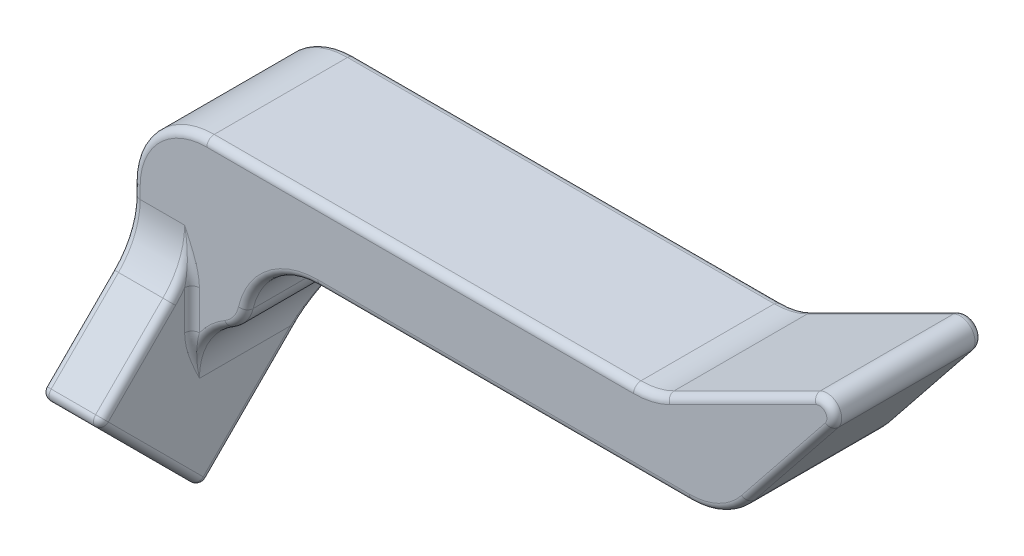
ISO-10303-21;
HEADER;
FILE_DESCRIPTION(('STEP AP214'),'2;1');
FILE_NAME('part.step','',(''),(''),'','','');
FILE_SCHEMA(('AUTOMOTIVE_DESIGN { 1 0 10303 214 1 1 1 1 }'));
ENDSEC;
DATA;
#1=APPLICATION_CONTEXT('core data for automotive mechanical design processes');
#2=APPLICATION_PROTOCOL_DEFINITION('international standard','automotive_design',2000,#1);
#3=PRODUCT_CONTEXT('',#1,'mechanical');
#4=PRODUCT('Part','Part','',(#3));
#5=PRODUCT_RELATED_PRODUCT_CATEGORY('part','',(#4));
#6=PRODUCT_DEFINITION_FORMATION('','',#4);
#7=PRODUCT_DEFINITION_CONTEXT('part definition',#1,'design');
#8=PRODUCT_DEFINITION('design','',#6,#7);
#9=PRODUCT_DEFINITION_SHAPE('','',#8);
#10=(LENGTH_UNIT() NAMED_UNIT(*) SI_UNIT(.MILLI.,.METRE.));
#11=(NAMED_UNIT(*) PLANE_ANGLE_UNIT() SI_UNIT($,.RADIAN.));
#12=(NAMED_UNIT(*) SI_UNIT($,.STERADIAN.) SOLID_ANGLE_UNIT());
#13=UNCERTAINTY_MEASURE_WITH_UNIT(LENGTH_MEASURE(1.E-05),#10,'distance_accuracy_value','');
#14=(GEOMETRIC_REPRESENTATION_CONTEXT(3) GLOBAL_UNCERTAINTY_ASSIGNED_CONTEXT((#13)) GLOBAL_UNIT_ASSIGNED_CONTEXT((#10,
#11,#12)) REPRESENTATION_CONTEXT('',''));
#15=CARTESIAN_POINT('',(0.,0.,0.));
#16=DIRECTION('',(0.,0.,1.));
#17=DIRECTION('',(1.,0.,0.));
#18=AXIS2_PLACEMENT_3D('',#15,#16,#17);
#19=CARTESIAN_POINT('',(-40.,-2.87311870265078,12.1157593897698));
#20=DIRECTION('',(0.,0.707106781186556,0.707106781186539));
#21=DIRECTION('',(0.,-0.707106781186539,0.707106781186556));
#22=AXIS2_PLACEMENT_3D('',#19,#20,#21);
#23=PLANE('',#22);
#24=DIRECTION('',(-1.,0.,0.));
#25=VECTOR('',#24,1.);
#26=CARTESIAN_POINT('',(-40.0000000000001,-22.7781745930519,32.0208152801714));
#27=LINE('',#26,#25);
#28=CARTESIAN_POINT('',(-39.0000000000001,-22.7781745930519,32.0208152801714));
#29=VERTEX_POINT('',#28);
#30=CARTESIAN_POINT('',(-33.0000000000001,-22.7781745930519,32.0208152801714));
#31=VERTEX_POINT('',#30);
#32=EDGE_CURVE('E56',#29,#31,#27,.F.);
#33=ORIENTED_EDGE('',*,*,#32,.T.);
#34=DIRECTION('',(0.,-0.707106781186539,0.707106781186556));
#35=VECTOR('',#34,1.);
#36=CARTESIAN_POINT('',(-33.0000000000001,-13.6862915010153,22.9289321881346));
#37=LINE('',#36,#35);
#38=CARTESIAN_POINT('',(-33.0000000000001,-13.6862915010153,22.9289321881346));
#39=VERTEX_POINT('',#38);
#40=EDGE_CURVE('E803',#31,#39,#37,.F.);
#41=ORIENTED_EDGE('',*,*,#40,.T.);
#42=DIRECTION('',(1.,0.,0.));
#43=VECTOR('',#42,1.);
#44=CARTESIAN_POINT('',(-40.,-13.6862915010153,22.9289321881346));
#45=LINE('',#44,#43);
#46=CARTESIAN_POINT('',(-39.0000000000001,-13.6862915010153,22.9289321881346));
#47=VERTEX_POINT('',#46);
#48=EDGE_CURVE('E386',#39,#47,#45,.F.);
#49=ORIENTED_EDGE('',*,*,#48,.T.);
#50=DIRECTION('',(0.,-0.707106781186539,0.707106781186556));
#51=VECTOR('',#50,1.);
#52=CARTESIAN_POINT('',(-39.0000000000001,-23.4852813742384,32.727922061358));
#53=LINE('',#52,#51);
#54=EDGE_CURVE('E61',#47,#29,#53,.T.);
#55=ORIENTED_EDGE('',*,*,#54,.T.);
#56=EDGE_LOOP('',(#33,#41,#49,#55));
#57=FACE_BOUND('',#56,.T.);
#58=ADVANCED_FACE('F39',(#57),#23,.T.);
#59=CARTESIAN_POINT('',(-40.,-17.1157593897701,-2.12688129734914));
#60=DIRECTION('',(0.,-0.707106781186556,-0.707106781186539));
#61=DIRECTION('',(0.,0.707106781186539,-0.707106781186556));
#62=AXIS2_PLACEMENT_3D('',#59,#60,#61);
#63=PLANE('',#62);
#64=DIRECTION('',(1.,0.,0.));
#65=VECTOR('',#64,1.);
#66=CARTESIAN_POINT('',(-40.0000000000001,-37.0208152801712,17.7781745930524));
#67=LINE('',#66,#65);
#68=CARTESIAN_POINT('',(-33.0000000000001,-37.0208152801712,17.7781745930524));
#69=VERTEX_POINT('',#68);
#70=CARTESIAN_POINT('',(-39.0000000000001,-37.0208152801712,17.7781745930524));
#71=VERTEX_POINT('',#70);
#72=EDGE_CURVE('E420',#69,#71,#67,.F.);
#73=ORIENTED_EDGE('',*,*,#72,.T.);
#74=DIRECTION('',(0.,-0.707106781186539,0.707106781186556));
#75=VECTOR('',#74,1.);
#76=CARTESIAN_POINT('',(-39.0000000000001,-22.1715728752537,2.92893218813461));
#77=LINE('',#76,#75);
#78=CARTESIAN_POINT('',(-39.0000000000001,-22.1715728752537,2.92893218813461));
#79=VERTEX_POINT('',#78);
#80=EDGE_CURVE('E424',#71,#79,#77,.F.);
#81=ORIENTED_EDGE('',*,*,#80,.T.);
#82=DIRECTION('',(1.,0.,0.));
#83=VECTOR('',#82,1.);
#84=CARTESIAN_POINT('',(-40.,-22.1715728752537,2.92893218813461));
#85=LINE('',#84,#83);
#86=CARTESIAN_POINT('',(-32.5614786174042,-22.1715728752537,2.92893218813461));
#87=VERTEX_POINT('',#86);
#88=EDGE_CURVE('E397',#79,#87,#85,.T.);
#89=ORIENTED_EDGE('',*,*,#88,.T.);
#90=CARTESIAN_POINT('',(-22.0000000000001,-25.246498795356,6.00385810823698));
#91=DIRECTION('',(0.,-0.707106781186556,-0.707106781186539));
#92=DIRECTION('',(0.,0.707106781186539,-0.707106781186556));
#93=AXIS2_PLACEMENT_3D('',#90,#91,#92);
#94=ELLIPSE('',#93,15.5563491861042,11.);
#95=CARTESIAN_POINT('',(-33.0000000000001,-25.246498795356,6.00385810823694));
#96=VERTEX_POINT('',#95);
#97=EDGE_CURVE('E422',#87,#96,#94,.F.);
#98=ORIENTED_EDGE('',*,*,#97,.T.);
#99=DIRECTION('',(0.,-0.707106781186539,0.707106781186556));
#100=VECTOR('',#99,1.);
#101=CARTESIAN_POINT('',(-33.0000000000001,-37.7279220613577,18.485281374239));
#102=LINE('',#101,#100);
#103=EDGE_CURVE('E418',#96,#69,#102,.T.);
#104=ORIENTED_EDGE('',*,*,#103,.T.);
#105=EDGE_LOOP('',(#73,#81,#89,#98,#104));
#106=FACE_BOUND('',#105,.T.);
#107=ADVANCED_FACE('F631',(#106),#63,.T.);
#108=CARTESIAN_POINT('',(0.,-28.1066017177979,28.1066017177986));
#109=DIRECTION('',(0.,-0.707106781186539,0.707106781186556));
#110=DIRECTION('',(0.,-0.707106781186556,-0.707106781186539));
#111=AXIS2_PLACEMENT_3D('',#108,#109,#110);
#112=PLANE('',#111);
#113=DIRECTION('',(0.,0.707106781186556,0.707106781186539));
#114=VECTOR('',#113,1.);
#115=CARTESIAN_POINT('',(-33.0000000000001,-23.4852813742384,32.727922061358));
#116=LINE('',#115,#114);
#117=CARTESIAN_POINT('',(-33.0000000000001,-37.0208152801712,19.1923881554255));
#118=VERTEX_POINT('',#117);
#119=CARTESIAN_POINT('',(-33.0000000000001,-24.192388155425,32.0208152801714));
#120=VERTEX_POINT('',#119);
#121=EDGE_CURVE('E917',#118,#120,#116,.T.);
#122=ORIENTED_EDGE('',*,*,#121,.T.);
#123=DIRECTION('',(-1.,0.,0.));
#124=VECTOR('',#123,1.);
#125=CARTESIAN_POINT('',(0.,-24.192388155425,32.0208152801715));
#126=LINE('',#125,#124);
#127=CARTESIAN_POINT('',(-39.0000000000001,-24.192388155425,32.0208152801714));
#128=VERTEX_POINT('',#127);
#129=EDGE_CURVE('E919',#120,#128,#126,.T.);
#130=ORIENTED_EDGE('',*,*,#129,.T.);
#131=DIRECTION('',(0.,-0.707106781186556,-0.707106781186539));
#132=VECTOR('',#131,1.);
#133=CARTESIAN_POINT('',(-39.0000000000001,-37.7279220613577,18.485281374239));
#134=LINE('',#133,#132);
#135=CARTESIAN_POINT('',(-39.0000000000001,-37.0208152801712,19.1923881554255));
#136=VERTEX_POINT('',#135);
#137=EDGE_CURVE('E913',#128,#136,#134,.T.);
#138=ORIENTED_EDGE('',*,*,#137,.T.);
#139=DIRECTION('',(1.,0.,0.));
#140=VECTOR('',#139,1.);
#141=CARTESIAN_POINT('',(0.,-37.0208152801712,19.1923881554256));
#142=LINE('',#141,#140);
#143=EDGE_CURVE('E915',#136,#118,#142,.T.);
#144=ORIENTED_EDGE('',*,*,#143,.T.);
#145=EDGE_LOOP('',(#122,#130,#138,#144));
#146=FACE_BOUND('',#145,.T.);
#147=DIRECTION('',(0.,-0.707106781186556,-0.707106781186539));
#148=VECTOR('',#147,1.);
#149=CARTESIAN_POINT('',(-37.5500000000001,-25.5358910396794,30.677312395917));
#150=LINE('',#149,#148);
#151=CARTESIAN_POINT('',(-37.5500000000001,-25.5358910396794,30.677312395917));
#152=VERTEX_POINT('',#151);
#153=CARTESIAN_POINT('',(-37.5500000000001,-35.6773123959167,20.5358910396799));
#154=VERTEX_POINT('',#153);
#155=EDGE_CURVE('E321',#152,#154,#150,.T.);
#156=ORIENTED_EDGE('',*,*,#155,.F.);
#157=DIRECTION('',(-1.,0.,0.));
#158=VECTOR('',#157,1.);
#159=CARTESIAN_POINT('',(-37.5500000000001,-25.5358910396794,30.677312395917));
#160=LINE('',#159,#158);
#161=CARTESIAN_POINT('',(-34.4500000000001,-25.5358910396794,30.677312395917));
#162=VERTEX_POINT('',#161);
#163=EDGE_CURVE('E338',#162,#152,#160,.T.);
#164=ORIENTED_EDGE('',*,*,#163,.F.);
#165=DIRECTION('',(0.,0.707106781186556,0.707106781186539));
#166=VECTOR('',#165,1.);
#167=CARTESIAN_POINT('',(-34.4500000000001,-25.5358910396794,30.677312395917));
#168=LINE('',#167,#166);
#169=CARTESIAN_POINT('',(-34.4500000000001,-35.6773123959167,20.5358910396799));
#170=VERTEX_POINT('',#169);
#171=EDGE_CURVE('E341',#170,#162,#168,.T.);
#172=ORIENTED_EDGE('',*,*,#171,.F.);
#173=DIRECTION('',(1.,0.,0.));
#174=VECTOR('',#173,1.);
#175=CARTESIAN_POINT('',(-37.5500000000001,-35.6773123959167,20.5358910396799));
#176=LINE('',#175,#174);
#177=EDGE_CURVE('E347',#154,#170,#176,.T.);
#178=ORIENTED_EDGE('',*,*,#177,.F.);
#179=EDGE_LOOP('',(#156,#164,#172,#178));
#180=FACE_BOUND('',#179,.T.);
#181=ADVANCED_FACE('F636',(#146,#180),#112,.T.);
#182=CARTESIAN_POINT('',(-28.7867965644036,-5.,20.));
#183=DIRECTION('',(0.,1.,0.));
#184=DIRECTION('',(0.,0.,1.));
#185=AXIS2_PLACEMENT_3D('',#182,#183,#184);
#186=PLANE('',#185);
#187=DIRECTION('',(0.,0.,1.));
#188=VECTOR('',#187,1.);
#189=CARTESIAN_POINT('',(-15.,-5.,0.));
#190=LINE('',#189,#188);
#191=CARTESIAN_POINT('',(-15.,-5.,19.));
#192=VERTEX_POINT('',#191);
#193=CARTESIAN_POINT('',(-15.,-5.,1.));
#194=VERTEX_POINT('',#193);
#195=EDGE_CURVE('E380',#192,#194,#190,.F.);
#196=ORIENTED_EDGE('',*,*,#195,.T.);
#197=DIRECTION('',(1.,0.,0.));
#198=VECTOR('',#197,1.);
#199=CARTESIAN_POINT('',(35.1937515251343,-5.,1.));
#200=LINE('',#199,#198);
#201=CARTESIAN_POINT('',(35.1937515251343,-5.,1.));
#202=VERTEX_POINT('',#201);
#203=EDGE_CURVE('E766',#194,#202,#200,.T.);
#204=ORIENTED_EDGE('',*,*,#203,.T.);
#205=DIRECTION('',(0.,0.,-1.));
#206=VECTOR('',#205,1.);
#207=CARTESIAN_POINT('',(35.1937515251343,-5.,20.));
#208=LINE('',#207,#206);
#209=CARTESIAN_POINT('',(35.1937515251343,-5.,19.));
#210=VERTEX_POINT('',#209);
#211=EDGE_CURVE('E383',#202,#210,#208,.F.);
#212=ORIENTED_EDGE('',*,*,#211,.T.);
#213=DIRECTION('',(1.,0.,0.));
#214=VECTOR('',#213,1.);
#215=CARTESIAN_POINT('',(-28.7867965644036,-5.,19.));
#216=LINE('',#215,#214);
#217=EDGE_CURVE('E763',#210,#192,#216,.F.);
#218=ORIENTED_EDGE('',*,*,#217,.T.);
#219=EDGE_LOOP('',(#196,#204,#212,#218));
#220=FACE_BOUND('',#219,.T.);
#221=ADVANCED_FACE('F1011',(#220),#186,.F.);
#222=CARTESIAN_POINT('',(40.,-5.,20.));
#223=DIRECTION('',(-0.78086880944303,0.624695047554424,0.));
#224=DIRECTION('',(-0.624695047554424,-0.78086880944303,0.));
#225=AXIS2_PLACEMENT_3D('',#222,#223,#224);
#226=PLANE('',#225);
#227=DIRECTION('',(0.,0.,-1.));
#228=VECTOR('',#227,1.);
#229=CARTESIAN_POINT('',(43.0024396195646,-1.24695047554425,20.));
#230=LINE('',#229,#228);
#231=CARTESIAN_POINT('',(43.0024396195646,-1.24695047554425,19.));
#232=VERTEX_POINT('',#231);
#233=CARTESIAN_POINT('',(43.0024396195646,-1.24695047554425,1.));
#234=VERTEX_POINT('',#233);
#235=EDGE_CURVE('E377',#232,#234,#230,.T.);
#236=ORIENTED_EDGE('',*,*,#235,.T.);
#237=DIRECTION('',(0.624695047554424,0.78086880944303,0.));
#238=VECTOR('',#237,1.);
#239=CARTESIAN_POINT('',(54.3115641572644,12.8894551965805,1.));
#240=LINE('',#239,#238);
#241=CARTESIAN_POINT('',(54.3115641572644,12.8894551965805,1.));
#242=VERTEX_POINT('',#241);
#243=EDGE_CURVE('E1006',#234,#242,#240,.T.);
#244=ORIENTED_EDGE('',*,*,#243,.T.);
#245=DIRECTION('',(0.,0.,-1.));
#246=VECTOR('',#245,1.);
#247=CARTESIAN_POINT('',(54.3115641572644,12.8894551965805,20.));
#248=LINE('',#247,#246);
#249=CARTESIAN_POINT('',(54.3115641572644,12.8894551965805,19.));
#250=VERTEX_POINT('',#249);
#251=EDGE_CURVE('E359',#242,#250,#248,.F.);
#252=ORIENTED_EDGE('',*,*,#251,.T.);
#253=DIRECTION('',(0.624695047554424,0.78086880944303,0.));
#254=VECTOR('',#253,1.);
#255=CARTESIAN_POINT('',(40.,-5.,19.));
#256=LINE('',#255,#254);
#257=EDGE_CURVE('E1004',#250,#232,#256,.F.);
#258=ORIENTED_EDGE('',*,*,#257,.T.);
#259=EDGE_LOOP('',(#236,#244,#252,#258));
#260=FACE_BOUND('',#259,.T.);
#261=ADVANCED_FACE('F1040',(#260),#226,.F.);
#262=CARTESIAN_POINT('',(52.7498265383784,14.1388452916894,20.));
#263=DIRECTION('',(0.,0.,-1.));
#264=DIRECTION('',(-1.,0.,0.));
#265=AXIS2_PLACEMENT_3D('',#262,#263,#264);
#266=CYLINDRICAL_SURFACE('',#265,2.);
#267=ORIENTED_EDGE('',*,*,#251,.F.);
#268=CARTESIAN_POINT('',(52.7498265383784,14.1388452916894,0.999999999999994));
#269=DIRECTION('',(0.,0.,-1.));
#270=DIRECTION('',(-1.,0.,0.));
#271=AXIS2_PLACEMENT_3D('',#268,#269,#270);
#272=CIRCLE('',#271,2.);
#273=CARTESIAN_POINT('',(51.8553993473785,15.9276996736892,0.999999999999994));
#274=VERTEX_POINT('',#273);
#275=EDGE_CURVE('E1002',#242,#274,#272,.F.);
#276=ORIENTED_EDGE('',*,*,#275,.T.);
#277=DIRECTION('',(0.,0.,-1.));
#278=VECTOR('',#277,1.);
#279=CARTESIAN_POINT('',(51.8553993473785,15.9276996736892,20.));
#280=LINE('',#279,#278);
#281=CARTESIAN_POINT('',(51.8553993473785,15.9276996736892,19.));
#282=VERTEX_POINT('',#281);
#283=EDGE_CURVE('E353',#282,#274,#280,.T.);
#284=ORIENTED_EDGE('',*,*,#283,.F.);
#285=CARTESIAN_POINT('',(52.7498265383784,14.1388452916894,19.));
#286=DIRECTION('',(0.,0.,-1.));
#287=DIRECTION('',(-1.,0.,0.));
#288=AXIS2_PLACEMENT_3D('',#285,#286,#287);
#289=CIRCLE('',#288,2.);
#290=EDGE_CURVE('E1000',#282,#250,#289,.T.);
#291=ORIENTED_EDGE('',*,*,#290,.T.);
#292=EDGE_LOOP('',(#267,#276,#284,#291));
#293=FACE_BOUND('',#292,.T.);
#294=ADVANCED_FACE('F1313',(#293),#266,.T.);
#295=CARTESIAN_POINT('',(60.,20.,20.));
#296=DIRECTION('',(0.447213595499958,-0.894427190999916,0.));
#297=DIRECTION('',(0.894427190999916,0.447213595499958,0.));
#298=AXIS2_PLACEMENT_3D('',#295,#296,#297);
#299=PLANE('',#298);
#300=ORIENTED_EDGE('',*,*,#283,.T.);
#301=DIRECTION('',(-0.894427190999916,-0.447213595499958,0.));
#302=VECTOR('',#301,1.);
#303=CARTESIAN_POINT('',(32.1114561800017,6.05572809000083,1.));
#304=LINE('',#303,#302);
#305=CARTESIAN_POINT('',(32.1114561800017,6.05572809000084,1.));
#306=VERTEX_POINT('',#305);
#307=EDGE_CURVE('E998',#274,#306,#304,.T.);
#308=ORIENTED_EDGE('',*,*,#307,.T.);
#309=DIRECTION('',(0.,0.,-1.));
#310=VECTOR('',#309,1.);
#311=CARTESIAN_POINT('',(32.1114561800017,6.05572809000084,20.));
#312=LINE('',#311,#310);
#313=CARTESIAN_POINT('',(32.1114561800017,6.05572809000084,19.));
#314=VERTEX_POINT('',#313);
#315=EDGE_CURVE('E374',#306,#314,#312,.F.);
#316=ORIENTED_EDGE('',*,*,#315,.T.);
#317=DIRECTION('',(-0.894427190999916,-0.447213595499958,0.));
#318=VECTOR('',#317,1.);
#319=CARTESIAN_POINT('',(60.,20.,19.));
#320=LINE('',#319,#318);
#321=EDGE_CURVE('E996',#314,#282,#320,.F.);
#322=ORIENTED_EDGE('',*,*,#321,.T.);
#323=EDGE_LOOP('',(#300,#308,#316,#322));
#324=FACE_BOUND('',#323,.T.);
#325=ADVANCED_FACE('F1303',(#324),#299,.F.);
#326=CARTESIAN_POINT('',(-40.,5.,20.));
#327=DIRECTION('',(0.,-1.,0.));
#328=DIRECTION('',(0.,0.,-1.));
#329=AXIS2_PLACEMENT_3D('',#326,#327,#328);
#330=PLANE('',#329);
#331=DIRECTION('',(0.,0.,-1.));
#332=VECTOR('',#331,1.);
#333=CARTESIAN_POINT('',(27.6393202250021,5.,0.));
#334=LINE('',#333,#332);
#335=CARTESIAN_POINT('',(27.6393202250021,5.,19.));
#336=VERTEX_POINT('',#335);
#337=CARTESIAN_POINT('',(27.6393202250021,5.,1.));
#338=VERTEX_POINT('',#337);
#339=EDGE_CURVE('E365',#336,#338,#334,.T.);
#340=ORIENTED_EDGE('',*,*,#339,.T.);
#341=DIRECTION('',(-1.,0.,0.));
#342=VECTOR('',#341,1.);
#343=CARTESIAN_POINT('',(-30.,5.,1.));
#344=LINE('',#343,#342);
#345=CARTESIAN_POINT('',(-30.,5.,1.));
#346=VERTEX_POINT('',#345);
#347=EDGE_CURVE('E990',#338,#346,#344,.T.);
#348=ORIENTED_EDGE('',*,*,#347,.T.);
#349=DIRECTION('',(0.,0.,-1.));
#350=VECTOR('',#349,1.);
#351=CARTESIAN_POINT('',(-30.,5.,20.));
#352=LINE('',#351,#350);
#353=CARTESIAN_POINT('',(-30.,5.,19.));
#354=VERTEX_POINT('',#353);
#355=EDGE_CURVE('E368',#346,#354,#352,.F.);
#356=ORIENTED_EDGE('',*,*,#355,.T.);
#357=DIRECTION('',(-1.,0.,0.));
#358=VECTOR('',#357,1.);
#359=CARTESIAN_POINT('',(-40.,5.,19.));
#360=LINE('',#359,#358);
#361=EDGE_CURVE('E988',#354,#336,#360,.F.);
#362=ORIENTED_EDGE('',*,*,#361,.T.);
#363=EDGE_LOOP('',(#340,#348,#356,#362));
#364=FACE_BOUND('',#363,.T.);
#365=ADVANCED_FACE('F1293',(#364),#330,.F.);
#366=CARTESIAN_POINT('',(0.,0.,0.));
#367=DIRECTION('',(0.,0.,-1.));
#368=DIRECTION('',(-1.,0.,0.));
#369=AXIS2_PLACEMENT_3D('',#366,#367,#368);
#370=PLANE('',#369);
#371=DIRECTION('',(1.,0.,0.));
#372=VECTOR('',#371,1.);
#373=CARTESIAN_POINT('',(0.,-15.1005050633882,0.));
#374=LINE('',#373,#372);
#375=CARTESIAN_POINT('',(-27.648664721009,-15.1005050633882,0.));
#376=VERTEX_POINT('',#375);
#377=CARTESIAN_POINT('',(-39.0000000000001,-15.1005050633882,0.));
#378=VERTEX_POINT('',#377);
#379=EDGE_CURVE('E400',#376,#378,#374,.F.);
#380=ORIENTED_EDGE('',*,*,#379,.T.);
#381=DIRECTION('',(0.,-1.,0.));
#382=VECTOR('',#381,1.);
#383=CARTESIAN_POINT('',(-39.,-4.99999999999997,0.));
#384=LINE('',#383,#382);
#385=CARTESIAN_POINT('',(-39.,-4.99999999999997,0.));
#386=VERTEX_POINT('',#385);
#387=EDGE_CURVE('E955',#378,#386,#384,.F.);
#388=ORIENTED_EDGE('',*,*,#387,.T.);
#389=CARTESIAN_POINT('',(-30.,-5.,0.));
#390=DIRECTION('',(0.,0.,-1.));
#391=DIRECTION('',(-1.,0.,0.));
#392=AXIS2_PLACEMENT_3D('',#389,#390,#391);
#393=CIRCLE('',#392,9.);
#394=CARTESIAN_POINT('',(-30.,4.,0.));
#395=VERTEX_POINT('',#394);
#396=EDGE_CURVE('E965',#386,#395,#393,.T.);
#397=ORIENTED_EDGE('',*,*,#396,.T.);
#398=DIRECTION('',(-1.,0.,0.));
#399=VECTOR('',#398,1.);
#400=CARTESIAN_POINT('',(27.6393202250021,4.,0.));
#401=LINE('',#400,#399);
#402=CARTESIAN_POINT('',(27.6393202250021,4.,0.));
#403=VERTEX_POINT('',#402);
#404=EDGE_CURVE('E980',#395,#403,#401,.F.);
#405=ORIENTED_EDGE('',*,*,#404,.T.);
#406=CARTESIAN_POINT('',(27.6393202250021,15.,0.));
#407=DIRECTION('',(0.,0.,-1.));
#408=DIRECTION('',(-1.,0.,0.));
#409=AXIS2_PLACEMENT_3D('',#406,#407,#408);
#410=CIRCLE('',#409,11.);
#411=CARTESIAN_POINT('',(32.5586697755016,5.16130089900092,0.));
#412=VERTEX_POINT('',#411);
#413=EDGE_CURVE('E982',#403,#412,#410,.F.);
#414=ORIENTED_EDGE('',*,*,#413,.T.);
#415=DIRECTION('',(-0.894427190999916,-0.447213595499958,0.));
#416=VECTOR('',#415,1.);
#417=CARTESIAN_POINT('',(52.3026129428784,15.0332724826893,0.));
#418=LINE('',#417,#416);
#419=CARTESIAN_POINT('',(52.3026129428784,15.0332724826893,0.));
#420=VERTEX_POINT('',#419);
#421=EDGE_CURVE('E1032',#412,#420,#418,.F.);
#422=ORIENTED_EDGE('',*,*,#421,.T.);
#423=CARTESIAN_POINT('',(52.7498265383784,14.1388452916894,0.));
#424=DIRECTION('',(0.,0.,-1.));
#425=DIRECTION('',(-1.,0.,0.));
#426=AXIS2_PLACEMENT_3D('',#423,#424,#425);
#427=CIRCLE('',#426,1.);
#428=CARTESIAN_POINT('',(53.5306953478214,13.514150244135,0.));
#429=VERTEX_POINT('',#428);
#430=EDGE_CURVE('E1030',#420,#429,#427,.T.);
#431=ORIENTED_EDGE('',*,*,#430,.T.);
#432=DIRECTION('',(0.624695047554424,0.78086880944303,0.));
#433=VECTOR('',#432,1.);
#434=CARTESIAN_POINT('',(42.2215708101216,-0.62225542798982,0.));
#435=LINE('',#434,#433);
#436=CARTESIAN_POINT('',(42.2215708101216,-0.622255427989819,0.));
#437=VERTEX_POINT('',#436);
#438=EDGE_CURVE('E1028',#429,#437,#435,.F.);
#439=ORIENTED_EDGE('',*,*,#438,.T.);
#440=CARTESIAN_POINT('',(35.1937515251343,5.,0.));
#441=DIRECTION('',(0.,0.,-1.));
#442=DIRECTION('',(-1.,0.,0.));
#443=AXIS2_PLACEMENT_3D('',#440,#441,#442);
#444=CIRCLE('',#443,9.);
#445=CARTESIAN_POINT('',(35.1937515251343,-4.,0.));
#446=VERTEX_POINT('',#445);
#447=EDGE_CURVE('E1023',#437,#446,#444,.T.);
#448=ORIENTED_EDGE('',*,*,#447,.T.);
#449=DIRECTION('',(1.,0.,0.));
#450=VECTOR('',#449,1.);
#451=CARTESIAN_POINT('',(-15.,-4.,0.));
#452=LINE('',#451,#450);
#453=CARTESIAN_POINT('',(-15.,-4.,0.));
#454=VERTEX_POINT('',#453);
#455=EDGE_CURVE('E1020',#446,#454,#452,.F.);
#456=ORIENTED_EDGE('',*,*,#455,.T.);
#457=CARTESIAN_POINT('',(-15.,-15.,0.));
#458=DIRECTION('',(0.,0.,-1.));
#459=DIRECTION('',(-1.,0.,0.));
#460=AXIS2_PLACEMENT_3D('',#457,#458,#459);
#461=CIRCLE('',#460,11.);
#462=CARTESIAN_POINT('',(-25.7162406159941,-12.5176247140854,0.));
#463=VERTEX_POINT('',#462);
#464=EDGE_CURVE('E1018',#454,#463,#461,.F.);
#465=ORIENTED_EDGE('',*,*,#464,.T.);
#466=CARTESIAN_POINT('',(-29.6130553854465,-11.6149427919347,0.));
#467=DIRECTION('',(0.,0.,-1.));
#468=DIRECTION('',(-1.,0.,0.));
#469=AXIS2_PLACEMENT_3D('',#466,#467,#468);
#470=CIRCLE('',#469,4.);
#471=CARTESIAN_POINT('',(-27.5829072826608,-15.0614625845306,0.));
#472=VERTEX_POINT('',#471);
#473=EDGE_CURVE('E1021',#463,#472,#470,.T.);
#474=ORIENTED_EDGE('',*,*,#473,.T.);
#475=CARTESIAN_POINT('',(-22.0000000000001,-24.5393920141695,0.));
#476=DIRECTION('',(0.,0.,-1.));
#477=DIRECTION('',(-1.,0.,0.));
#478=AXIS2_PLACEMENT_3D('',#475,#476,#477);
#479=CIRCLE('',#478,11.);
#480=EDGE_CURVE('E957',#472,#376,#479,.F.);
#481=ORIENTED_EDGE('',*,*,#480,.T.);
#482=EDGE_LOOP('',(#380,#388,#397,#405,#414,#422,#431,#439,#448,#456,#465,#474,#481));
#483=FACE_BOUND('',#482,.T.);
#484=ADVANCED_FACE('F954',(#483),#370,.T.);
#485=CARTESIAN_POINT('',(0.,0.,20.));
#486=DIRECTION('',(0.,0.,-1.));
#487=DIRECTION('',(-1.,0.,0.));
#488=AXIS2_PLACEMENT_3D('',#485,#486,#487);
#489=PLANE('',#488);
#490=DIRECTION('',(1.,0.,0.));
#491=VECTOR('',#490,1.);
#492=CARTESIAN_POINT('',(0.,-6.61522368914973,20.));
#493=LINE('',#492,#491);
#494=CARTESIAN_POINT('',(-39.,-6.61522368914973,20.));
#495=VERTEX_POINT('',#494);
#496=CARTESIAN_POINT('',(-33.,-6.61522368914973,20.));
#497=VERTEX_POINT('',#496);
#498=EDGE_CURVE('E371',#495,#497,#493,.T.);
#499=ORIENTED_EDGE('',*,*,#498,.T.);
#500=CARTESIAN_POINT('',(-32.1489946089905,-14.2791274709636,21.3922231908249));
#501=CARTESIAN_POINT('',(-32.6981831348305,-14.0537650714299,20.));
#502=CARTESIAN_POINT('',(-31.2979892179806,-14.6283420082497,20.));
#503=CARTESIAN_POINT('',(-32.1278735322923,-14.2013890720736,21.3688727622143));
#504=CARTESIAN_POINT('',(-32.637910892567,-14.0152577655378,20.));
#505=CARTESIAN_POINT('',(-31.2557470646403,-14.5253102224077,20.));
#506=CARTESIAN_POINT('',(-32.1093810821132,-14.1214393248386,21.3449084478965));
#507=CARTESIAN_POINT('',(-32.5783875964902,-13.9670478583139,20.));
#508=CARTESIAN_POINT('',(-31.2187621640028,-14.4202602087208,20.));
#509=CARTESIAN_POINT('',(-32.0772016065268,-13.9579517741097,21.2960866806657));
#510=CARTESIAN_POINT('',(-32.4655472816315,-13.8557244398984,20.));
#511=CARTESIAN_POINT('',(-31.1544032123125,-14.2074399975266,20.));
#512=CARTESIAN_POINT('',(-32.0635061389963,-13.8744205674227,21.271230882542));
#513=CARTESIAN_POINT('',(-32.4119817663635,-13.7931295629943,20.));
#514=CARTESIAN_POINT('',(-31.127012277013,-14.0996749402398,20.));
#515=CARTESIAN_POINT('',(-32.0404727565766,-13.7048788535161,21.2210401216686));
#516=CARTESIAN_POINT('',(-32.3126974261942,-13.6567140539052,20.));
#517=CARTESIAN_POINT('',(-31.0809455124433,-13.8830762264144,20.));
#518=CARTESIAN_POINT('',(-32.0311070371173,-13.6188880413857,21.1957093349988));
#519=CARTESIAN_POINT('',(-32.2666616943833,-13.5833008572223,20.));
#520=CARTESIAN_POINT('',(-31.0622140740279,-13.7742541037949,20.));
#521=CARTESIAN_POINT('',(-32.0161774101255,-13.4443290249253,21.1446322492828));
#522=CARTESIAN_POINT('',(-32.1823580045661,-13.4276428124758,20.));
#523=CARTESIAN_POINT('',(-31.0323548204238,-13.5555517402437,20.));
#524=CARTESIAN_POINT('',(-32.0106147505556,-13.3557599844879,21.1188858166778));
#525=CARTESIAN_POINT('',(-32.1438215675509,-13.3455871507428,20.));
#526=CARTESIAN_POINT('',(-31.0212295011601,-13.4456711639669,20.));
#527=CARTESIAN_POINT('',(-32.0021581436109,-13.1588306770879,21.0621204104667));
#528=CARTESIAN_POINT('',(-32.0678792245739,-13.1585360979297,20.));
#529=CARTESIAN_POINT('',(-31.004316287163,-13.2038542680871,20.));
#530=CARTESIAN_POINT('',(-32.0000013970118,-13.0499951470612,21.0310575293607));
#531=CARTESIAN_POINT('',(-32.0315369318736,-13.0517338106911,20.));
#532=CARTESIAN_POINT('',(-31.0000027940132,-13.0718180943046,20.));
#533=CARTESIAN_POINT('',(-31.9999976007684,-12.7504935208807,20.9466617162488));
#534=CARTESIAN_POINT('',(-31.9480645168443,-12.7554101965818,20.));
#535=CARTESIAN_POINT('',(-30.9999952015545,-12.7130147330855,20.));
#536=CARTESIAN_POINT('',(-32.0063523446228,-12.557135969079,20.8933392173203));
#537=CARTESIAN_POINT('',(-31.9088916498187,-12.5560464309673,20.));
#538=CARTESIAN_POINT('',(-31.0127046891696,-12.4862418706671,20.));
#539=CARTESIAN_POINT('',(-32.0293166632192,-12.1635798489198,20.7881043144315));
#540=CARTESIAN_POINT('',(-31.8580434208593,-12.1465104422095,20.));
#541=CARTESIAN_POINT('',(-31.0586333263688,-12.0346601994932,20.));
#542=CARTESIAN_POINT('',(-32.0459401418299,-11.9633723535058,20.736193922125));
#543=CARTESIAN_POINT('',(-31.8450975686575,-11.9359127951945,20.));
#544=CARTESIAN_POINT('',(-31.0918802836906,-11.8098544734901,20.));
#545=CARTESIAN_POINT('',(-32.0875654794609,-11.5562434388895,20.6348892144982));
#546=CARTESIAN_POINT('',(-31.8419465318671,-11.5088318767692,20.));
#547=CARTESIAN_POINT('',(-31.1751309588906,-11.3623964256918,20.));
#548=CARTESIAN_POINT('',(-32.1126044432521,-11.3492960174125,20.5855071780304));
#549=CARTESIAN_POINT('',(-31.8509839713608,-11.2915829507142,20.));
#550=CARTESIAN_POINT('',(-31.2252088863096,-11.1397582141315,20.));
#551=CARTESIAN_POINT('',(-32.1694095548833,-10.9301146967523,20.4907008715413));
#552=CARTESIAN_POINT('',(-31.8876265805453,-10.8553305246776,20.));
#553=CARTESIAN_POINT('',(-31.3388191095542,-10.6979144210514,20.));
#554=CARTESIAN_POINT('',(-32.2011784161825,-10.7178786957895,20.4452782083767));
#555=CARTESIAN_POINT('',(-31.9147318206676,-10.6354671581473,20.));
#556=CARTESIAN_POINT('',(-31.4023568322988,-10.4787102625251,20.));
#557=CARTESIAN_POINT('',(-32.2851820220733,-10.194507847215,20.3407180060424));
#558=CARTESIAN_POINT('',(-31.9983987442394,-10.1025229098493,20.));
#559=CARTESIAN_POINT('',(-31.5703640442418,-9.94821406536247,20.));
#560=CARTESIAN_POINT('',(-32.3402781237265,-9.88086626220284,20.2843157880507));
#561=CARTESIAN_POINT('',(-32.0627849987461,-9.78409238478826,20.));
#562=CARTESIAN_POINT('',(-31.6805562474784,-9.63874932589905,20.));
#563=CARTESIAN_POINT('',(-32.458151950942,-9.24567893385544,20.1850897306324));
#564=CARTESIAN_POINT('',(-32.2126309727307,-9.15103011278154,20.));
#565=CARTESIAN_POINT('',(-31.9163039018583,-9.02572417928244,20.));
#566=CARTESIAN_POINT('',(-32.5209329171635,-8.9241299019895,20.1422716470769));
#567=CARTESIAN_POINT('',(-32.2981714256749,-8.83355139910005,20.));
#568=CARTESIAN_POINT('',(-32.0418658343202,-8.72216632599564,20.));
#569=CARTESIAN_POINT('',(-32.6512470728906,-8.27596849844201,20.0726678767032));
#570=CARTESIAN_POINT('',(-32.481913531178,-8.20343357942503,20.));
#571=CARTESIAN_POINT('',(-32.3024941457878,-8.11977966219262,20.));
#572=CARTESIAN_POINT('',(-32.7187726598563,-7.94936485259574,20.0458571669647));
#573=CARTESIAN_POINT('',(-32.5806657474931,-7.88796003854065,20.));
#574=CARTESIAN_POINT('',(-32.4375453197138,-7.82094418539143,20.));
#575=CARTESIAN_POINT('',(-32.8561770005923,-7.29328194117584,20.0097026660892));
#576=CARTESIAN_POINT('',(-32.7838212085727,-7.26085494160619,20.));
#577=CARTESIAN_POINT('',(-32.7123540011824,-7.22552756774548,20.));
#578=CARTESIAN_POINT('',(-32.9260554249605,-6.96380308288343,20.0003564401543));
#579=CARTESIAN_POINT('',(-32.8890747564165,-6.94640196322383,20.));
#580=CARTESIAN_POINT('',(-32.8521108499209,-6.92894611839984,20.));
#581=CARTESIAN_POINT('',(-32.9973032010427,-6.62793652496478,20.0000033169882));
#582=CARTESIAN_POINT('',(-32.9959547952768,-6.62730089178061,20.));
#583=CARTESIAN_POINT('',(-32.9946064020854,-6.62666524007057,20.));
#584=CARTESIAN_POINT('',(-32.9986516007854,-6.62158010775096,19.9999999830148));
#585=CARTESIAN_POINT('',(-32.9979773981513,-6.62126228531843,20.));
#586=CARTESIAN_POINT('',(-32.9973032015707,-6.62094446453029,20.));
#587=CARTESIAN_POINT('',(-33.,-6.61522368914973,20.));
#588=CARTESIAN_POINT('',(-33.,-6.61522368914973,20.));
#589=CARTESIAN_POINT('',(-33.,-6.61522368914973,20.));
#590=(BOUNDED_SURFACE() B_SPLINE_SURFACE(3,2,((#500,#501,#502),(#503,#504,#505),(#506,#507,
#508),(#509,#510,#511),(#512,#513,#514),(#515,#516,#517),(#518,#519,#520),(#521,#522,#523),
(#524,#525,#526),(#527,#528,#529),(#530,#531,#532),(#533,#534,#535),(#536,#537,#538),(#539,#540,
#541),(#542,#543,#544),(#545,#546,#547),(#548,#549,#550),(#551,#552,#553),(#554,#555,#556),
(#557,#558,#559),(#560,#561,#562),(#563,#564,#565),(#566,#567,#568),(#569,#570,#571),(#572,#573,
#574),(#575,#576,#577),(#578,#579,#580),(#581,#582,#583),(#584,#585,#586),(#587,#588,#589)),
.UNSPECIFIED.,.F.,.F.,.F.) B_SPLINE_SURFACE_WITH_KNOTS((4,2,2,2,2,2,2,2,2,2,2,2,2,2,4),(3,3),
(0.,0.333739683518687,0.666889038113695,0.997868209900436,1.32895593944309,1.72496676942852,
2.40507682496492,3.08610977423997,3.77018574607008,4.45453806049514,5.43937989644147,
6.42463847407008,7.40835282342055,8.39193001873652,8.41090368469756),(0.,1.),
.UNSPECIFIED.) GEOMETRIC_REPRESENTATION_ITEM() RATIONAL_B_SPLINE_SURFACE(((1.,0.551260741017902,
1.),(1.,0.561854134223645,1.),(1.,0.572413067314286,1.),(1.,0.593350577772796,1.),(1.,
0.603729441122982,1.),(1.,0.624166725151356,1.),(1.,0.634226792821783,1.),(1.,0.654050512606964,
1.),(1.,0.663814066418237,1.),(1.,0.684888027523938,1.),(1.,0.696126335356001,1.),(1.,
0.725964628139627,1.),(1.,0.744061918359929,1.),(1.,0.778618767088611,1.),(1.,0.79507606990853,
1.),(1.,0.826317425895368,1.),(1.,0.841093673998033,1.),(1.,0.868816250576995,1.),(1.,
0.881761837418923,1.),(1.,0.91101036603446,1.),(1.,0.926291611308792,1.),(1.,0.952696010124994,
1.),(1.,0.963817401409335,1.),(1.,0.981705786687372,1.),(1.,0.988479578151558,1.),(1.,
0.997581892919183,1.),(1.,0.999911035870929,1.),(1.,0.999999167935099,1.),(1.,1.00000000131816,
1.),(1.,1.,1.))) REPRESENTATION_ITEM('') SURFACE());
#591=CARTESIAN_POINT('',(-31.2979892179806,-14.6283420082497,20.));
#592=CARTESIAN_POINT('',(-31.2557470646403,-14.5253102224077,20.));
#593=CARTESIAN_POINT('',(-31.2187621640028,-14.4202602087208,20.));
#594=CARTESIAN_POINT('',(-31.1544032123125,-14.2074399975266,20.));
#595=CARTESIAN_POINT('',(-31.127012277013,-14.0996749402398,20.));
#596=CARTESIAN_POINT('',(-31.0809455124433,-13.8830762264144,20.));
#597=CARTESIAN_POINT('',(-31.0622140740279,-13.7742541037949,20.));
#598=CARTESIAN_POINT('',(-31.0323548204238,-13.5555517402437,20.));
#599=CARTESIAN_POINT('',(-31.0212295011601,-13.4456711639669,20.));
#600=CARTESIAN_POINT('',(-31.004316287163,-13.2038542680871,20.));
#601=CARTESIAN_POINT('',(-31.0000027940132,-13.0718180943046,20.));
#602=CARTESIAN_POINT('',(-30.9999952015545,-12.7130147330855,20.));
#603=CARTESIAN_POINT('',(-31.0127046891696,-12.4862418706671,20.));
#604=CARTESIAN_POINT('',(-31.0586333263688,-12.0346601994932,20.));
#605=CARTESIAN_POINT('',(-31.0918802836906,-11.8098544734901,20.));
#606=CARTESIAN_POINT('',(-31.1751309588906,-11.3623964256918,20.));
#607=CARTESIAN_POINT('',(-31.2252088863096,-11.1397582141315,20.));
#608=CARTESIAN_POINT('',(-31.3388191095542,-10.6979144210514,20.));
#609=CARTESIAN_POINT('',(-31.4023568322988,-10.4787102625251,20.));
#610=CARTESIAN_POINT('',(-31.5703640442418,-9.94821406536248,20.));
#611=CARTESIAN_POINT('',(-31.6805562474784,-9.63874932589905,20.));
#612=CARTESIAN_POINT('',(-31.9163039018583,-9.02572417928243,20.));
#613=CARTESIAN_POINT('',(-32.0418658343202,-8.72216632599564,20.));
#614=CARTESIAN_POINT('',(-32.3024941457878,-8.11977966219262,20.));
#615=CARTESIAN_POINT('',(-32.4375453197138,-7.82094418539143,20.));
#616=CARTESIAN_POINT('',(-32.7123540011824,-7.22552756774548,20.));
#617=CARTESIAN_POINT('',(-32.8521108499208,-6.92894611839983,20.));
#618=CARTESIAN_POINT('',(-32.9946064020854,-6.62666524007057,20.));
#619=CARTESIAN_POINT('',(-32.9973032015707,-6.62094446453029,20.));
#620=CARTESIAN_POINT('',(-33.,-6.61522368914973,20.));
#621=B_SPLINE_CURVE_WITH_KNOTS('',3,(#591,#592,#593,#594,#595,#596,#597,#598,#599,#600,#601,
#602,#603,#604,#605,#606,#607,#608,#609,#610,#611,#612,#613,#614,#615,#616,#617,#618,#619,#620),
.UNSPECIFIED.,.F.,.F.,(4,2,2,2,2,2,2,2,2,2,2,2,2,2,4),(0.,0.333739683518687,0.666889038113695,
0.997868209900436,1.32895593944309,1.72496676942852,2.40507682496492,3.08610977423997,
3.77018574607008,4.45453806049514,5.43937989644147,6.42463847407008,7.40835282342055,
8.39193001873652,8.41090368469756),.UNSPECIFIED.);
#622=CARTESIAN_POINT('',(-31.0000000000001,-12.9397790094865,20.));
#623=VERTEX_POINT('',#622);
#624=EDGE_CURVE('E48',#497,#623,#621,.F.);
#625=ORIENTED_EDGE('',*,*,#624,.T.);
#626=DIRECTION('',(0.,-1.,0.));
#627=VECTOR('',#626,1.);
#628=CARTESIAN_POINT('',(-31.0000000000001,-24.5393920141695,20.));
#629=LINE('',#628,#627);
#630=CARTESIAN_POINT('',(-31.0000000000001,-18.2148366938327,20.));
#631=VERTEX_POINT('',#630);
#632=EDGE_CURVE('E889',#623,#631,#629,.T.);
#633=ORIENTED_EDGE('',*,*,#632,.T.);
#634=CARTESIAN_POINT('',(-22.0000000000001,-24.5393920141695,20.));
#635=DIRECTION('',(0.,0.,-1.));
#636=DIRECTION('',(-1.,0.,0.));
#637=AXIS2_PLACEMENT_3D('',#634,#635,#636);
#638=CIRCLE('',#637,11.);
#639=CARTESIAN_POINT('',(-27.5829072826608,-15.0614625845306,20.));
#640=VERTEX_POINT('',#639);
#641=EDGE_CURVE('E891',#631,#640,#638,.T.);
#642=ORIENTED_EDGE('',*,*,#641,.T.);
#643=CARTESIAN_POINT('',(-29.6130553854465,-11.6149427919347,20.));
#644=DIRECTION('',(0.,0.,-1.));
#645=DIRECTION('',(-1.,0.,0.));
#646=AXIS2_PLACEMENT_3D('',#643,#644,#645);
#647=CIRCLE('',#646,4.);
#648=CARTESIAN_POINT('',(-25.7162406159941,-12.5176247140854,20.));
#649=VERTEX_POINT('',#648);
#650=EDGE_CURVE('E893',#640,#649,#647,.F.);
#651=ORIENTED_EDGE('',*,*,#650,.T.);
#652=CARTESIAN_POINT('',(-15.,-15.,20.));
#653=DIRECTION('',(0.,0.,-1.));
#654=DIRECTION('',(-1.,0.,0.));
#655=AXIS2_PLACEMENT_3D('',#652,#653,#654);
#656=CIRCLE('',#655,11.);
#657=CARTESIAN_POINT('',(-15.,-4.,20.));
#658=VERTEX_POINT('',#657);
#659=EDGE_CURVE('E895',#649,#658,#656,.T.);
#660=ORIENTED_EDGE('',*,*,#659,.T.);
#661=DIRECTION('',(1.,0.,0.));
#662=VECTOR('',#661,1.);
#663=CARTESIAN_POINT('',(0.,-4.,20.));
#664=LINE('',#663,#662);
#665=CARTESIAN_POINT('',(35.1937515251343,-4.,20.));
#666=VERTEX_POINT('',#665);
#667=EDGE_CURVE('E762',#658,#666,#664,.T.);
#668=ORIENTED_EDGE('',*,*,#667,.T.);
#669=CARTESIAN_POINT('',(35.1937515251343,5.,20.));
#670=DIRECTION('',(0.,0.,-1.));
#671=DIRECTION('',(-1.,0.,0.));
#672=AXIS2_PLACEMENT_3D('',#669,#670,#671);
#673=CIRCLE('',#672,9.);
#674=CARTESIAN_POINT('',(42.2215708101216,-0.62225542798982,20.));
#675=VERTEX_POINT('',#674);
#676=EDGE_CURVE('E759',#666,#675,#673,.F.);
#677=ORIENTED_EDGE('',*,*,#676,.T.);
#678=DIRECTION('',(0.624695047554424,0.78086880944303,0.));
#679=VECTOR('',#678,1.);
#680=CARTESIAN_POINT('',(26.0483994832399,-20.8387195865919,20.));
#681=LINE('',#680,#679);
#682=CARTESIAN_POINT('',(53.5306953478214,13.514150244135,20.));
#683=VERTEX_POINT('',#682);
#684=EDGE_CURVE('E899',#675,#683,#681,.T.);
#685=ORIENTED_EDGE('',*,*,#684,.T.);
#686=CARTESIAN_POINT('',(52.7498265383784,14.1388452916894,20.));
#687=DIRECTION('',(0.,0.,-1.));
#688=DIRECTION('',(-1.,0.,0.));
#689=AXIS2_PLACEMENT_3D('',#686,#687,#688);
#690=CIRCLE('',#689,1.);
#691=CARTESIAN_POINT('',(52.3026129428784,15.0332724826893,20.));
#692=VERTEX_POINT('',#691);
#693=EDGE_CURVE('E901',#683,#692,#690,.F.);
#694=ORIENTED_EDGE('',*,*,#693,.T.);
#695=DIRECTION('',(-0.894427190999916,-0.447213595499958,0.));
#696=VECTOR('',#695,1.);
#697=CARTESIAN_POINT('',(4.44721359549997,-8.89442719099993,20.));
#698=LINE('',#697,#696);
#699=CARTESIAN_POINT('',(32.5586697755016,5.16130089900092,20.));
#700=VERTEX_POINT('',#699);
#701=EDGE_CURVE('E903',#692,#700,#698,.T.);
#702=ORIENTED_EDGE('',*,*,#701,.T.);
#703=CARTESIAN_POINT('',(27.6393202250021,15.,20.));
#704=DIRECTION('',(0.,0.,-1.));
#705=DIRECTION('',(-1.,0.,0.));
#706=AXIS2_PLACEMENT_3D('',#703,#704,#705);
#707=CIRCLE('',#706,11.);
#708=CARTESIAN_POINT('',(27.6393202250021,4.,20.));
#709=VERTEX_POINT('',#708);
#710=EDGE_CURVE('E905',#700,#709,#707,.T.);
#711=ORIENTED_EDGE('',*,*,#710,.T.);
#712=DIRECTION('',(-1.,0.,0.));
#713=VECTOR('',#712,1.);
#714=CARTESIAN_POINT('',(0.,4.,20.));
#715=LINE('',#714,#713);
#716=CARTESIAN_POINT('',(-30.,4.,20.));
#717=VERTEX_POINT('',#716);
#718=EDGE_CURVE('E907',#709,#717,#715,.T.);
#719=ORIENTED_EDGE('',*,*,#718,.T.);
#720=CARTESIAN_POINT('',(-30.,-5.,20.));
#721=DIRECTION('',(0.,0.,-1.));
#722=DIRECTION('',(-1.,0.,0.));
#723=AXIS2_PLACEMENT_3D('',#720,#721,#722);
#724=CIRCLE('',#723,9.);
#725=CARTESIAN_POINT('',(-39.,-4.99999999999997,20.));
#726=VERTEX_POINT('',#725);
#727=EDGE_CURVE('E909',#717,#726,#724,.F.);
#728=ORIENTED_EDGE('',*,*,#727,.T.);
#729=DIRECTION('',(0.,-1.,0.));
#730=VECTOR('',#729,1.);
#731=CARTESIAN_POINT('',(-39.,1.35308431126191E-13,20.));
#732=LINE('',#731,#730);
#733=EDGE_CURVE('E911',#726,#495,#732,.T.);
#734=ORIENTED_EDGE('',*,*,#733,.T.);
#735=EDGE_LOOP('',(#499,#625,#633,#642,#651,#660,#668,#677,#685,#694,#702,#711,#719,#728,#734));
#736=FACE_BOUND('',#735,.T.);
#737=ADVANCED_FACE('F518',(#736),#489,.F.);
#738=CARTESIAN_POINT('',(-32.,0.,0.));
#739=DIRECTION('',(-1.,0.,0.));
#740=DIRECTION('',(0.,-1.,0.));
#741=AXIS2_PLACEMENT_3D('',#738,#739,#740);
#742=PLANE('',#741);
#743=DIRECTION('',(0.,0.,-1.));
#744=VECTOR('',#743,1.);
#745=CARTESIAN_POINT('',(-32.0000000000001,-24.5393920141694,0.));
#746=LINE('',#745,#744);
#747=CARTESIAN_POINT('',(-32.0000000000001,-24.5393920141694,6.71096488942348));
#748=VERTEX_POINT('',#747);
#749=CARTESIAN_POINT('',(-32.0000000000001,-24.5393920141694,19.));
#750=VERTEX_POINT('',#749);
#751=EDGE_CURVE('E388',#748,#750,#746,.F.);
#752=ORIENTED_EDGE('',*,*,#751,.T.);
#753=CARTESIAN_POINT('',(-30.6077768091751,-16.8754882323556,19.8510053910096));
#754=CARTESIAN_POINT('',(-32.0000000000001,-17.1008506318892,19.3018168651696));
#755=CARTESIAN_POINT('',(-32.0000000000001,-16.5262736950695,20.7020107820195));
#756=CARTESIAN_POINT('',(-30.6311272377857,-16.9532266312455,19.8721264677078));
#757=CARTESIAN_POINT('',(-32.0000000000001,-17.1393579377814,19.362089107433));
#758=CARTESIAN_POINT('',(-32.0000000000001,-16.6293054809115,20.7442529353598));
#759=CARTESIAN_POINT('',(-30.6550915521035,-17.0331763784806,19.8906189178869));
#760=CARTESIAN_POINT('',(-32.0000000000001,-17.1875678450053,19.4216124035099));
#761=CARTESIAN_POINT('',(-32.0000000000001,-16.7343554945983,20.7812378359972));
#762=CARTESIAN_POINT('',(-30.7039133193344,-17.1966639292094,19.9227983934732));
#763=CARTESIAN_POINT('',(-32.0000000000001,-17.2988912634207,19.5344527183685));
#764=CARTESIAN_POINT('',(-32.0000000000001,-16.9471757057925,20.8455967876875));
#765=CARTESIAN_POINT('',(-30.728769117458,-17.2801951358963,19.9364938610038));
#766=CARTESIAN_POINT('',(-32.0000000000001,-17.3614861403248,19.5880182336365));
#767=CARTESIAN_POINT('',(-32.0000000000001,-17.0549407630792,20.872987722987));
#768=CARTESIAN_POINT('',(-30.7789598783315,-17.4497368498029,19.9595272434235));
#769=CARTESIAN_POINT('',(-32.0000000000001,-17.4979016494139,19.6873025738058));
#770=CARTESIAN_POINT('',(-32.0000000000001,-17.2715394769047,20.9190544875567));
#771=CARTESIAN_POINT('',(-30.8042906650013,-17.5357276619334,19.9688929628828));
#772=CARTESIAN_POINT('',(-32.0000000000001,-17.5713148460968,19.7333383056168));
#773=CARTESIAN_POINT('',(-32.0000000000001,-17.3803615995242,20.9377859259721));
#774=CARTESIAN_POINT('',(-30.8553677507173,-17.7102866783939,19.9838225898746));
#775=CARTESIAN_POINT('',(-32.0000000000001,-17.7269728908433,19.817641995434));
#776=CARTESIAN_POINT('',(-32.0000000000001,-17.5990639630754,20.9676451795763));
#777=CARTESIAN_POINT('',(-30.8811141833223,-17.7988557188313,19.9893852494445));
#778=CARTESIAN_POINT('',(-32.0000000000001,-17.8090285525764,19.8561784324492));
#779=CARTESIAN_POINT('',(-32.0000000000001,-17.7089445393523,20.9787704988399));
#780=CARTESIAN_POINT('',(-30.9378795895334,-17.9957850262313,19.9978418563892));
#781=CARTESIAN_POINT('',(-32.0000000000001,-17.9960796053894,19.9321207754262));
#782=CARTESIAN_POINT('',(-32.0000000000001,-17.9507614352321,20.9956837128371));
#783=CARTESIAN_POINT('',(-30.9689424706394,-18.1046205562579,19.9999986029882));
#784=CARTESIAN_POINT('',(-32.0000000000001,-18.1028818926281,19.9684630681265));
#785=CARTESIAN_POINT('',(-32.0000000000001,-18.0827976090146,20.9999972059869));
#786=CARTESIAN_POINT('',(-31.0533382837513,-18.4041221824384,20.0000023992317));
#787=CARTESIAN_POINT('',(-32.0000000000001,-18.3992055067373,20.0519354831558));
#788=CARTESIAN_POINT('',(-32.0000000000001,-18.4416009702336,21.0000047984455));
#789=CARTESIAN_POINT('',(-31.1066607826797,-18.5974797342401,19.9936476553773));
#790=CARTESIAN_POINT('',(-32.0000000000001,-18.5985692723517,20.0911083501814));
#791=CARTESIAN_POINT('',(-32.0000000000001,-18.6683738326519,20.9872953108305));
#792=CARTESIAN_POINT('',(-31.2118956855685,-18.9910358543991,19.9706833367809));
#793=CARTESIAN_POINT('',(-32.0000000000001,-19.0081052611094,20.1419565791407));
#794=CARTESIAN_POINT('',(-32.0000000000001,-19.1199555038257,20.9413666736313));
#795=CARTESIAN_POINT('',(-31.263806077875,-19.191243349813,19.9540598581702));
#796=CARTESIAN_POINT('',(-32.0000000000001,-19.2187029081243,20.1549024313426));
#797=CARTESIAN_POINT('',(-32.0000000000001,-19.3447612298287,20.9081197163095));
#798=CARTESIAN_POINT('',(-31.3651107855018,-19.5983722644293,19.9124345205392));
#799=CARTESIAN_POINT('',(-32.0000000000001,-19.6457838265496,20.158053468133));
#800=CARTESIAN_POINT('',(-32.0000000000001,-19.792219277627,20.8248690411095));
#801=CARTESIAN_POINT('',(-31.4144928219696,-19.8053196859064,19.887395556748));
#802=CARTESIAN_POINT('',(-32.0000000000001,-19.8630327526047,20.1490160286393));
#803=CARTESIAN_POINT('',(-32.0000000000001,-20.0148574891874,20.7747911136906));
#804=CARTESIAN_POINT('',(-31.5092991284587,-20.2245010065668,19.8305904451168));
#805=CARTESIAN_POINT('',(-32.0000000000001,-20.2992851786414,20.1123734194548));
#806=CARTESIAN_POINT('',(-32.0000000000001,-20.4567012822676,20.6611808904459));
#807=CARTESIAN_POINT('',(-31.5547217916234,-20.4367370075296,19.7988215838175));
#808=CARTESIAN_POINT('',(-32.0000000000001,-20.5191485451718,20.0852681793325));
#809=CARTESIAN_POINT('',(-32.0000000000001,-20.6759054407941,20.5976431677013));
#810=CARTESIAN_POINT('',(-31.6592819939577,-20.9601078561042,19.7148179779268));
#811=CARTESIAN_POINT('',(-32.0000000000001,-21.0520927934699,20.0016012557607));
#812=CARTESIAN_POINT('',(-32.0000000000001,-21.2064016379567,20.4296359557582));
#813=CARTESIAN_POINT('',(-31.7156842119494,-21.2737494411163,19.6597218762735));
#814=CARTESIAN_POINT('',(-32.0000000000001,-21.3705233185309,19.9372150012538));
#815=CARTESIAN_POINT('',(-32.0000000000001,-21.5158663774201,20.3194437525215));
#816=CARTESIAN_POINT('',(-31.8149102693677,-21.908936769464,19.5418480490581));
#817=CARTESIAN_POINT('',(-32.0000000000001,-22.0035855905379,19.7873690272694));
#818=CARTESIAN_POINT('',(-32.0000000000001,-22.128891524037,20.0836960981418));
#819=CARTESIAN_POINT('',(-31.8577283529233,-22.2304858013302,19.4790670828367));
#820=CARTESIAN_POINT('',(-32.0000000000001,-22.3210643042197,19.7018285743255));
#821=CARTESIAN_POINT('',(-32.0000000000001,-22.4324493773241,19.9581341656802));
#822=CARTESIAN_POINT('',(-31.9273321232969,-22.8786472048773,19.3487529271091));
#823=CARTESIAN_POINT('',(-32.0000000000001,-22.9511821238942,19.5180864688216));
#824=CARTESIAN_POINT('',(-32.0000000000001,-23.0348360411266,19.6975058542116));
#825=CARTESIAN_POINT('',(-31.9541428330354,-23.2052508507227,19.2812273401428));
#826=CARTESIAN_POINT('',(-32.0000000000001,-23.2666556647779,19.4193342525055));
#827=CARTESIAN_POINT('',(-32.0000000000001,-23.3336715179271,19.5624546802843));
#828=CARTESIAN_POINT('',(-31.9902973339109,-23.8613337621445,19.1438229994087));
#829=CARTESIAN_POINT('',(-32.0000000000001,-23.8937607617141,19.2161787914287));
#830=CARTESIAN_POINT('',(-32.0000000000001,-23.9290881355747,19.2876459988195));
#831=CARTESIAN_POINT('',(-31.9996435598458,-24.1908126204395,19.0739445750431));
#832=CARTESIAN_POINT('',(-32.,-24.2082137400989,19.1109252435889));
#833=CARTESIAN_POINT('',(-32.0000000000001,-24.2256695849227,19.1478891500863));
#834=CARTESIAN_POINT('',(-31.9999966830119,-24.5266791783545,19.0026967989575));
#835=CARTESIAN_POINT('',(-32.0000000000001,-24.5273148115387,19.0040452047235));
#836=CARTESIAN_POINT('',(-32.0000000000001,-24.5279504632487,19.005393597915));
#837=CARTESIAN_POINT('',(-32.0000000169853,-24.5330355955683,19.0013483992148));
#838=CARTESIAN_POINT('',(-32.0000000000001,-24.5333534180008,19.0020226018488));
#839=CARTESIAN_POINT('',(-32.0000000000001,-24.5336712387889,19.0026967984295));
#840=CARTESIAN_POINT('',(-32.0000000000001,-24.5393920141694,19.));
#841=CARTESIAN_POINT('',(-32.0000000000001,-24.5393920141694,19.));
#842=CARTESIAN_POINT('',(-32.0000000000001,-24.5393920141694,19.));
#843=(BOUNDED_SURFACE() B_SPLINE_SURFACE(3,2,((#753,#754,#755),(#756,#757,#758),(#759,#760,
#761),(#762,#763,#764),(#765,#766,#767),(#768,#769,#770),(#771,#772,#773),(#774,#775,#776),
(#777,#778,#779),(#780,#781,#782),(#783,#784,#785),(#786,#787,#788),(#789,#790,#791),(#792,#793,
#794),(#795,#796,#797),(#798,#799,#800),(#801,#802,#803),(#804,#805,#806),(#807,#808,#809),
(#810,#811,#812),(#813,#814,#815),(#816,#817,#818),(#819,#820,#821),(#822,#823,#824),(#825,#826,
#827),(#828,#829,#830),(#831,#832,#833),(#834,#835,#836),(#837,#838,#839),(#840,#841,#842)),
.UNSPECIFIED.,.F.,.F.,.F.) B_SPLINE_SURFACE_WITH_KNOTS((4,2,2,2,2,2,2,2,2,2,2,2,2,2,4),(3,3),
(0.,0.333739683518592,0.666889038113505,0.997868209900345,1.3289559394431,1.72496676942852,
2.40507682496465,3.08610977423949,3.77018574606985,4.45453806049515,5.43937989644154,
6.42463847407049,7.40835282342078,8.39193001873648,8.41090368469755),(0.,1.),
.UNSPECIFIED.) GEOMETRIC_REPRESENTATION_ITEM() RATIONAL_B_SPLINE_SURFACE(((1.,0.551260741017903,
1.),(1.,0.561854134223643,1.),(1.,0.572413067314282,1.),(1.,0.593350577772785,1.),(1.,
0.603729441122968,1.),(1.,0.624166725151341,1.),(1.,0.634226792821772,1.),(1.,0.654050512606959,
1.),(1.,0.663814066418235,1.),(1.,0.684888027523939,1.),(1.,0.696126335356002,1.),(1.,
0.725964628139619,1.),(1.,0.744061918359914,1.),(1.,0.778618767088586,1.),(1.,0.795076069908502,
1.),(1.,0.826317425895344,1.),(1.,0.841093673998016,1.),(1.,0.868816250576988,1.),(1.,
0.881761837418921,1.),(1.,0.911010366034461,1.),(1.,0.926291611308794,1.),(1.,0.952696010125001,
1.),(1.,0.963817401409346,1.),(1.,0.981705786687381,1.),(1.,0.988479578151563,1.),(1.,
0.997581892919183,1.),(1.,0.999911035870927,1.),(1.,0.999999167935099,1.),(1.,1.00000000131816,
1.),(1.,1.,1.))) REPRESENTATION_ITEM('') SURFACE());
#844=CARTESIAN_POINT('',(-32.0000000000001,-16.5262736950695,20.7020107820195));
#845=CARTESIAN_POINT('',(-32.0000000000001,-16.6293054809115,20.7442529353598));
#846=CARTESIAN_POINT('',(-32.0000000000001,-16.7343554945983,20.7812378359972));
#847=CARTESIAN_POINT('',(-32.0000000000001,-16.9471757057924,20.8455967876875));
#848=CARTESIAN_POINT('',(-32.0000000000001,-17.0549407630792,20.872987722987));
#849=CARTESIAN_POINT('',(-32.0000000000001,-17.2715394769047,20.9190544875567));
#850=CARTESIAN_POINT('',(-32.0000000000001,-17.3803615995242,20.9377859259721));
#851=CARTESIAN_POINT('',(-32.0000000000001,-17.5990639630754,20.9676451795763));
#852=CARTESIAN_POINT('',(-32.0000000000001,-17.7089445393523,20.9787704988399));
#853=CARTESIAN_POINT('',(-32.0000000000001,-17.9507614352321,20.9956837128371));
#854=CARTESIAN_POINT('',(-32.0000000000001,-18.0827976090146,20.9999972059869));
#855=CARTESIAN_POINT('',(-32.0000000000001,-18.4416009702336,21.0000047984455));
#856=CARTESIAN_POINT('',(-32.0000000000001,-18.6683738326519,20.9872953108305));
#857=CARTESIAN_POINT('',(-32.0000000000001,-19.1199555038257,20.9413666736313));
#858=CARTESIAN_POINT('',(-32.0000000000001,-19.3447612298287,20.9081197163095));
#859=CARTESIAN_POINT('',(-32.0000000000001,-19.792219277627,20.8248690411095));
#860=CARTESIAN_POINT('',(-32.0000000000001,-20.0148574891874,20.7747911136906));
#861=CARTESIAN_POINT('',(-32.0000000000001,-20.4567012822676,20.6611808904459));
#862=CARTESIAN_POINT('',(-32.0000000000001,-20.6759054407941,20.5976431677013));
#863=CARTESIAN_POINT('',(-32.0000000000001,-21.2064016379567,20.4296359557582));
#864=CARTESIAN_POINT('',(-32.0000000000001,-21.5158663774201,20.3194437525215));
#865=CARTESIAN_POINT('',(-32.0000000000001,-22.128891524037,20.0836960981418));
#866=CARTESIAN_POINT('',(-32.0000000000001,-22.4324493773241,19.9581341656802));
#867=CARTESIAN_POINT('',(-32.0000000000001,-23.0348360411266,19.6975058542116));
#868=CARTESIAN_POINT('',(-32.0000000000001,-23.3336715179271,19.5624546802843));
#869=CARTESIAN_POINT('',(-32.0000000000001,-23.9290881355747,19.2876459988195));
#870=CARTESIAN_POINT('',(-32.0000000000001,-24.2256695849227,19.1478891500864));
#871=CARTESIAN_POINT('',(-32.0000000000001,-24.5279504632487,19.005393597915));
#872=CARTESIAN_POINT('',(-32.0000000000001,-24.5336712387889,19.0026967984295));
#873=CARTESIAN_POINT('',(-32.0000000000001,-24.5393920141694,19.));
#874=B_SPLINE_CURVE_WITH_KNOTS('',3,(#844,#845,#846,#847,#848,#849,#850,#851,#852,#853,#854,
#855,#856,#857,#858,#859,#860,#861,#862,#863,#864,#865,#866,#867,#868,#869,#870,#871,#872,#873),
.UNSPECIFIED.,.F.,.F.,(4,2,2,2,2,2,2,2,2,2,2,2,2,2,4),(0.,0.333739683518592,0.666889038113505,
0.997868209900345,1.3289559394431,1.72496676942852,2.40507682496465,3.08610977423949,
3.77018574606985,4.45453806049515,5.43937989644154,6.42463847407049,7.40835282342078,
8.39193001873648,8.41090368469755),.UNSPECIFIED.);
#875=CARTESIAN_POINT('',(-32.0000000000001,-18.2148366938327,21.));
#876=VERTEX_POINT('',#875);
#877=EDGE_CURVE('E11',#750,#876,#874,.F.);
#878=ORIENTED_EDGE('',*,*,#877,.T.);
#879=DIRECTION('',(0.,-1.,0.));
#880=VECTOR('',#879,1.);
#881=CARTESIAN_POINT('',(-32.,-6.61522368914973,21.));
#882=LINE('',#881,#880);
#883=CARTESIAN_POINT('',(-32.0000000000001,-12.9397790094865,21.));
#884=VERTEX_POINT('',#883);
#885=EDGE_CURVE('E871',#876,#884,#882,.F.);
#886=ORIENTED_EDGE('',*,*,#885,.T.);
#887=CARTESIAN_POINT('',(-32.,-6.61522368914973,30.));
#888=DIRECTION('',(-1.,0.,0.));
#889=DIRECTION('',(0.,-1.,0.));
#890=AXIS2_PLACEMENT_3D('',#887,#888,#889);
#891=CIRCLE('',#890,11.);
#892=CARTESIAN_POINT('',(-32.0000000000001,-14.3933982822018,22.2218254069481));
#893=VERTEX_POINT('',#892);
#894=EDGE_CURVE('E872',#884,#893,#891,.T.);
#895=ORIENTED_EDGE('',*,*,#894,.T.);
#896=DIRECTION('',(0.,-0.707106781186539,0.707106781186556));
#897=VECTOR('',#896,1.);
#898=CARTESIAN_POINT('',(-32.0000000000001,-24.192388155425,32.0208152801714));
#899=LINE('',#898,#897);
#900=CARTESIAN_POINT('',(-32.0000000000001,-23.4852813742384,31.3137084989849));
#901=VERTEX_POINT('',#900);
#902=EDGE_CURVE('E876',#893,#901,#899,.T.);
#903=ORIENTED_EDGE('',*,*,#902,.T.);
#904=DIRECTION('',(0.,0.707106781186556,0.707106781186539));
#905=VECTOR('',#904,1.);
#906=CARTESIAN_POINT('',(-32.0000000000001,-37.0208152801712,17.7781745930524));
#907=LINE('',#906,#905);
#908=CARTESIAN_POINT('',(-32.0000000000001,-36.3137084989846,18.485281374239));
#909=VERTEX_POINT('',#908);
#910=EDGE_CURVE('E880',#901,#909,#907,.F.);
#911=ORIENTED_EDGE('',*,*,#910,.T.);
#912=DIRECTION('',(0.,-0.707106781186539,0.707106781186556));
#913=VECTOR('',#912,1.);
#914=CARTESIAN_POINT('',(-32.0000000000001,-23.8322852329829,6.00385810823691));
#915=LINE('',#914,#913);
#916=EDGE_CURVE('E882',#909,#748,#915,.F.);
#917=ORIENTED_EDGE('',*,*,#916,.T.);
#918=EDGE_LOOP('',(#752,#878,#886,#895,#903,#911,#917));
#919=FACE_BOUND('',#918,.T.);
#920=ADVANCED_FACE('F593',(#919),#742,.F.);
#921=CARTESIAN_POINT('',(-40.,5.,20.));
#922=DIRECTION('',(1.,0.,0.));
#923=DIRECTION('',(0.,1.,0.));
#924=AXIS2_PLACEMENT_3D('',#921,#922,#923);
#925=PLANE('',#924);
#926=DIRECTION('',(0.,0.,-1.));
#927=VECTOR('',#926,1.);
#928=CARTESIAN_POINT('',(-40.,-4.99999999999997,20.));
#929=LINE('',#928,#927);
#930=CARTESIAN_POINT('',(-40.,-4.99999999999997,19.));
#931=VERTEX_POINT('',#930);
#932=CARTESIAN_POINT('',(-40.,-4.99999999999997,1.));
#933=VERTEX_POINT('',#932);
#934=EDGE_CURVE('E362',#931,#933,#929,.T.);
#935=ORIENTED_EDGE('',*,*,#934,.T.);
#936=DIRECTION('',(0.,-1.,0.));
#937=VECTOR('',#936,1.);
#938=CARTESIAN_POINT('',(-40.0000000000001,-15.1005050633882,1.));
#939=LINE('',#938,#937);
#940=CARTESIAN_POINT('',(-40.0000000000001,-15.1005050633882,1.));
#941=VERTEX_POINT('',#940);
#942=EDGE_CURVE('E416',#933,#941,#939,.T.);
#943=ORIENTED_EDGE('',*,*,#942,.T.);
#944=CARTESIAN_POINT('',(-40.0000000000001,-15.1005050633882,10.));
#945=DIRECTION('',(1.,0.,0.));
#946=DIRECTION('',(0.,1.,0.));
#947=AXIS2_PLACEMENT_3D('',#944,#945,#946);
#948=CIRCLE('',#947,9.);
#949=CARTESIAN_POINT('',(-40.0000000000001,-21.4644660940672,3.63603896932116));
#950=VERTEX_POINT('',#949);
#951=EDGE_CURVE('E414',#941,#950,#948,.F.);
#952=ORIENTED_EDGE('',*,*,#951,.T.);
#953=DIRECTION('',(0.,-0.707106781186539,0.707106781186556));
#954=VECTOR('',#953,1.);
#955=CARTESIAN_POINT('',(-40.0000000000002,-37.0208152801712,19.1923881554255));
#956=LINE('',#955,#954);
#957=CARTESIAN_POINT('',(-40.0000000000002,-36.3137084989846,18.485281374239));
#958=VERTEX_POINT('',#957);
#959=EDGE_CURVE('E411',#950,#958,#956,.T.);
#960=ORIENTED_EDGE('',*,*,#959,.T.);
#961=DIRECTION('',(0.,-0.707106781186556,-0.707106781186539));
#962=VECTOR('',#961,1.);
#963=CARTESIAN_POINT('',(-40.0000000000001,-22.7781745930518,32.0208152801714));
#964=LINE('',#963,#962);
#965=CARTESIAN_POINT('',(-40.0000000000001,-23.4852813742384,31.3137084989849));
#966=VERTEX_POINT('',#965);
#967=EDGE_CURVE('E405',#958,#966,#964,.F.);
#968=ORIENTED_EDGE('',*,*,#967,.T.);
#969=DIRECTION('',(0.,-0.707106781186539,0.707106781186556));
#970=VECTOR('',#969,1.);
#971=CARTESIAN_POINT('',(-40.0000000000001,-14.3933982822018,22.2218254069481));
#972=LINE('',#971,#970);
#973=CARTESIAN_POINT('',(-40.0000000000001,-14.3933982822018,22.2218254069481));
#974=VERTEX_POINT('',#973);
#975=EDGE_CURVE('E403',#966,#974,#972,.F.);
#976=ORIENTED_EDGE('',*,*,#975,.T.);
#977=CARTESIAN_POINT('',(-40.,-6.61522368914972,30.));
#978=DIRECTION('',(1.,0.,0.));
#979=DIRECTION('',(0.,1.,0.));
#980=AXIS2_PLACEMENT_3D('',#977,#978,#979);
#981=CIRCLE('',#980,11.);
#982=CARTESIAN_POINT('',(-40.,-6.61522368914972,19.));
#983=VERTEX_POINT('',#982);
#984=EDGE_CURVE('E407',#974,#983,#981,.T.);
#985=ORIENTED_EDGE('',*,*,#984,.T.);
#986=DIRECTION('',(0.,-1.,0.));
#987=VECTOR('',#986,1.);
#988=CARTESIAN_POINT('',(-40.,5.,19.));
#989=LINE('',#988,#987);
#990=EDGE_CURVE('E409',#983,#931,#989,.F.);
#991=ORIENTED_EDGE('',*,*,#990,.T.);
#992=EDGE_LOOP('',(#935,#943,#952,#960,#968,#976,#985,#991));
#993=FACE_BOUND('',#992,.T.);
#994=ADVANCED_FACE('F972',(#993),#925,.F.);
#995=CARTESIAN_POINT('',(-30.,-5.,20.));
#996=DIRECTION('',(0.,0.,-1.));
#997=DIRECTION('',(-1.,0.,0.));
#998=AXIS2_PLACEMENT_3D('',#995,#996,#997);
#999=CYLINDRICAL_SURFACE('',#998,10.);
#1000=ORIENTED_EDGE('',*,*,#355,.F.);
#1001=CARTESIAN_POINT('',(-30.,-5.,1.));
#1002=DIRECTION('',(0.,0.,-1.));
#1003=DIRECTION('',(-1.,0.,0.));
#1004=AXIS2_PLACEMENT_3D('',#1001,#1002,#1003);
#1005=CIRCLE('',#1004,10.);
#1006=EDGE_CURVE('E978',#346,#933,#1005,.F.);
#1007=ORIENTED_EDGE('',*,*,#1006,.T.);
#1008=ORIENTED_EDGE('',*,*,#934,.F.);
#1009=CARTESIAN_POINT('',(-30.,-5.,19.));
#1010=DIRECTION('',(0.,0.,-1.));
#1011=DIRECTION('',(-1.,0.,0.));
#1012=AXIS2_PLACEMENT_3D('',#1009,#1010,#1011);
#1013=CIRCLE('',#1012,10.);
#1014=EDGE_CURVE('E964',#931,#354,#1013,.T.);
#1015=ORIENTED_EDGE('',*,*,#1014,.T.);
#1016=EDGE_LOOP('',(#1000,#1007,#1008,#1015));
#1017=FACE_BOUND('',#1016,.T.);
#1018=ADVANCED_FACE('F1248',(#1017),#999,.T.);
#1019=CARTESIAN_POINT('',(27.6393202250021,15.,20.));
#1020=DIRECTION('',(0.,0.,1.));
#1021=DIRECTION('',(1.,0.,0.));
#1022=AXIS2_PLACEMENT_3D('',#1019,#1020,#1021);
#1023=CYLINDRICAL_SURFACE('',#1022,10.);
#1024=ORIENTED_EDGE('',*,*,#315,.F.);
#1025=CARTESIAN_POINT('',(27.6393202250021,15.,1.));
#1026=DIRECTION('',(0.,0.,-1.));
#1027=DIRECTION('',(-1.,0.,0.));
#1028=AXIS2_PLACEMENT_3D('',#1025,#1026,#1027);
#1029=CIRCLE('',#1028,10.);
#1030=EDGE_CURVE('E994',#306,#338,#1029,.T.);
#1031=ORIENTED_EDGE('',*,*,#1030,.T.);
#1032=ORIENTED_EDGE('',*,*,#339,.F.);
#1033=CARTESIAN_POINT('',(27.6393202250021,15.,19.));
#1034=DIRECTION('',(0.,0.,-1.));
#1035=DIRECTION('',(-1.,0.,0.));
#1036=AXIS2_PLACEMENT_3D('',#1033,#1034,#1035);
#1037=CIRCLE('',#1036,10.);
#1038=EDGE_CURVE('E992',#336,#314,#1037,.F.);
#1039=ORIENTED_EDGE('',*,*,#1038,.T.);
#1040=EDGE_LOOP('',(#1024,#1031,#1032,#1039));
#1041=FACE_BOUND('',#1040,.T.);
#1042=ADVANCED_FACE('F1239',(#1041),#1023,.F.);
#1043=CARTESIAN_POINT('',(35.1937515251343,5.,20.));
#1044=DIRECTION('',(0.,0.,-1.));
#1045=DIRECTION('',(-1.,0.,0.));
#1046=AXIS2_PLACEMENT_3D('',#1043,#1044,#1045);
#1047=CYLINDRICAL_SURFACE('',#1046,10.);
#1048=ORIENTED_EDGE('',*,*,#211,.F.);
#1049=CARTESIAN_POINT('',(35.1937515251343,5.,1.));
#1050=DIRECTION('',(0.,0.,-1.));
#1051=DIRECTION('',(-1.,0.,0.));
#1052=AXIS2_PLACEMENT_3D('',#1049,#1050,#1051);
#1053=CIRCLE('',#1052,10.);
#1054=EDGE_CURVE('E767',#202,#234,#1053,.F.);
#1055=ORIENTED_EDGE('',*,*,#1054,.T.);
#1056=ORIENTED_EDGE('',*,*,#235,.F.);
#1057=CARTESIAN_POINT('',(35.1937515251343,5.,19.));
#1058=DIRECTION('',(0.,0.,-1.));
#1059=DIRECTION('',(-1.,0.,0.));
#1060=AXIS2_PLACEMENT_3D('',#1057,#1058,#1059);
#1061=CIRCLE('',#1060,10.);
#1062=EDGE_CURVE('E758',#232,#210,#1061,.T.);
#1063=ORIENTED_EDGE('',*,*,#1062,.T.);
#1064=EDGE_LOOP('',(#1048,#1055,#1056,#1063));
#1065=FACE_BOUND('',#1064,.T.);
#1066=ADVANCED_FACE('F1010',(#1065),#1047,.T.);
#1067=CARTESIAN_POINT('',(0.,-6.61522368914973,30.));
#1068=DIRECTION('',(1.,0.,0.));
#1069=DIRECTION('',(0.,1.,0.));
#1070=AXIS2_PLACEMENT_3D('',#1067,#1068,#1069);
#1071=CYLINDRICAL_SURFACE('',#1070,10.);
#1072=ORIENTED_EDGE('',*,*,#48,.F.);
#1073=CARTESIAN_POINT('',(-33.,-6.61522368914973,30.));
#1074=DIRECTION('',(-1.,0.,0.));
#1075=DIRECTION('',(0.,-1.,0.));
#1076=AXIS2_PLACEMENT_3D('',#1073,#1074,#1075);
#1077=CIRCLE('',#1076,10.);
#1078=EDGE_CURVE('E886',#39,#497,#1077,.F.);
#1079=ORIENTED_EDGE('',*,*,#1078,.T.);
#1080=ORIENTED_EDGE('',*,*,#498,.F.);
#1081=CARTESIAN_POINT('',(-39.,-6.61522368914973,30.));
#1082=DIRECTION('',(1.,0.,0.));
#1083=DIRECTION('',(0.,1.,0.));
#1084=AXIS2_PLACEMENT_3D('',#1081,#1082,#1083);
#1085=CIRCLE('',#1084,10.);
#1086=EDGE_CURVE('E884',#495,#47,#1085,.F.);
#1087=ORIENTED_EDGE('',*,*,#1086,.T.);
#1088=EDGE_LOOP('',(#1072,#1079,#1080,#1087));
#1089=FACE_BOUND('',#1088,.T.);
#1090=ADVANCED_FACE('F926',(#1089),#1071,.F.);
#1091=CARTESIAN_POINT('',(-15.,-15.,20.));
#1092=DIRECTION('',(0.,0.,-1.));
#1093=DIRECTION('',(-1.,0.,0.));
#1094=AXIS2_PLACEMENT_3D('',#1091,#1092,#1093);
#1095=CYLINDRICAL_SURFACE('',#1094,10.);
#1096=DIRECTION('',(0.,0.,-1.));
#1097=VECTOR('',#1096,1.);
#1098=CARTESIAN_POINT('',(-24.742036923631,-12.7432951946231,20.));
#1099=LINE('',#1098,#1097);
#1100=CARTESIAN_POINT('',(-24.742036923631,-12.7432951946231,19.));
#1101=VERTEX_POINT('',#1100);
#1102=CARTESIAN_POINT('',(-24.742036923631,-12.7432951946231,1.));
#1103=VERTEX_POINT('',#1102);
#1104=EDGE_CURVE('E394',#1101,#1103,#1099,.T.);
#1105=ORIENTED_EDGE('',*,*,#1104,.T.);
#1106=CARTESIAN_POINT('',(-15.,-15.,1.));
#1107=DIRECTION('',(0.,0.,-1.));
#1108=DIRECTION('',(-1.,0.,0.));
#1109=AXIS2_PLACEMENT_3D('',#1106,#1107,#1108);
#1110=CIRCLE('',#1109,10.);
#1111=EDGE_CURVE('E775',#1103,#194,#1110,.T.);
#1112=ORIENTED_EDGE('',*,*,#1111,.T.);
#1113=ORIENTED_EDGE('',*,*,#195,.F.);
#1114=CARTESIAN_POINT('',(-15.,-15.,19.));
#1115=DIRECTION('',(0.,0.,-1.));
#1116=DIRECTION('',(-1.,0.,0.));
#1117=AXIS2_PLACEMENT_3D('',#1114,#1115,#1116);
#1118=CIRCLE('',#1117,10.);
#1119=EDGE_CURVE('E769',#192,#1101,#1118,.F.);
#1120=ORIENTED_EDGE('',*,*,#1119,.T.);
#1121=EDGE_LOOP('',(#1105,#1112,#1113,#1120));
#1122=FACE_BOUND('',#1121,.T.);
#1123=ADVANCED_FACE('F1216',(#1122),#1095,.F.);
#1124=CARTESIAN_POINT('',(-22.0000000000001,-24.5393920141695,0.));
#1125=DIRECTION('',(0.,0.,-1.));
#1126=DIRECTION('',(-1.,0.,0.));
#1127=AXIS2_PLACEMENT_3D('',#1124,#1125,#1126);
#1128=CYLINDRICAL_SURFACE('',#1127,10.);
#1129=CARTESIAN_POINT('',(-24.0186172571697,-14.7452517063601,1.09951332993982));
#1130=CARTESIAN_POINT('',(-23.9843161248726,-14.7381820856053,-0.0574746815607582));
#1131=CARTESIAN_POINT('',(-24.2204789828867,-13.6175412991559,0.110570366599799));
#1132=CARTESIAN_POINT('',(-24.2923586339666,-14.8016452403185,1.09030315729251));
#1133=CARTESIAN_POINT('',(-24.2539934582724,-14.7928533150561,-0.0575956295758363));
#1134=CARTESIAN_POINT('',(-24.5215944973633,-13.6864667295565,0.100336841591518));
#1135=CARTESIAN_POINT('',(-24.5636778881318,-14.8695534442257,1.07967416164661));
#1136=CARTESIAN_POINT('',(-24.5238666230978,-14.8589952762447,-0.0576497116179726));
#1137=CARTESIAN_POINT('',(-24.820045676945,-13.7694656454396,0.0885268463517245));
#1138=CARTESIAN_POINT('',(-25.0997624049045,-15.0278478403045,1.05796765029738));
#1139=CARTESIAN_POINT('',(-25.0604072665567,-15.0150453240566,-0.0559181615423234));
#1140=CARTESIAN_POINT('',(-25.4097386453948,-13.9629365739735,0.0644085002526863));
#1141=CARTESIAN_POINT('',(-25.3645254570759,-15.1182415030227,1.04688998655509));
#1142=CARTESIAN_POINT('',(-25.3264315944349,-15.104490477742,-0.0541552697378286));
#1143=CARTESIAN_POINT('',(-25.7009780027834,-14.0734177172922,0.0520999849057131));
#1144=CARTESIAN_POINT('',(-25.8864676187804,-15.3212533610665,1.02665106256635));
#1145=CARTESIAN_POINT('',(-25.8543341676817,-15.3076995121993,-0.047213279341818));
#1146=CARTESIAN_POINT('',(-26.2751143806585,-14.3215433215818,0.0296122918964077));
#1147=CARTESIAN_POINT('',(-26.1436186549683,-15.4339442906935,1.01749628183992));
#1148=CARTESIAN_POINT('',(-26.1157915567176,-15.421036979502,-0.0420751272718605));
#1149=CARTESIAN_POINT('',(-26.5579805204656,-14.4592766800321,0.0194403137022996));
#1150=CARTESIAN_POINT('',(-26.6475878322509,-15.6805783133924,1.00417055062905));
#1151=CARTESIAN_POINT('',(-26.6310856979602,-15.6718025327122,-0.0260355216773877));
#1152=CARTESIAN_POINT('',(-27.1123466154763,-14.7607182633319,0.0046339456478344));
#1153=CARTESIAN_POINT('',(-26.8944084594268,-15.8145162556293,0.999998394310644));
#1154=CARTESIAN_POINT('',(-26.884765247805,-15.8087424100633,-0.0152278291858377));
#1155=CARTESIAN_POINT('',(-27.3838493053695,-14.9244201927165,-1.78402785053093E-06));
#1156=CARTESIAN_POINT('',(-27.3360656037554,-16.0788219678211,1.00000134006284));
#1157=CARTESIAN_POINT('',(-27.3412355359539,-16.08191829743,0.012533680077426));
#1158=CARTESIAN_POINT('',(-27.8696721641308,-15.2474605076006,1.48889910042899E-06));
#1159=CARTESIAN_POINT('',(-27.5327471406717,-16.2061149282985,1.00290974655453));
#1160=CARTESIAN_POINT('',(-27.5450842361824,-16.2139895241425,0.0280615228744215));
#1161=CARTESIAN_POINT('',(-28.0860218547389,-15.4030407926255,0.00323305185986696));
#1162=CARTESIAN_POINT('',(-27.9165287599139,-16.4740691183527,1.01666889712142));
#1163=CARTESIAN_POINT('',(-27.9438941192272,-16.4939051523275,0.0670207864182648));
#1164=CARTESIAN_POINT('',(-28.5081816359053,-15.7305403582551,0.0185209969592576));
#1165=CARTESIAN_POINT('',(-28.1036304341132,-16.6147281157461,1.02751831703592));
#1166=CARTESIAN_POINT('',(-28.1390165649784,-16.6415910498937,0.0903596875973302));
#1167=CARTESIAN_POINT('',(-28.7139934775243,-15.9024569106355,0.0305759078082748));
#1168=CARTESIAN_POINT('',(-28.4668998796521,-16.9082927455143,1.05936611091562));
#1169=CARTESIAN_POINT('',(-28.5184528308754,-16.9516647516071,0.146995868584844));
#1170=CARTESIAN_POINT('',(-29.1135898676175,-16.2612581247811,0.065962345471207));
#1171=CARTESIAN_POINT('',(-28.6430794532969,-17.0611847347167,1.08035330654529));
#1172=CARTESIAN_POINT('',(-28.7030272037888,-17.1139696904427,0.180186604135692));
#1173=CARTESIAN_POINT('',(-29.3073873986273,-16.448126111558,0.0892814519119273));
#1174=CARTESIAN_POINT('',(-28.983425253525,-17.3779828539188,1.13471381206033));
#1175=CARTESIAN_POINT('',(-29.059739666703,-17.451998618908,0.258695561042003));
#1176=CARTESIAN_POINT('',(-29.6817677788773,-16.8353238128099,0.149682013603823));
#1177=CARTESIAN_POINT('',(-29.14759770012,-17.5418831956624,1.16808065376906));
#1178=CARTESIAN_POINT('',(-29.2322036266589,-17.6277555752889,0.303922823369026));
#1179=CARTESIAN_POINT('',(-29.8623574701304,-17.0356464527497,0.186756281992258));
#1180=CARTESIAN_POINT('',(-29.464402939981,-17.8807870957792,1.24980084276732));
#1181=CARTESIAN_POINT('',(-29.5647329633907,-17.9927534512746,0.40919856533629));
#1182=CARTESIAN_POINT('',(-30.2108432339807,-17.449862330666,0.277556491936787));
#1183=CARTESIAN_POINT('',(-29.6169033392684,-18.0558856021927,1.29830127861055));
#1184=CARTESIAN_POINT('',(-29.7250443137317,-18.1822864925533,0.469340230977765));
#1185=CARTESIAN_POINT('',(-30.3785936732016,-17.6638716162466,0.331445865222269));
#1186=CARTESIAN_POINT('',(-29.9073587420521,-18.4134857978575,1.41222953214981));
#1187=CARTESIAN_POINT('',(-30.029728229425,-18.5708309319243,0.606283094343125));
#1188=CARTESIAN_POINT('',(-30.6980946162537,-18.1009385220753,0.458032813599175));
#1189=CARTESIAN_POINT('',(-30.0453137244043,-18.59598749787,1.47765737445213));
#1190=CARTESIAN_POINT('',(-30.1744881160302,-18.7701146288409,0.683081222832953));
#1191=CARTESIAN_POINT('',(-30.8498450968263,-18.3239961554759,0.530730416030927));
#1192=CARTESIAN_POINT('',(-30.3055421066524,-18.965439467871,1.62700957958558));
#1193=CARTESIAN_POINT('',(-30.4465747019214,-19.1748662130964,0.854942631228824));
#1194=CARTESIAN_POINT('',(-31.136096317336,-18.7755485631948,0.696677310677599));
#1195=CARTESIAN_POINT('',(-30.4278385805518,-19.1523826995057,1.7109062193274));
#1196=CARTESIAN_POINT('',(-30.5742910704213,-19.3806896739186,0.950047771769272));
#1197=CARTESIAN_POINT('',(-31.2706224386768,-19.0040347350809,0.789895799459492));
#1198=CARTESIAN_POINT('',(-30.6563958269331,-19.5278949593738,1.89839287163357));
#1199=CARTESIAN_POINT('',(-30.8117170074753,-19.7953450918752,1.15982911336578));
#1200=CARTESIAN_POINT('',(-31.522035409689,-19.4629941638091,0.998214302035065));
#1201=CARTESIAN_POINT('',(-30.7626593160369,-19.7164637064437,2.00197954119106));
#1202=CARTESIAN_POINT('',(-30.9217427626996,-20.0046054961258,1.27465724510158));
#1203=CARTESIAN_POINT('',(-31.6389252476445,-19.6934670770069,1.11331060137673));
#1204=CARTESIAN_POINT('',(-30.9451477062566,-20.0653069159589,2.21320874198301));
#1205=CARTESIAN_POINT('',(-31.1093245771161,-20.3928442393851,1.50680844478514));
#1206=CARTESIAN_POINT('',(-31.8396624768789,-20.1198309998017,1.34800971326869));
#1207=CARTESIAN_POINT('',(-31.0234954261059,-20.22580574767,2.31819840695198));
#1208=CARTESIAN_POINT('',(-31.1894220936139,-20.5721887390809,1.62161956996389));
#1209=CARTESIAN_POINT('',(-31.92584496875,-20.3159962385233,1.46466489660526));
#1210=CARTESIAN_POINT('',(-31.1685854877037,-20.5434541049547,2.54294294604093));
#1211=CARTESIAN_POINT('',(-31.3365353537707,-20.928035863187,1.86616216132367));
#1212=CARTESIAN_POINT('',(-32.0854440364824,-20.7042331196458,1.71438105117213));
#1213=CARTESIAN_POINT('',(-31.2353290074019,-20.7006039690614,2.66269631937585));
#1214=CARTESIAN_POINT('',(-31.4036577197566,-21.1048058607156,1.99608291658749));
#1215=CARTESIAN_POINT('',(-32.1588619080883,-20.8963051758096,1.84744035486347));
#1216=CARTESIAN_POINT('',(-31.3578809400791,-21.0098326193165,2.91678816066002));
#1217=CARTESIAN_POINT('',(-31.5255651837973,-21.4535608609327,2.27084221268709));
#1218=CARTESIAN_POINT('',(-32.2936690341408,-21.2742513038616,2.12976462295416));
#1219=CARTESIAN_POINT('',(-31.413668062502,-21.1619010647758,3.05115425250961));
#1220=CARTESIAN_POINT('',(-31.5803871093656,-21.6257676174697,2.41592675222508));
#1221=CARTESIAN_POINT('',(-32.3550348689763,-21.4601127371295,2.27906028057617));
#1222=CARTESIAN_POINT('',(-31.5149639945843,-21.4587959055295,3.33356779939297));
#1223=CARTESIAN_POINT('',(-31.6784811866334,-21.9629296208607,2.72027631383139));
#1224=CARTESIAN_POINT('',(-32.4664603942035,-21.8229842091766,2.59285311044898));
#1225=CARTESIAN_POINT('',(-31.5604718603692,-21.6036216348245,3.48161650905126));
#1226=CARTESIAN_POINT('',(-31.7217743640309,-22.1280636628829,2.87977077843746));
#1227=CARTESIAN_POINT('',(-32.5165190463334,-21.9999934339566,2.75735167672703));
#1228=CARTESIAN_POINT('',(-31.6454526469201,-21.8955029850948,3.80268799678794));
#1229=CARTESIAN_POINT('',(-31.8010316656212,-22.4619420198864,3.22542827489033));
#1230=CARTESIAN_POINT('',(-32.6099979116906,-22.3567373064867,3.11409777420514));
#1231=CARTESIAN_POINT('',(-31.6841624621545,-22.0418272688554,3.97676002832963));
#1232=CARTESIAN_POINT('',(-31.8361201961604,-22.6300167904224,3.41290564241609));
#1233=CARTESIAN_POINT('',(-32.6525787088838,-22.5355780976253,3.30751114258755));
#1234=CARTESIAN_POINT('',(-31.7522234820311,-22.3224152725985,4.33841186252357));
#1235=CARTESIAN_POINT('',(-31.8959529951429,-22.9534553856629,3.80244810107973));
#1236=CARTESIAN_POINT('',(-32.7274458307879,-22.8785189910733,3.70934651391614));
#1237=CARTESIAN_POINT('',(-31.7815722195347,-22.4566758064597,4.5259952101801));
#1238=CARTESIAN_POINT('',(-31.9206596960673,-23.1088719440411,4.00475370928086));
#1239=CARTESIAN_POINT('',(-32.7597294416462,-23.0426151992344,3.91777245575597));
#1240=CARTESIAN_POINT('',(-31.8323814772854,-22.7115046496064,4.91289602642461));
#1241=CARTESIAN_POINT('',(-31.9615323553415,-23.4049660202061,4.4223960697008));
#1242=CARTESIAN_POINT('',(-32.8156196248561,-23.3540726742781,4.3476622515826));
#1243=CARTESIAN_POINT('',(-31.8538526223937,-22.8320912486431,5.11219726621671));
#1244=CARTESIAN_POINT('',(-31.9776650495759,-23.5456358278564,4.63788932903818));
#1245=CARTESIAN_POINT('',(-32.8392378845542,-23.5014562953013,4.56910807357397));
#1246=CARTESIAN_POINT('',(-31.8904227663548,-23.058654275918,5.5211350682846));
#1247=CARTESIAN_POINT('',(-32.0032527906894,-23.8110436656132,5.08084999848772));
#1248=CARTESIAN_POINT('',(-32.8794650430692,-23.7783666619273,5.02348340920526));
#1249=CARTESIAN_POINT('',(-31.9055252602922,-23.1646386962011,5.73076589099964));
#1250=CARTESIAN_POINT('',(-32.0126681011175,-23.9356926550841,5.30840245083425));
#1251=CARTESIAN_POINT('',(-32.8960777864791,-23.9079031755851,5.25640654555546));
#1252=CARTESIAN_POINT('',(-31.9181842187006,-23.2628256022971,5.94485807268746));
#1253=CARTESIAN_POINT('',(-32.0196523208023,-24.0511741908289,5.5403825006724));
#1254=CARTESIAN_POINT('',(-32.9100026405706,-24.02790939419,5.49428674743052));
#1255=(BOUNDED_SURFACE() B_SPLINE_SURFACE(3,2,((#1129,#1130,#1131),(#1132,#1133,#1134),(#1135,
#1136,#1137),(#1138,#1139,#1140),(#1141,#1142,#1143),(#1144,#1145,#1146),(#1147,#1148,#1149),
(#1150,#1151,#1152),(#1153,#1154,#1155),(#1156,#1157,#1158),(#1159,#1160,#1161),(#1162,#1163,
#1164),(#1165,#1166,#1167),(#1168,#1169,#1170),(#1171,#1172,#1173),(#1174,#1175,#1176),(#1177,
#1178,#1179),(#1180,#1181,#1182),(#1183,#1184,#1185),(#1186,#1187,#1188),(#1189,#1190,#1191),
(#1192,#1193,#1194),(#1195,#1196,#1197),(#1198,#1199,#1200),(#1201,#1202,#1203),(#1204,#1205,
#1206),(#1207,#1208,#1209),(#1210,#1211,#1212),(#1213,#1214,#1215),(#1216,#1217,#1218),(#1219,
#1220,#1221),(#1222,#1223,#1224),(#1225,#1226,#1227),(#1228,#1229,#1230),(#1231,#1232,#1233),
(#1234,#1235,#1236),(#1237,#1238,#1239),(#1240,#1241,#1242),(#1243,#1244,#1245),(#1246,#1247,
#1248),(#1249,#1250,#1251),(#1252,#1253,#1254)),.UNSPECIFIED.,.F.,.F.,
.F.) B_SPLINE_SURFACE_WITH_KNOTS((4,2,2,2,2,2,2,2,2,2,2,2,2,2,2,2,2,2,2,2,4),(3,3),(0.,
0.922445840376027,1.84519856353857,2.77101248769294,3.69660231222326,4.4690733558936,
5.24141561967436,6.01290820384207,6.78399826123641,7.56282938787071,8.34166164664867,
9.11933269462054,9.89687182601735,10.5642745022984,11.2316093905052,11.9002284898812,
12.5689089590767,13.2905329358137,14.012346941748,14.7331837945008,15.4536245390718),(0.,1.),
.UNSPECIFIED.) GEOMETRIC_REPRESENTATION_ITEM() RATIONAL_B_SPLINE_SURFACE(((1.,0.653741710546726,
1.),(1.,0.656637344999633,1.),(1.,0.660073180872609,1.),(1.,0.66779858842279,1.),(1.,
0.672088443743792,1.),(1.,0.681308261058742,1.),(1.,0.686240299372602,1.),(1.,0.696468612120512,
1.),(1.,0.70176479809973,1.),(1.,0.711565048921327,1.),(1.,0.716055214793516,1.),(1.,
0.724938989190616,1.),(1.,0.729332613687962,1.),(1.,0.737860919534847,1.),(1.,0.741995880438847,
1.),(1.,0.7498582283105,1.),(1.,0.753585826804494,1.),(1.,0.760530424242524,1.),(1.,
0.763741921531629,1.),(1.,0.769483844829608,1.),(1.,0.77201426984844,1.),(1.,0.776295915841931,
1.),(1.,0.778048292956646,1.),(1.,0.780724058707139,1.),(1.,0.781647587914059,1.),(1.,
0.78258771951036,1.),(1.,0.782714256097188,1.),(1.,0.782377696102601,1.),(1.,0.781914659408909,
1.),(1.,0.780448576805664,1.),(1.,0.779444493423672,1.),(1.,0.776970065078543,1.),(1.,
0.775499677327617,1.),(1.,0.772053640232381,1.),(1.,0.770047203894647,1.),(1.,0.765730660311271,
1.),(1.,0.763420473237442,1.),(1.,0.758642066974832,1.),(1.,0.756174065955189,1.),(1.,
0.75122089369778,1.),(1.,0.748735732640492,1.),(1.,0.746312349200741,1.))) REPRESENTATION_ITEM('') SURFACE());
#1256=CARTESIAN_POINT('',(-31.9181842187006,-23.2628256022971,5.94485807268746));
#1257=CARTESIAN_POINT('',(-31.9055252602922,-23.1646386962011,5.73076589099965));
#1258=CARTESIAN_POINT('',(-31.8904227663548,-23.058654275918,5.5211350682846));
#1259=CARTESIAN_POINT('',(-31.8538526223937,-22.8320912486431,5.11219726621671));
#1260=CARTESIAN_POINT('',(-31.8323814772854,-22.7115046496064,4.91289602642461));
#1261=CARTESIAN_POINT('',(-31.7815722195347,-22.4566758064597,4.5259952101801));
#1262=CARTESIAN_POINT('',(-31.7522234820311,-22.3224152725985,4.33841186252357));
#1263=CARTESIAN_POINT('',(-31.6841624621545,-22.0418272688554,3.97676002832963));
#1264=CARTESIAN_POINT('',(-31.6454526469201,-21.8955029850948,3.80268799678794));
#1265=CARTESIAN_POINT('',(-31.5604718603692,-21.6036216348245,3.48161650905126));
#1266=CARTESIAN_POINT('',(-31.5149639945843,-21.4587959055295,3.33356779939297));
#1267=CARTESIAN_POINT('',(-31.413668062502,-21.1619010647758,3.05115425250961));
#1268=CARTESIAN_POINT('',(-31.3578809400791,-21.0098326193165,2.91678816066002));
#1269=CARTESIAN_POINT('',(-31.2353290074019,-20.7006039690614,2.66269631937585));
#1270=CARTESIAN_POINT('',(-31.1685854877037,-20.5434541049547,2.54294294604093));
#1271=CARTESIAN_POINT('',(-31.0234954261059,-20.22580574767,2.31819840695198));
#1272=CARTESIAN_POINT('',(-30.9451477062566,-20.0653069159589,2.21320874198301));
#1273=CARTESIAN_POINT('',(-30.7626593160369,-19.7164637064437,2.00197954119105));
#1274=CARTESIAN_POINT('',(-30.6563958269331,-19.5278949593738,1.89839287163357));
#1275=CARTESIAN_POINT('',(-30.4278385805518,-19.1523826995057,1.7109062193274));
#1276=CARTESIAN_POINT('',(-30.3055421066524,-18.965439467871,1.62700957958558));
#1277=CARTESIAN_POINT('',(-30.0453137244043,-18.59598749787,1.47765737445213));
#1278=CARTESIAN_POINT('',(-29.9073587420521,-18.4134857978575,1.41222953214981));
#1279=CARTESIAN_POINT('',(-29.6169033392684,-18.0558856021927,1.29830127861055));
#1280=CARTESIAN_POINT('',(-29.464402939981,-17.8807870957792,1.24980084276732));
#1281=CARTESIAN_POINT('',(-29.14759770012,-17.5418831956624,1.16808065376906));
#1282=CARTESIAN_POINT('',(-28.983425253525,-17.3779828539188,1.13471381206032));
#1283=CARTESIAN_POINT('',(-28.6430794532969,-17.0611847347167,1.08035330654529));
#1284=CARTESIAN_POINT('',(-28.4668998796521,-16.9082927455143,1.05936611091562));
#1285=CARTESIAN_POINT('',(-28.1036304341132,-16.6147281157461,1.02751831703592));
#1286=CARTESIAN_POINT('',(-27.9165287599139,-16.4740691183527,1.01666889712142));
#1287=CARTESIAN_POINT('',(-27.5327471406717,-16.2061149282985,1.00290974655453));
#1288=CARTESIAN_POINT('',(-27.3360656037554,-16.0788219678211,1.00000134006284));
#1289=CARTESIAN_POINT('',(-26.8944084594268,-15.8145162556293,0.999998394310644));
#1290=CARTESIAN_POINT('',(-26.6475878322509,-15.6805783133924,1.00417055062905));
#1291=CARTESIAN_POINT('',(-26.1436186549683,-15.4339442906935,1.01749628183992));
#1292=CARTESIAN_POINT('',(-25.8864676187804,-15.3212533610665,1.02665106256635));
#1293=CARTESIAN_POINT('',(-25.3645254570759,-15.1182415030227,1.04688998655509));
#1294=CARTESIAN_POINT('',(-25.0997624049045,-15.0278478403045,1.05796765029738));
#1295=CARTESIAN_POINT('',(-24.5636778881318,-14.8695534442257,1.07967416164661));
#1296=CARTESIAN_POINT('',(-24.2923586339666,-14.8016452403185,1.09030315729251));
#1297=CARTESIAN_POINT('',(-24.0186172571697,-14.7452517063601,1.09951332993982));
#1298=B_SPLINE_CURVE_WITH_KNOTS('',3,(#1256,#1257,#1258,#1259,#1260,#1261,#1262,#1263,#1264,
#1265,#1266,#1267,#1268,#1269,#1270,#1271,#1272,#1273,#1274,#1275,#1276,#1277,#1278,#1279,#1280,
#1281,#1282,#1283,#1284,#1285,#1286,#1287,#1288,#1289,#1290,#1291,#1292,#1293,#1294,#1295,#1296,
#1297),.UNSPECIFIED.,.F.,.F.,(4,2,2,2,2,2,2,2,2,2,2,2,2,2,2,2,2,2,2,2,4),(0.,0.720440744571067,
1.44127759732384,2.16309160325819,2.88471557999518,3.55339604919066,4.22201514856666,
4.88935003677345,5.55675271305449,6.33429184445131,7.11196289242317,7.89079515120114,
8.66962627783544,9.44071633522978,10.2122089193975,10.9845511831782,11.7570222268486,
12.6826120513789,13.6084259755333,14.5311786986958,15.4536245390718),.UNSPECIFIED.);
#1299=CARTESIAN_POINT('',(-31.6013441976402,-21.7440048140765,3.63603896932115));
#1300=VERTEX_POINT('',#1299);
#1301=CARTESIAN_POINT('',(-27.1351497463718,-15.9585856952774,1.));
#1302=VERTEX_POINT('',#1301);
#1303=EDGE_CURVE('E785',#1300,#1302,#1298,.T.);
#1304=ORIENTED_EDGE('',*,*,#1303,.T.);
#1305=CARTESIAN_POINT('',(-22.0000000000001,-24.5393920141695,1.));
#1306=DIRECTION('',(0.,0.,-1.));
#1307=DIRECTION('',(-1.,0.,0.));
#1308=AXIS2_PLACEMENT_3D('',#1305,#1306,#1307);
#1309=CIRCLE('',#1308,10.);
#1310=CARTESIAN_POINT('',(-27.0753702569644,-15.9230925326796,1.));
#1311=VERTEX_POINT('',#1310);
#1312=EDGE_CURVE('E790',#1302,#1311,#1309,.T.);
#1313=ORIENTED_EDGE('',*,*,#1312,.T.);
#1314=DIRECTION('',(0.,0.,-1.));
#1315=VECTOR('',#1314,1.);
#1316=CARTESIAN_POINT('',(-27.0753702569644,-15.9230925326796,0.));
#1317=LINE('',#1316,#1315);
#1318=CARTESIAN_POINT('',(-27.0753702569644,-15.9230925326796,19.));
#1319=VERTEX_POINT('',#1318);
#1320=EDGE_CURVE('E391',#1311,#1319,#1317,.F.);
#1321=ORIENTED_EDGE('',*,*,#1320,.T.);
#1322=CARTESIAN_POINT('',(-22.0000000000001,-24.5393920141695,19.));
#1323=DIRECTION('',(0.,0.,-1.));
#1324=DIRECTION('',(-1.,0.,0.));
#1325=AXIS2_PLACEMENT_3D('',#1322,#1323,#1324);
#1326=CIRCLE('',#1325,10.);
#1327=EDGE_CURVE('E781',#1319,#750,#1326,.F.);
#1328=ORIENTED_EDGE('',*,*,#1327,.T.);
#1329=ORIENTED_EDGE('',*,*,#751,.F.);
#1330=CARTESIAN_POINT('',(-22.0000000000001,-24.5393920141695,6.71096488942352));
#1331=DIRECTION('',(0.,0.739940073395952,0.672672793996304));
#1332=DIRECTION('',(0.,0.672672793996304,-0.739940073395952));
#1333=AXIS2_PLACEMENT_3D('',#1330,#1331,#1332);
#1334=ELLIPSE('',#1333,14.8660687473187,10.);
#1335=EDGE_CURVE('E783',#748,#1300,#1334,.F.);
#1336=ORIENTED_EDGE('',*,*,#1335,.T.);
#1337=EDGE_LOOP('',(#1304,#1313,#1321,#1328,#1329,#1336));
#1338=FACE_BOUND('',#1337,.T.);
#1339=ADVANCED_FACE('F461',(#1338),#1128,.F.);
#1340=CARTESIAN_POINT('',(-29.6130553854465,-11.6149427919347,20.));
#1341=DIRECTION('',(0.,0.,1.));
#1342=DIRECTION('',(1.,0.,0.));
#1343=AXIS2_PLACEMENT_3D('',#1340,#1341,#1342);
#1344=CYLINDRICAL_SURFACE('',#1343,5.);
#1345=ORIENTED_EDGE('',*,*,#1320,.F.);
#1346=CARTESIAN_POINT('',(-29.6130553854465,-11.6149427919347,1.));
#1347=DIRECTION('',(0.,0.,-1.));
#1348=DIRECTION('',(-1.,0.,0.));
#1349=AXIS2_PLACEMENT_3D('',#1346,#1347,#1348);
#1350=CIRCLE('',#1349,5.);
#1351=EDGE_CURVE('E779',#1311,#1103,#1350,.F.);
#1352=ORIENTED_EDGE('',*,*,#1351,.T.);
#1353=ORIENTED_EDGE('',*,*,#1104,.F.);
#1354=CARTESIAN_POINT('',(-29.6130553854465,-11.6149427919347,19.));
#1355=DIRECTION('',(0.,0.,-1.));
#1356=DIRECTION('',(-1.,0.,0.));
#1357=AXIS2_PLACEMENT_3D('',#1354,#1355,#1356);
#1358=CIRCLE('',#1357,5.);
#1359=EDGE_CURVE('E777',#1101,#1319,#1358,.T.);
#1360=ORIENTED_EDGE('',*,*,#1359,.T.);
#1361=EDGE_LOOP('',(#1345,#1352,#1353,#1360));
#1362=FACE_BOUND('',#1361,.T.);
#1363=ADVANCED_FACE('F444',(#1362),#1344,.T.);
#1364=CARTESIAN_POINT('',(-37.55,-11.3937554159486,16.5351767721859));
#1365=DIRECTION('',(-1.,0.,0.));
#1366=DIRECTION('',(0.,0.,1.));
#1367=AXIS2_PLACEMENT_3D('',#1364,#1365,#1366);
#1368=PLANE('',#1367);
#1369=ORIENTED_EDGE('',*,*,#155,.T.);
#1370=DIRECTION('',(0.,-0.707106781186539,0.707106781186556));
#1371=VECTOR('',#1370,1.);
#1372=CARTESIAN_POINT('',(-37.55,-21.5351767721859,6.39375541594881));
#1373=LINE('',#1372,#1371);
#1374=CARTESIAN_POINT('',(-37.55,-21.5351767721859,6.39375541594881));
#1375=VERTEX_POINT('',#1374);
#1376=EDGE_CURVE('E314',#1375,#154,#1373,.T.);
#1377=ORIENTED_EDGE('',*,*,#1376,.F.);
#1378=DIRECTION('',(0.,-0.707106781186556,-0.707106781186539));
#1379=VECTOR('',#1378,1.);
#1380=CARTESIAN_POINT('',(-37.55,-11.3937554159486,16.5351767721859));
#1381=LINE('',#1380,#1379);
#1382=CARTESIAN_POINT('',(-37.55,-11.3937554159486,16.5351767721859));
#1383=VERTEX_POINT('',#1382);
#1384=EDGE_CURVE('E318',#1383,#1375,#1381,.T.);
#1385=ORIENTED_EDGE('',*,*,#1384,.F.);
#1386=DIRECTION('',(0.,-0.707106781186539,0.707106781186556));
#1387=VECTOR('',#1386,1.);
#1388=CARTESIAN_POINT('',(-37.55,-11.3937554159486,16.5351767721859));
#1389=LINE('',#1388,#1387);
#1390=EDGE_CURVE('E351',#1383,#152,#1389,.T.);
#1391=ORIENTED_EDGE('',*,*,#1390,.T.);
#1392=EDGE_LOOP('',(#1369,#1377,#1385,#1391));
#1393=FACE_BOUND('',#1392,.T.);
#1394=ADVANCED_FACE('F316',(#1393),#1368,.F.);
#1395=CARTESIAN_POINT('',(-37.55,-11.3937554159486,16.5351767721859));
#1396=DIRECTION('',(0.,0.707106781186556,0.707106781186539));
#1397=DIRECTION('',(0.,-0.707106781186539,0.707106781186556));
#1398=AXIS2_PLACEMENT_3D('',#1395,#1396,#1397);
#1399=PLANE('',#1398);
#1400=ORIENTED_EDGE('',*,*,#163,.T.);
#1401=ORIENTED_EDGE('',*,*,#1390,.F.);
#1402=DIRECTION('',(-1.,0.,0.));
#1403=VECTOR('',#1402,1.);
#1404=CARTESIAN_POINT('',(-37.55,-11.3937554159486,16.5351767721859));
#1405=LINE('',#1404,#1403);
#1406=CARTESIAN_POINT('',(-34.45,-11.3937554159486,16.5351767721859));
#1407=VERTEX_POINT('',#1406);
#1408=EDGE_CURVE('E326',#1407,#1383,#1405,.T.);
#1409=ORIENTED_EDGE('',*,*,#1408,.F.);
#1410=DIRECTION('',(0.,-0.707106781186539,0.707106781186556));
#1411=VECTOR('',#1410,1.);
#1412=CARTESIAN_POINT('',(-34.45,-11.3937554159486,16.5351767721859));
#1413=LINE('',#1412,#1411);
#1414=EDGE_CURVE('E354',#1407,#162,#1413,.T.);
#1415=ORIENTED_EDGE('',*,*,#1414,.T.);
#1416=EDGE_LOOP('',(#1400,#1401,#1409,#1415));
#1417=FACE_BOUND('',#1416,.T.);
#1418=ADVANCED_FACE('F1380',(#1417),#1399,.F.);
#1419=CARTESIAN_POINT('',(-34.45,-11.3937554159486,16.5351767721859));
#1420=DIRECTION('',(1.,0.,0.));
#1421=DIRECTION('',(0.,0.,-1.));
#1422=AXIS2_PLACEMENT_3D('',#1419,#1420,#1421);
#1423=PLANE('',#1422);
#1424=ORIENTED_EDGE('',*,*,#171,.T.);
#1425=ORIENTED_EDGE('',*,*,#1414,.F.);
#1426=DIRECTION('',(0.,0.707106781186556,0.707106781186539));
#1427=VECTOR('',#1426,1.);
#1428=CARTESIAN_POINT('',(-34.45,-11.3937554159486,16.5351767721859));
#1429=LINE('',#1428,#1427);
#1430=CARTESIAN_POINT('',(-34.45,-21.5351767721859,6.39375541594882));
#1431=VERTEX_POINT('',#1430);
#1432=EDGE_CURVE('E334',#1431,#1407,#1429,.T.);
#1433=ORIENTED_EDGE('',*,*,#1432,.F.);
#1434=DIRECTION('',(0.,-0.707106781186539,0.707106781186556));
#1435=VECTOR('',#1434,1.);
#1436=CARTESIAN_POINT('',(-34.45,-21.5351767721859,6.39375541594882));
#1437=LINE('',#1436,#1435);
#1438=EDGE_CURVE('E325',#1431,#170,#1437,.T.);
#1439=ORIENTED_EDGE('',*,*,#1438,.T.);
#1440=EDGE_LOOP('',(#1424,#1425,#1433,#1439));
#1441=FACE_BOUND('',#1440,.T.);
#1442=ADVANCED_FACE('F1371',(#1441),#1423,.F.);
#1443=CARTESIAN_POINT('',(-37.55,-21.5351767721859,6.39375541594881));
#1444=DIRECTION('',(0.,-0.707106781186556,-0.707106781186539));
#1445=DIRECTION('',(0.,0.707106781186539,-0.707106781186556));
#1446=AXIS2_PLACEMENT_3D('',#1443,#1444,#1445);
#1447=PLANE('',#1446);
#1448=ORIENTED_EDGE('',*,*,#177,.T.);
#1449=ORIENTED_EDGE('',*,*,#1438,.F.);
#1450=DIRECTION('',(1.,0.,0.));
#1451=VECTOR('',#1450,1.);
#1452=CARTESIAN_POINT('',(-37.55,-21.5351767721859,6.39375541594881));
#1453=LINE('',#1452,#1451);
#1454=EDGE_CURVE('E329',#1375,#1431,#1453,.T.);
#1455=ORIENTED_EDGE('',*,*,#1454,.F.);
#1456=ORIENTED_EDGE('',*,*,#1376,.T.);
#1457=EDGE_LOOP('',(#1448,#1449,#1455,#1456));
#1458=FACE_BOUND('',#1457,.T.);
#1459=ADVANCED_FACE('F330',(#1458),#1447,.F.);
#1460=CARTESIAN_POINT('',(0.,-13.9644660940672,13.9644660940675));
#1461=DIRECTION('',(0.,-0.707106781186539,0.707106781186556));
#1462=DIRECTION('',(0.,-0.707106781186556,-0.707106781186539));
#1463=AXIS2_PLACEMENT_3D('',#1460,#1461,#1462);
#1464=PLANE('',#1463);
#1465=ORIENTED_EDGE('',*,*,#1384,.T.);
#1466=ORIENTED_EDGE('',*,*,#1454,.T.);
#1467=ORIENTED_EDGE('',*,*,#1432,.T.);
#1468=ORIENTED_EDGE('',*,*,#1408,.T.);
#1469=EDGE_LOOP('',(#1465,#1466,#1467,#1468));
#1470=FACE_BOUND('',#1469,.T.);
#1471=ADVANCED_FACE('F336',(#1470),#1464,.T.);
#1472=CARTESIAN_POINT('',(-40.,-15.1005050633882,10.));
#1473=DIRECTION('',(1.,0.,0.));
#1474=DIRECTION('',(0.,1.,0.));
#1475=AXIS2_PLACEMENT_3D('',#1472,#1473,#1474);
#1476=CYLINDRICAL_SURFACE('',#1475,10.);
#1477=ORIENTED_EDGE('',*,*,#88,.F.);
#1478=CARTESIAN_POINT('',(-39.0000000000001,-15.1005050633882,10.));
#1479=DIRECTION('',(1.,0.,0.));
#1480=DIRECTION('',(0.,1.,0.));
#1481=AXIS2_PLACEMENT_3D('',#1478,#1479,#1480);
#1482=CIRCLE('',#1481,10.);
#1483=EDGE_CURVE('E434',#79,#378,#1482,.T.);
#1484=ORIENTED_EDGE('',*,*,#1483,.T.);
#1485=ORIENTED_EDGE('',*,*,#379,.F.);
#1486=CARTESIAN_POINT('',(-24.2204789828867,-13.6175412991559,0.110570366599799));
#1487=CARTESIAN_POINT('',(-24.5215944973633,-13.6864667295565,0.100336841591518));
#1488=CARTESIAN_POINT('',(-24.820045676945,-13.7694656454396,0.0885268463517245));
#1489=CARTESIAN_POINT('',(-25.4097386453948,-13.9629365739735,0.0644085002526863));
#1490=CARTESIAN_POINT('',(-25.7009780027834,-14.0734177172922,0.0520999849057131));
#1491=CARTESIAN_POINT('',(-26.2751143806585,-14.3215433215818,0.0296122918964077));
#1492=CARTESIAN_POINT('',(-26.5579805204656,-14.4592766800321,0.0194403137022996));
#1493=CARTESIAN_POINT('',(-27.1123466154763,-14.7607182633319,0.0046339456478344));
#1494=CARTESIAN_POINT('',(-27.3838493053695,-14.9244201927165,-1.78402785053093E-06));
#1495=CARTESIAN_POINT('',(-27.8696721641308,-15.2474605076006,1.48889910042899E-06));
#1496=CARTESIAN_POINT('',(-28.0860218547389,-15.4030407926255,0.00323305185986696));
#1497=CARTESIAN_POINT('',(-28.5081816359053,-15.7305403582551,0.0185209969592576));
#1498=CARTESIAN_POINT('',(-28.7139934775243,-15.9024569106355,0.0305759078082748));
#1499=CARTESIAN_POINT('',(-29.1135898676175,-16.2612581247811,0.065962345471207));
#1500=CARTESIAN_POINT('',(-29.3073873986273,-16.448126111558,0.0892814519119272));
#1501=CARTESIAN_POINT('',(-29.6817677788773,-16.8353238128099,0.149682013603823));
#1502=CARTESIAN_POINT('',(-29.8623574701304,-17.0356464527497,0.186756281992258));
#1503=CARTESIAN_POINT('',(-30.2108432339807,-17.449862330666,0.277556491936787));
#1504=CARTESIAN_POINT('',(-30.3785936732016,-17.6638716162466,0.331445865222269));
#1505=CARTESIAN_POINT('',(-30.6980946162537,-18.1009385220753,0.458032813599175));
#1506=CARTESIAN_POINT('',(-30.8498450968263,-18.3239961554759,0.530730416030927));
#1507=CARTESIAN_POINT('',(-31.136096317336,-18.7755485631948,0.696677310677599));
#1508=CARTESIAN_POINT('',(-31.2706224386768,-19.0040347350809,0.789895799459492));
#1509=CARTESIAN_POINT('',(-31.522035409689,-19.4629941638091,0.998214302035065));
#1510=CARTESIAN_POINT('',(-31.6389252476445,-19.6934670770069,1.11331060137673));
#1511=CARTESIAN_POINT('',(-31.8396624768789,-20.1198309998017,1.34800971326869));
#1512=CARTESIAN_POINT('',(-31.92584496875,-20.3159962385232,1.46466489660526));
#1513=CARTESIAN_POINT('',(-32.0854440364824,-20.7042331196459,1.71438105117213));
#1514=CARTESIAN_POINT('',(-32.1588619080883,-20.8963051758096,1.84744035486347));
#1515=CARTESIAN_POINT('',(-32.2936690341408,-21.2742513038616,2.12976462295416));
#1516=CARTESIAN_POINT('',(-32.3550348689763,-21.4601127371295,2.27906028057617));
#1517=CARTESIAN_POINT('',(-32.4664603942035,-21.8229842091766,2.59285311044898));
#1518=CARTESIAN_POINT('',(-32.5165190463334,-21.9999934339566,2.75735167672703));
#1519=CARTESIAN_POINT('',(-32.6099979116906,-22.3567373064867,3.11409777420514));
#1520=CARTESIAN_POINT('',(-32.6525787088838,-22.5355780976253,3.30751114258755));
#1521=CARTESIAN_POINT('',(-32.7274458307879,-22.8785189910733,3.70934651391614));
#1522=CARTESIAN_POINT('',(-32.7597294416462,-23.0426151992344,3.91777245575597));
#1523=CARTESIAN_POINT('',(-32.8156196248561,-23.3540726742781,4.3476622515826));
#1524=CARTESIAN_POINT('',(-32.8392378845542,-23.5014562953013,4.56910807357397));
#1525=CARTESIAN_POINT('',(-32.8794650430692,-23.7783666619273,5.02348340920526));
#1526=CARTESIAN_POINT('',(-32.8960777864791,-23.9079031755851,5.25640654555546));
#1527=CARTESIAN_POINT('',(-32.9100026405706,-24.02790939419,5.49428674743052));
#1528=B_SPLINE_CURVE_WITH_KNOTS('',3,(#1486,#1487,#1488,#1489,#1490,#1491,#1492,#1493,#1494,
#1495,#1496,#1497,#1498,#1499,#1500,#1501,#1502,#1503,#1504,#1505,#1506,#1507,#1508,#1509,#1510,
#1511,#1512,#1513,#1514,#1515,#1516,#1517,#1518,#1519,#1520,#1521,#1522,#1523,#1524,#1525,#1526,
#1527),.UNSPECIFIED.,.F.,.F.,(4,2,2,2,2,2,2,2,2,2,2,2,2,2,2,2,2,2,2,2,4),(0.,0.922445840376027,
1.84519856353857,2.77101248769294,3.69660231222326,4.4690733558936,5.24141561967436,
6.01290820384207,6.78399826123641,7.56282938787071,8.34166164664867,9.11933269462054,
9.89687182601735,10.5642745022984,11.2316093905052,11.9002284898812,12.5689089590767,
13.2905329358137,14.012346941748,14.7331837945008,15.4536245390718),.UNSPECIFIED.);
#1529=EDGE_CURVE('E427',#376,#87,#1528,.T.);
#1530=ORIENTED_EDGE('',*,*,#1529,.T.);
#1531=EDGE_LOOP('',(#1477,#1484,#1485,#1530));
#1532=FACE_BOUND('',#1531,.T.);
#1533=ADVANCED_FACE('F439',(#1532),#1476,.T.);
#1534=CARTESIAN_POINT('',(0.,-4.,19.));
#1535=DIRECTION('',(1.,0.,0.));
#1536=DIRECTION('',(0.,0.,-1.));
#1537=AXIS2_PLACEMENT_3D('',#1534,#1535,#1536);
#1538=CYLINDRICAL_SURFACE('',#1537,1.);
#1539=CARTESIAN_POINT('',(-15.,-4.,19.));
#1540=DIRECTION('',(-1.,0.,0.));
#1541=DIRECTION('',(0.,0.,1.));
#1542=AXIS2_PLACEMENT_3D('',#1539,#1540,#1541);
#1543=CIRCLE('',#1542,1.);
#1544=EDGE_CURVE('E749',#192,#658,#1543,.T.);
#1545=ORIENTED_EDGE('',*,*,#1544,.F.);
#1546=ORIENTED_EDGE('',*,*,#217,.F.);
#1547=CARTESIAN_POINT('',(35.1937515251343,-4.,19.));
#1548=DIRECTION('',(1.,0.,0.));
#1549=DIRECTION('',(0.,0.,-1.));
#1550=AXIS2_PLACEMENT_3D('',#1547,#1548,#1549);
#1551=CIRCLE('',#1550,1.);
#1552=EDGE_CURVE('E43',#666,#210,#1551,.T.);
#1553=ORIENTED_EDGE('',*,*,#1552,.F.);
#1554=ORIENTED_EDGE('',*,*,#667,.F.);
#1555=EDGE_LOOP('',(#1545,#1546,#1553,#1554));
#1556=FACE_BOUND('',#1555,.T.);
#1557=ADVANCED_FACE('F41',(#1556),#1538,.T.);
#1558=CARTESIAN_POINT('',(35.1937515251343,5.,19.));
#1559=DIRECTION('',(0.,0.,-1.));
#1560=DIRECTION('',(-1.,0.,0.));
#1561=AXIS2_PLACEMENT_3D('',#1558,#1559,#1560);
#1562=TOROIDAL_SURFACE('',#1561,9.,1.);
#1563=ORIENTED_EDGE('',*,*,#1552,.T.);
#1564=ORIENTED_EDGE('',*,*,#1062,.F.);
#1565=CARTESIAN_POINT('',(42.2215708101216,-0.62225542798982,19.));
#1566=DIRECTION('',(0.624695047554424,0.780868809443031,0.));
#1567=DIRECTION('',(-0.780868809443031,0.624695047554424,0.));
#1568=AXIS2_PLACEMENT_3D('',#1565,#1566,#1567);
#1569=CIRCLE('',#1568,1.);
#1570=EDGE_CURVE('E747',#675,#232,#1569,.T.);
#1571=ORIENTED_EDGE('',*,*,#1570,.F.);
#1572=ORIENTED_EDGE('',*,*,#676,.F.);
#1573=EDGE_LOOP('',(#1563,#1564,#1571,#1572));
#1574=FACE_BOUND('',#1573,.T.);
#1575=ADVANCED_FACE('F621',(#1574),#1562,.T.);
#1576=CARTESIAN_POINT('',(-15.,-15.,19.));
#1577=DIRECTION('',(0.,0.,-1.));
#1578=DIRECTION('',(-1.,0.,0.));
#1579=AXIS2_PLACEMENT_3D('',#1576,#1577,#1578);
#1580=TOROIDAL_SURFACE('',#1579,11.,1.);
#1581=ORIENTED_EDGE('',*,*,#1544,.T.);
#1582=ORIENTED_EDGE('',*,*,#659,.F.);
#1583=CARTESIAN_POINT('',(-25.7162406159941,-12.5176247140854,19.));
#1584=DIRECTION('',(-0.225670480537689,-0.974203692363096,0.));
#1585=DIRECTION('',(0.974203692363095,-0.225670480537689,0.));
#1586=AXIS2_PLACEMENT_3D('',#1583,#1584,#1585);
#1587=CIRCLE('',#1586,1.);
#1588=EDGE_CURVE('E742',#1101,#649,#1587,.T.);
#1589=ORIENTED_EDGE('',*,*,#1588,.F.);
#1590=ORIENTED_EDGE('',*,*,#1119,.F.);
#1591=EDGE_LOOP('',(#1581,#1582,#1589,#1590));
#1592=FACE_BOUND('',#1591,.T.);
#1593=ADVANCED_FACE('F618',(#1592),#1580,.T.);
#1594=CARTESIAN_POINT('',(26.0483994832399,-20.8387195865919,19.));
#1595=DIRECTION('',(0.624695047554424,0.78086880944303,0.));
#1596=DIRECTION('',(-0.78086880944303,0.624695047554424,0.));
#1597=AXIS2_PLACEMENT_3D('',#1594,#1595,#1596);
#1598=CYLINDRICAL_SURFACE('',#1597,1.);
#1599=ORIENTED_EDGE('',*,*,#1570,.T.);
#1600=ORIENTED_EDGE('',*,*,#257,.F.);
#1601=CARTESIAN_POINT('',(53.5306953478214,13.514150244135,19.));
#1602=DIRECTION('',(0.624695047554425,0.78086880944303,0.));
#1603=DIRECTION('',(-0.78086880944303,0.624695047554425,0.));
#1604=AXIS2_PLACEMENT_3D('',#1601,#1602,#1603);
#1605=CIRCLE('',#1604,1.);
#1606=EDGE_CURVE('E737',#683,#250,#1605,.T.);
#1607=ORIENTED_EDGE('',*,*,#1606,.F.);
#1608=ORIENTED_EDGE('',*,*,#684,.F.);
#1609=EDGE_LOOP('',(#1599,#1600,#1607,#1608));
#1610=FACE_BOUND('',#1609,.T.);
#1611=ADVANCED_FACE('F614',(#1610),#1598,.T.);
#1612=CARTESIAN_POINT('',(-29.6130553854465,-11.6149427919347,19.));
#1613=DIRECTION('',(0.,0.,-1.));
#1614=DIRECTION('',(-1.,0.,0.));
#1615=AXIS2_PLACEMENT_3D('',#1612,#1613,#1614);
#1616=TOROIDAL_SURFACE('',#1615,4.,1.);
#1617=ORIENTED_EDGE('',*,*,#1588,.T.);
#1618=ORIENTED_EDGE('',*,*,#650,.F.);
#1619=CARTESIAN_POINT('',(-27.5829072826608,-15.0614625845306,19.));
#1620=DIRECTION('',(-0.861629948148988,-0.507537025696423,0.));
#1621=DIRECTION('',(0.507537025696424,-0.861629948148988,0.));
#1622=AXIS2_PLACEMENT_3D('',#1619,#1620,#1621);
#1623=CIRCLE('',#1622,1.);
#1624=EDGE_CURVE('E732',#1319,#640,#1623,.T.);
#1625=ORIENTED_EDGE('',*,*,#1624,.F.);
#1626=ORIENTED_EDGE('',*,*,#1359,.F.);
#1627=EDGE_LOOP('',(#1617,#1618,#1625,#1626));
#1628=FACE_BOUND('',#1627,.T.);
#1629=ADVANCED_FACE('F610',(#1628),#1616,.T.);
#1630=CARTESIAN_POINT('',(52.7498265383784,14.1388452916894,19.));
#1631=DIRECTION('',(0.,0.,-1.));
#1632=DIRECTION('',(-1.,0.,0.));
#1633=AXIS2_PLACEMENT_3D('',#1630,#1631,#1632);
#1634=DEGENERATE_TOROIDAL_SURFACE('',#1633,1.,1.,.T.);
#1635=ORIENTED_EDGE('',*,*,#1606,.T.);
#1636=ORIENTED_EDGE('',*,*,#290,.F.);
#1637=CARTESIAN_POINT('',(52.3026129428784,15.0332724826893,19.));
#1638=DIRECTION('',(-0.894427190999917,-0.447213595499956,0.));
#1639=DIRECTION('',(0.447213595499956,-0.894427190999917,0.));
#1640=AXIS2_PLACEMENT_3D('',#1637,#1638,#1639);
#1641=CIRCLE('',#1640,1.);
#1642=EDGE_CURVE('E601',#692,#282,#1641,.T.);
#1643=ORIENTED_EDGE('',*,*,#1642,.F.);
#1644=ORIENTED_EDGE('',*,*,#693,.F.);
#1645=EDGE_LOOP('',(#1635,#1636,#1643,#1644));
#1646=FACE_BOUND('',#1645,.T.);
#1647=ADVANCED_FACE('F574',(#1646),#1634,.T.);
#1648=CARTESIAN_POINT('',(-22.0000000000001,-24.5393920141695,19.));
#1649=DIRECTION('',(0.,0.,-1.));
#1650=DIRECTION('',(-1.,0.,0.));
#1651=AXIS2_PLACEMENT_3D('',#1648,#1649,#1650);
#1652=TOROIDAL_SURFACE('',#1651,11.,1.);
#1653=ORIENTED_EDGE('',*,*,#1624,.T.);
#1654=ORIENTED_EDGE('',*,*,#641,.F.);
#1655=CARTESIAN_POINT('',(-30.6077768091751,-16.8754882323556,19.8510053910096));
#1656=CARTESIAN_POINT('',(-30.6311272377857,-16.9532266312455,19.8721264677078));
#1657=CARTESIAN_POINT('',(-30.6550915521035,-17.0331763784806,19.8906189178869));
#1658=CARTESIAN_POINT('',(-30.7039133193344,-17.1966639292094,19.9227983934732));
#1659=CARTESIAN_POINT('',(-30.728769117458,-17.2801951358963,19.9364938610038));
#1660=CARTESIAN_POINT('',(-30.7789598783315,-17.4497368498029,19.9595272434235));
#1661=CARTESIAN_POINT('',(-30.8042906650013,-17.5357276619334,19.9688929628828));
#1662=CARTESIAN_POINT('',(-30.8553677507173,-17.7102866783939,19.9838225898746));
#1663=CARTESIAN_POINT('',(-30.8811141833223,-17.7988557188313,19.9893852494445));
#1664=CARTESIAN_POINT('',(-30.9378795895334,-17.9957850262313,19.9978418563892));
#1665=CARTESIAN_POINT('',(-30.9689424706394,-18.1046205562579,19.9999986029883));
#1666=CARTESIAN_POINT('',(-31.0533382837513,-18.4041221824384,20.0000023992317));
#1667=CARTESIAN_POINT('',(-31.1066607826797,-18.5974797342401,19.9936476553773));
#1668=CARTESIAN_POINT('',(-31.2118956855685,-18.9910358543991,19.9706833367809));
#1669=CARTESIAN_POINT('',(-31.263806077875,-19.191243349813,19.9540598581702));
#1670=CARTESIAN_POINT('',(-31.3651107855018,-19.5983722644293,19.9124345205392));
#1671=CARTESIAN_POINT('',(-31.4144928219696,-19.8053196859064,19.887395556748));
#1672=CARTESIAN_POINT('',(-31.5092991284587,-20.2245010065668,19.8305904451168));
#1673=CARTESIAN_POINT('',(-31.5547217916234,-20.4367370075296,19.7988215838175));
#1674=CARTESIAN_POINT('',(-31.6592819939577,-20.9601078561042,19.7148179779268));
#1675=CARTESIAN_POINT('',(-31.7156842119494,-21.2737494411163,19.6597218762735));
#1676=CARTESIAN_POINT('',(-31.8149102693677,-21.908936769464,19.5418480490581));
#1677=CARTESIAN_POINT('',(-31.8577283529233,-22.2304858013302,19.4790670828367));
#1678=CARTESIAN_POINT('',(-31.9273321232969,-22.8786472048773,19.3487529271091));
#1679=CARTESIAN_POINT('',(-31.9541428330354,-23.2052508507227,19.2812273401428));
#1680=CARTESIAN_POINT('',(-31.9902973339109,-23.8613337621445,19.1438229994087));
#1681=CARTESIAN_POINT('',(-31.9996435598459,-24.1908126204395,19.0739445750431));
#1682=CARTESIAN_POINT('',(-31.9999966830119,-24.5266791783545,19.0026967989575));
#1683=CARTESIAN_POINT('',(-32.0000000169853,-24.5330355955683,19.0013483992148));
#1684=CARTESIAN_POINT('',(-32.0000000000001,-24.5393920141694,19.));
#1685=B_SPLINE_CURVE_WITH_KNOTS('',3,(#1655,#1656,#1657,#1658,#1659,#1660,#1661,#1662,#1663,
#1664,#1665,#1666,#1667,#1668,#1669,#1670,#1671,#1672,#1673,#1674,#1675,#1676,#1677,#1678,#1679,
#1680,#1681,#1682,#1683,#1684),.UNSPECIFIED.,.F.,.F.,(4,2,2,2,2,2,2,2,2,2,2,2,2,2,4),(0.,
0.333739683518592,0.666889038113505,0.997868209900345,1.3289559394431,1.72496676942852,
2.40507682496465,3.08610977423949,3.77018574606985,4.45453806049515,5.43937989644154,
6.42463847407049,7.40835282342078,8.39193001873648,8.41090368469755),.UNSPECIFIED.);
#1686=EDGE_CURVE('E580',#750,#631,#1685,.F.);
#1687=ORIENTED_EDGE('',*,*,#1686,.F.);
#1688=ORIENTED_EDGE('',*,*,#1327,.F.);
#1689=EDGE_LOOP('',(#1653,#1654,#1687,#1688));
#1690=FACE_BOUND('',#1689,.T.);
#1691=ADVANCED_FACE('F569',(#1690),#1652,.T.);
#1692=CARTESIAN_POINT('',(4.44721359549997,-8.89442719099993,19.));
#1693=DIRECTION('',(-0.894427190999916,-0.447213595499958,0.));
#1694=DIRECTION('',(0.447213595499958,-0.894427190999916,0.));
#1695=AXIS2_PLACEMENT_3D('',#1692,#1693,#1694);
#1696=CYLINDRICAL_SURFACE('',#1695,1.);
#1697=ORIENTED_EDGE('',*,*,#1642,.T.);
#1698=ORIENTED_EDGE('',*,*,#321,.F.);
#1699=CARTESIAN_POINT('',(32.5586697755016,5.16130089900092,19.));
#1700=DIRECTION('',(-0.894427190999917,-0.447213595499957,0.));
#1701=DIRECTION('',(0.447213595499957,-0.894427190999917,0.));
#1702=AXIS2_PLACEMENT_3D('',#1699,#1700,#1701);
#1703=CIRCLE('',#1702,1.);
#1704=EDGE_CURVE('E720',#700,#314,#1703,.T.);
#1705=ORIENTED_EDGE('',*,*,#1704,.F.);
#1706=ORIENTED_EDGE('',*,*,#701,.F.);
#1707=EDGE_LOOP('',(#1697,#1698,#1705,#1706));
#1708=FACE_BOUND('',#1707,.T.);
#1709=ADVANCED_FACE('F573',(#1708),#1696,.T.);
#1710=ORIENTED_EDGE('',*,*,#877,.F.);
#1711=ORIENTED_EDGE('',*,*,#1686,.T.);
#1712=CARTESIAN_POINT('',(-31.0000000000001,-18.2148366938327,21.));
#1713=DIRECTION('',(0.,-1.,0.));
#1714=DIRECTION('',(1.,0.,0.));
#1715=AXIS2_PLACEMENT_3D('',#1712,#1713,#1714);
#1716=CIRCLE('',#1715,1.);
#1717=EDGE_CURVE('E717',#876,#631,#1716,.T.);
#1718=ORIENTED_EDGE('',*,*,#1717,.F.);
#1719=EDGE_LOOP('',(#1710,#1711,#1718));
#1720=FACE_BOUND('',#1719,.T.);
#1721=ADVANCED_FACE('F567',(#1720),#843,.F.);
#1722=CARTESIAN_POINT('',(-28.7867965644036,-4.,1.));
#1723=DIRECTION('',(-1.,0.,0.));
#1724=DIRECTION('',(0.,0.,1.));
#1725=AXIS2_PLACEMENT_3D('',#1722,#1723,#1724);
#1726=CYLINDRICAL_SURFACE('',#1725,1.);
#1727=CARTESIAN_POINT('',(-15.,-4.,1.));
#1728=DIRECTION('',(-1.,0.,0.));
#1729=DIRECTION('',(0.,0.,1.));
#1730=AXIS2_PLACEMENT_3D('',#1727,#1728,#1729);
#1731=CIRCLE('',#1730,1.);
#1732=EDGE_CURVE('E714',#454,#194,#1731,.T.);
#1733=ORIENTED_EDGE('',*,*,#1732,.F.);
#1734=ORIENTED_EDGE('',*,*,#455,.F.);
#1735=CARTESIAN_POINT('',(35.1937515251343,-4.,1.));
#1736=DIRECTION('',(1.,0.,0.));
#1737=DIRECTION('',(0.,0.,-1.));
#1738=AXIS2_PLACEMENT_3D('',#1735,#1736,#1737);
#1739=CIRCLE('',#1738,1.);
#1740=EDGE_CURVE('E722',#202,#446,#1739,.T.);
#1741=ORIENTED_EDGE('',*,*,#1740,.F.);
#1742=ORIENTED_EDGE('',*,*,#203,.F.);
#1743=EDGE_LOOP('',(#1733,#1734,#1741,#1742));
#1744=FACE_BOUND('',#1743,.T.);
#1745=ADVANCED_FACE('F563',(#1744),#1726,.T.);
#1746=CARTESIAN_POINT('',(35.1937515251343,5.,1.));
#1747=DIRECTION('',(0.,0.,-1.));
#1748=DIRECTION('',(-1.,0.,0.));
#1749=AXIS2_PLACEMENT_3D('',#1746,#1747,#1748);
#1750=TOROIDAL_SURFACE('',#1749,9.,1.);
#1751=ORIENTED_EDGE('',*,*,#1740,.T.);
#1752=ORIENTED_EDGE('',*,*,#447,.F.);
#1753=CARTESIAN_POINT('',(42.2215708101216,-0.622255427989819,1.));
#1754=DIRECTION('',(0.624695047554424,0.78086880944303,0.));
#1755=DIRECTION('',(-0.78086880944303,0.624695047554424,0.));
#1756=AXIS2_PLACEMENT_3D('',#1753,#1754,#1755);
#1757=CIRCLE('',#1756,1.);
#1758=EDGE_CURVE('E711',#234,#437,#1757,.T.);
#1759=ORIENTED_EDGE('',*,*,#1758,.F.);
#1760=ORIENTED_EDGE('',*,*,#1054,.F.);
#1761=EDGE_LOOP('',(#1751,#1752,#1759,#1760));
#1762=FACE_BOUND('',#1761,.T.);
#1763=ADVANCED_FACE('F559',(#1762),#1750,.T.);
#1764=CARTESIAN_POINT('',(27.6393202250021,15.,19.));
#1765=DIRECTION('',(0.,0.,-1.));
#1766=DIRECTION('',(-1.,0.,0.));
#1767=AXIS2_PLACEMENT_3D('',#1764,#1765,#1766);
#1768=TOROIDAL_SURFACE('',#1767,11.,1.);
#1769=ORIENTED_EDGE('',*,*,#1704,.T.);
#1770=ORIENTED_EDGE('',*,*,#1038,.F.);
#1771=CARTESIAN_POINT('',(27.6393202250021,4.,19.));
#1772=DIRECTION('',(-1.,0.,0.));
#1773=DIRECTION('',(0.,0.,1.));
#1774=AXIS2_PLACEMENT_3D('',#1771,#1772,#1773);
#1775=CIRCLE('',#1774,1.);
#1776=EDGE_CURVE('E708',#709,#336,#1775,.T.);
#1777=ORIENTED_EDGE('',*,*,#1776,.F.);
#1778=ORIENTED_EDGE('',*,*,#710,.F.);
#1779=EDGE_LOOP('',(#1769,#1770,#1777,#1778));
#1780=FACE_BOUND('',#1779,.T.);
#1781=ADVANCED_FACE('F555',(#1780),#1768,.T.);
#1782=CARTESIAN_POINT('',(-31.,0.,21.));
#1783=DIRECTION('',(0.,1.,0.));
#1784=DIRECTION('',(-1.,0.,0.));
#1785=AXIS2_PLACEMENT_3D('',#1782,#1783,#1784);
#1786=CYLINDRICAL_SURFACE('',#1785,1.);
#1787=ORIENTED_EDGE('',*,*,#1717,.T.);
#1788=ORIENTED_EDGE('',*,*,#632,.F.);
#1789=CARTESIAN_POINT('',(-31.0000000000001,-12.9397790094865,21.));
#1790=DIRECTION('',(0.,-1.,0.));
#1791=DIRECTION('',(1.,0.,0.));
#1792=AXIS2_PLACEMENT_3D('',#1789,#1790,#1791);
#1793=CIRCLE('',#1792,1.);
#1794=EDGE_CURVE('E703',#884,#623,#1793,.T.);
#1795=ORIENTED_EDGE('',*,*,#1794,.F.);
#1796=ORIENTED_EDGE('',*,*,#885,.F.);
#1797=EDGE_LOOP('',(#1787,#1788,#1795,#1796));
#1798=FACE_BOUND('',#1797,.T.);
#1799=ADVANCED_FACE('F551',(#1798),#1786,.F.);
#1800=CARTESIAN_POINT('',(-15.,-15.,1.));
#1801=DIRECTION('',(0.,0.,-1.));
#1802=DIRECTION('',(-1.,0.,0.));
#1803=AXIS2_PLACEMENT_3D('',#1800,#1801,#1802);
#1804=TOROIDAL_SURFACE('',#1803,11.,1.);
#1805=ORIENTED_EDGE('',*,*,#1732,.T.);
#1806=ORIENTED_EDGE('',*,*,#1111,.F.);
#1807=CARTESIAN_POINT('',(-25.7162406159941,-12.5176247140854,1.));
#1808=DIRECTION('',(-0.225670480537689,-0.974203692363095,0.));
#1809=DIRECTION('',(0.974203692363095,-0.225670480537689,0.));
#1810=AXIS2_PLACEMENT_3D('',#1807,#1808,#1809);
#1811=CIRCLE('',#1810,1.);
#1812=EDGE_CURVE('E698',#463,#1103,#1811,.T.);
#1813=ORIENTED_EDGE('',*,*,#1812,.F.);
#1814=ORIENTED_EDGE('',*,*,#464,.F.);
#1815=EDGE_LOOP('',(#1805,#1806,#1813,#1814));
#1816=FACE_BOUND('',#1815,.T.);
#1817=ADVANCED_FACE('F547',(#1816),#1804,.T.);
#1818=CARTESIAN_POINT('',(39.219131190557,-4.37530495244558,1.));
#1819=DIRECTION('',(-0.624695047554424,-0.78086880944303,0.));
#1820=DIRECTION('',(0.78086880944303,-0.624695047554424,0.));
#1821=AXIS2_PLACEMENT_3D('',#1818,#1819,#1820);
#1822=CYLINDRICAL_SURFACE('',#1821,1.);
#1823=ORIENTED_EDGE('',*,*,#1758,.T.);
#1824=ORIENTED_EDGE('',*,*,#438,.F.);
#1825=CARTESIAN_POINT('',(53.5306953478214,13.514150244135,1.));
#1826=DIRECTION('',(0.624695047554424,0.780868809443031,0.));
#1827=DIRECTION('',(-0.780868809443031,0.624695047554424,0.));
#1828=AXIS2_PLACEMENT_3D('',#1825,#1826,#1827);
#1829=CIRCLE('',#1828,1.);
#1830=EDGE_CURVE('E693',#242,#429,#1829,.T.);
#1831=ORIENTED_EDGE('',*,*,#1830,.F.);
#1832=ORIENTED_EDGE('',*,*,#243,.F.);
#1833=EDGE_LOOP('',(#1823,#1824,#1831,#1832));
#1834=FACE_BOUND('',#1833,.T.);
#1835=ADVANCED_FACE('F543',(#1834),#1822,.T.);
#1836=CARTESIAN_POINT('',(0.,4.,19.));
#1837=DIRECTION('',(-1.,0.,0.));
#1838=DIRECTION('',(0.,0.,1.));
#1839=AXIS2_PLACEMENT_3D('',#1836,#1837,#1838);
#1840=CYLINDRICAL_SURFACE('',#1839,1.);
#1841=ORIENTED_EDGE('',*,*,#1776,.T.);
#1842=ORIENTED_EDGE('',*,*,#361,.F.);
#1843=CARTESIAN_POINT('',(-30.,4.,19.));
#1844=DIRECTION('',(-1.,0.,0.));
#1845=DIRECTION('',(0.,0.,1.));
#1846=AXIS2_PLACEMENT_3D('',#1843,#1844,#1845);
#1847=CIRCLE('',#1846,1.);
#1848=EDGE_CURVE('E527',#717,#354,#1847,.T.);
#1849=ORIENTED_EDGE('',*,*,#1848,.F.);
#1850=ORIENTED_EDGE('',*,*,#718,.F.);
#1851=EDGE_LOOP('',(#1841,#1842,#1849,#1850));
#1852=FACE_BOUND('',#1851,.T.);
#1853=ADVANCED_FACE('F513',(#1852),#1840,.T.);
#1854=ORIENTED_EDGE('',*,*,#1794,.T.);
#1855=ORIENTED_EDGE('',*,*,#624,.F.);
#1856=CARTESIAN_POINT('',(-32.1489946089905,-14.2791274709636,21.3922231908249));
#1857=CARTESIAN_POINT('',(-32.1278735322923,-14.2013890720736,21.3688727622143));
#1858=CARTESIAN_POINT('',(-32.1093810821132,-14.1214393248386,21.3449084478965));
#1859=CARTESIAN_POINT('',(-32.0772016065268,-13.9579517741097,21.2960866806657));
#1860=CARTESIAN_POINT('',(-32.0635061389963,-13.8744205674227,21.271230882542));
#1861=CARTESIAN_POINT('',(-32.0404727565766,-13.7048788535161,21.2210401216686));
#1862=CARTESIAN_POINT('',(-32.0311070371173,-13.6188880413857,21.1957093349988));
#1863=CARTESIAN_POINT('',(-32.0161774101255,-13.4443290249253,21.1446322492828));
#1864=CARTESIAN_POINT('',(-32.0106147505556,-13.3557599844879,21.1188858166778));
#1865=CARTESIAN_POINT('',(-32.0021581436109,-13.1588306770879,21.0621204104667));
#1866=CARTESIAN_POINT('',(-32.0000013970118,-13.0499951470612,21.0310575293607));
#1867=CARTESIAN_POINT('',(-31.9999976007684,-12.7504935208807,20.9466617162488));
#1868=CARTESIAN_POINT('',(-32.0063523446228,-12.557135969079,20.8933392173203));
#1869=CARTESIAN_POINT('',(-32.0293166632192,-12.1635798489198,20.7881043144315));
#1870=CARTESIAN_POINT('',(-32.0459401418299,-11.9633723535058,20.736193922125));
#1871=CARTESIAN_POINT('',(-32.0875654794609,-11.5562434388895,20.6348892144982));
#1872=CARTESIAN_POINT('',(-32.1126044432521,-11.3492960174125,20.5855071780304));
#1873=CARTESIAN_POINT('',(-32.1694095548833,-10.9301146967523,20.4907008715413));
#1874=CARTESIAN_POINT('',(-32.2011784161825,-10.7178786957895,20.4452782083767));
#1875=CARTESIAN_POINT('',(-32.2851820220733,-10.194507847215,20.3407180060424));
#1876=CARTESIAN_POINT('',(-32.3402781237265,-9.88086626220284,20.2843157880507));
#1877=CARTESIAN_POINT('',(-32.458151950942,-9.24567893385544,20.1850897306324));
#1878=CARTESIAN_POINT('',(-32.5209329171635,-8.9241299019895,20.1422716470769));
#1879=CARTESIAN_POINT('',(-32.6512470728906,-8.27596849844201,20.0726678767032));
#1880=CARTESIAN_POINT('',(-32.7187726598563,-7.94936485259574,20.0458571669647));
#1881=CARTESIAN_POINT('',(-32.8561770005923,-7.29328194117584,20.0097026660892));
#1882=CARTESIAN_POINT('',(-32.9260554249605,-6.96380308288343,20.0003564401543));
#1883=CARTESIAN_POINT('',(-32.9973032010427,-6.62793652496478,20.0000033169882));
#1884=CARTESIAN_POINT('',(-32.9986516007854,-6.62158010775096,19.9999999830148));
#1885=CARTESIAN_POINT('',(-33.,-6.61522368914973,20.));
#1886=B_SPLINE_CURVE_WITH_KNOTS('',3,(#1856,#1857,#1858,#1859,#1860,#1861,#1862,#1863,#1864,
#1865,#1866,#1867,#1868,#1869,#1870,#1871,#1872,#1873,#1874,#1875,#1876,#1877,#1878,#1879,#1880,
#1881,#1882,#1883,#1884,#1885),.UNSPECIFIED.,.F.,.F.,(4,2,2,2,2,2,2,2,2,2,2,2,2,2,4),(0.,
0.333739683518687,0.666889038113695,0.997868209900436,1.32895593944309,1.72496676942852,
2.40507682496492,3.08610977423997,3.77018574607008,4.45453806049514,5.43937989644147,
6.42463847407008,7.40835282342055,8.39193001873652,8.41090368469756),.UNSPECIFIED.);
#1887=EDGE_CURVE('E501',#884,#497,#1886,.T.);
#1888=ORIENTED_EDGE('',*,*,#1887,.F.);
#1889=EDGE_LOOP('',(#1854,#1855,#1888));
#1890=FACE_BOUND('',#1889,.T.);
#1891=ADVANCED_FACE('F507',(#1890),#590,.F.);
#1892=CARTESIAN_POINT('',(-29.6130553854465,-11.6149427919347,1.));
#1893=DIRECTION('',(0.,0.,-1.));
#1894=DIRECTION('',(-1.,0.,0.));
#1895=AXIS2_PLACEMENT_3D('',#1892,#1893,#1894);
#1896=TOROIDAL_SURFACE('',#1895,4.,1.);
#1897=ORIENTED_EDGE('',*,*,#1812,.T.);
#1898=ORIENTED_EDGE('',*,*,#1351,.F.);
#1899=CARTESIAN_POINT('',(-27.5829072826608,-15.0614625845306,1.));
#1900=DIRECTION('',(-0.861629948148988,-0.507537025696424,0.));
#1901=DIRECTION('',(0.507537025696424,-0.861629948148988,0.));
#1902=AXIS2_PLACEMENT_3D('',#1899,#1900,#1901);
#1903=CIRCLE('',#1902,1.);
#1904=EDGE_CURVE('E682',#472,#1311,#1903,.T.);
#1905=ORIENTED_EDGE('',*,*,#1904,.F.);
#1906=ORIENTED_EDGE('',*,*,#473,.F.);
#1907=EDGE_LOOP('',(#1897,#1898,#1905,#1906));
#1908=FACE_BOUND('',#1907,.T.);
#1909=ADVANCED_FACE('F512',(#1908),#1896,.T.);
#1910=CARTESIAN_POINT('',(52.7498265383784,14.1388452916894,1.));
#1911=DIRECTION('',(0.,0.,-1.));
#1912=DIRECTION('',(-1.,0.,0.));
#1913=AXIS2_PLACEMENT_3D('',#1910,#1911,#1912);
#1914=DEGENERATE_TOROIDAL_SURFACE('',#1913,1.,1.,.T.);
#1915=ORIENTED_EDGE('',*,*,#1830,.T.);
#1916=ORIENTED_EDGE('',*,*,#430,.F.);
#1917=CARTESIAN_POINT('',(52.3026129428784,15.0332724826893,0.999999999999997));
#1918=DIRECTION('',(-0.894427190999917,-0.447213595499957,0.));
#1919=DIRECTION('',(0.447213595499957,-0.894427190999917,0.));
#1920=AXIS2_PLACEMENT_3D('',#1917,#1918,#1919);
#1921=CIRCLE('',#1920,1.);
#1922=EDGE_CURVE('E677',#274,#420,#1921,.T.);
#1923=ORIENTED_EDGE('',*,*,#1922,.F.);
#1924=ORIENTED_EDGE('',*,*,#275,.F.);
#1925=EDGE_LOOP('',(#1915,#1916,#1923,#1924));
#1926=FACE_BOUND('',#1925,.T.);
#1927=ADVANCED_FACE('F533',(#1926),#1914,.T.);
#1928=CARTESIAN_POINT('',(-30.,-5.,19.));
#1929=DIRECTION('',(0.,0.,-1.));
#1930=DIRECTION('',(-1.,0.,0.));
#1931=AXIS2_PLACEMENT_3D('',#1928,#1929,#1930);
#1932=TOROIDAL_SURFACE('',#1931,9.,1.);
#1933=ORIENTED_EDGE('',*,*,#1848,.T.);
#1934=ORIENTED_EDGE('',*,*,#1014,.F.);
#1935=CARTESIAN_POINT('',(-39.,-4.99999999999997,19.));
#1936=DIRECTION('',(0.,-1.,0.));
#1937=DIRECTION('',(1.,0.,0.));
#1938=AXIS2_PLACEMENT_3D('',#1935,#1936,#1937);
#1939=CIRCLE('',#1938,1.);
#1940=EDGE_CURVE('E673',#726,#931,#1939,.T.);
#1941=ORIENTED_EDGE('',*,*,#1940,.F.);
#1942=ORIENTED_EDGE('',*,*,#727,.F.);
#1943=EDGE_LOOP('',(#1933,#1934,#1941,#1942));
#1944=FACE_BOUND('',#1943,.T.);
#1945=ADVANCED_FACE('F495',(#1944),#1932,.T.);
#1946=CARTESIAN_POINT('',(-33.,-6.61522368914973,30.));
#1947=DIRECTION('',(-1.,0.,0.));
#1948=DIRECTION('',(0.,-1.,0.));
#1949=AXIS2_PLACEMENT_3D('',#1946,#1947,#1948);
#1950=TOROIDAL_SURFACE('',#1949,11.,1.);
#1951=ORIENTED_EDGE('',*,*,#1887,.T.);
#1952=ORIENTED_EDGE('',*,*,#1078,.F.);
#1953=CARTESIAN_POINT('',(-33.0000000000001,-14.3933982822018,22.2218254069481));
#1954=DIRECTION('',(0.,-0.707106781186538,0.707106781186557));
#1955=DIRECTION('',(0.,-0.707106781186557,-0.707106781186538));
#1956=AXIS2_PLACEMENT_3D('',#1953,#1954,#1955);
#1957=CIRCLE('',#1956,1.);
#1958=EDGE_CURVE('E472',#893,#39,#1957,.T.);
#1959=ORIENTED_EDGE('',*,*,#1958,.F.);
#1960=ORIENTED_EDGE('',*,*,#894,.F.);
#1961=EDGE_LOOP('',(#1951,#1952,#1959,#1960));
#1962=FACE_BOUND('',#1961,.T.);
#1963=ADVANCED_FACE('F490',(#1962),#1950,.T.);
#1964=CARTESIAN_POINT('',(-22.0000000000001,-24.5393920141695,1.));
#1965=DIRECTION('',(0.,0.,-1.));
#1966=DIRECTION('',(-1.,0.,0.));
#1967=AXIS2_PLACEMENT_3D('',#1964,#1965,#1966);
#1968=TOROIDAL_SURFACE('',#1967,11.,1.);
#1969=ORIENTED_EDGE('',*,*,#1904,.T.);
#1970=ORIENTED_EDGE('',*,*,#1312,.F.);
#1971=CARTESIAN_POINT('',(-27.648664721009,-15.1005050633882,1.));
#1972=DIRECTION('',(-0.858080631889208,-0.513514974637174,0.));
#1973=DIRECTION('',(0.513514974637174,-0.858080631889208,0.));
#1974=AXIS2_PLACEMENT_3D('',#1971,#1972,#1973);
#1975=CIRCLE('',#1974,1.);
#1976=EDGE_CURVE('E470',#376,#1302,#1975,.T.);
#1977=ORIENTED_EDGE('',*,*,#1976,.F.);
#1978=ORIENTED_EDGE('',*,*,#480,.F.);
#1979=EDGE_LOOP('',(#1969,#1970,#1977,#1978));
#1980=FACE_BOUND('',#1979,.T.);
#1981=ADVANCED_FACE('F486',(#1980),#1968,.T.);
#1982=CARTESIAN_POINT('',(60.4472135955,19.1055728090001,1.));
#1983=DIRECTION('',(0.894427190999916,0.447213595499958,0.));
#1984=DIRECTION('',(-0.447213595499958,0.894427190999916,0.));
#1985=AXIS2_PLACEMENT_3D('',#1982,#1983,#1984);
#1986=CYLINDRICAL_SURFACE('',#1985,1.);
#1987=ORIENTED_EDGE('',*,*,#1922,.T.);
#1988=ORIENTED_EDGE('',*,*,#421,.F.);
#1989=CARTESIAN_POINT('',(32.5586697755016,5.16130089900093,1.));
#1990=DIRECTION('',(-0.894427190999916,-0.447213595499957,0.));
#1991=DIRECTION('',(0.447213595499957,-0.894427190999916,0.));
#1992=AXIS2_PLACEMENT_3D('',#1989,#1990,#1991);
#1993=CIRCLE('',#1992,1.);
#1994=EDGE_CURVE('E662',#306,#412,#1993,.T.);
#1995=ORIENTED_EDGE('',*,*,#1994,.F.);
#1996=ORIENTED_EDGE('',*,*,#307,.F.);
#1997=EDGE_LOOP('',(#1987,#1988,#1995,#1996));
#1998=FACE_BOUND('',#1997,.T.);
#1999=ADVANCED_FACE('F482',(#1998),#1986,.T.);
#2000=CARTESIAN_POINT('',(-39.,1.35308431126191E-13,19.));
#2001=DIRECTION('',(0.,-1.,0.));
#2002=DIRECTION('',(1.,0.,0.));
#2003=AXIS2_PLACEMENT_3D('',#2000,#2001,#2002);
#2004=CYLINDRICAL_SURFACE('',#2003,1.);
#2005=ORIENTED_EDGE('',*,*,#1940,.T.);
#2006=ORIENTED_EDGE('',*,*,#990,.F.);
#2007=CARTESIAN_POINT('',(-39.,-6.61522368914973,19.));
#2008=DIRECTION('',(0.,-1.,0.));
#2009=DIRECTION('',(1.,0.,0.));
#2010=AXIS2_PLACEMENT_3D('',#2007,#2008,#2009);
#2011=CIRCLE('',#2010,1.);
#2012=EDGE_CURVE('E660',#495,#983,#2011,.T.);
#2013=ORIENTED_EDGE('',*,*,#2012,.F.);
#2014=ORIENTED_EDGE('',*,*,#733,.F.);
#2015=EDGE_LOOP('',(#2005,#2006,#2013,#2014));
#2016=FACE_BOUND('',#2015,.T.);
#2017=ADVANCED_FACE('F478',(#2016),#2004,.T.);
#2018=CARTESIAN_POINT('',(-33.,3.91421356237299,3.91421356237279));
#2019=DIRECTION('',(0.,0.707106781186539,-0.707106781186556));
#2020=DIRECTION('',(0.,0.707106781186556,0.707106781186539));
#2021=AXIS2_PLACEMENT_3D('',#2018,#2019,#2020);
#2022=CYLINDRICAL_SURFACE('',#2021,1.);
#2023=ORIENTED_EDGE('',*,*,#1958,.T.);
#2024=ORIENTED_EDGE('',*,*,#40,.F.);
#2025=CARTESIAN_POINT('',(-33.0000000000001,-23.4852813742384,31.3137084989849));
#2026=DIRECTION('',(0.,-0.707106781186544,0.707106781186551));
#2027=DIRECTION('',(0.,-0.707106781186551,-0.707106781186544));
#2028=AXIS2_PLACEMENT_3D('',#2025,#2026,#2027);
#2029=CIRCLE('',#2028,1.);
#2030=EDGE_CURVE('E657',#901,#31,#2029,.T.);
#2031=ORIENTED_EDGE('',*,*,#2030,.F.);
#2032=ORIENTED_EDGE('',*,*,#902,.F.);
#2033=EDGE_LOOP('',(#2023,#2024,#2031,#2032));
#2034=FACE_BOUND('',#2033,.T.);
#2035=ADVANCED_FACE('F455',(#2034),#2022,.T.);
#2036=ORIENTED_EDGE('',*,*,#1976,.T.);
#2037=ORIENTED_EDGE('',*,*,#1303,.F.);
#2038=CARTESIAN_POINT('',(-32.5614786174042,-21.4644660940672,3.63603896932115));
#2039=DIRECTION('',(-0.201642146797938,-0.69258228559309,0.692582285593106));
#2040=DIRECTION('',(0.,-0.707106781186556,-0.707106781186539));
#2041=AXIS2_PLACEMENT_3D('',#2038,#2039,#2040);
#2042=CIRCLE('',#2041,1.);
#2043=EDGE_CURVE('E655',#87,#1300,#2042,.T.);
#2044=ORIENTED_EDGE('',*,*,#2043,.F.);
#2045=ORIENTED_EDGE('',*,*,#1529,.F.);
#2046=EDGE_LOOP('',(#2036,#2037,#2044,#2045));
#2047=FACE_BOUND('',#2046,.T.);
#2048=ADVANCED_FACE('F447',(#2047),#1255,.T.);
#2049=CARTESIAN_POINT('',(27.6393202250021,15.,1.));
#2050=DIRECTION('',(0.,0.,-1.));
#2051=DIRECTION('',(-1.,0.,0.));
#2052=AXIS2_PLACEMENT_3D('',#2049,#2050,#2051);
#2053=TOROIDAL_SURFACE('',#2052,11.,1.);
#2054=ORIENTED_EDGE('',*,*,#1994,.T.);
#2055=ORIENTED_EDGE('',*,*,#413,.F.);
#2056=CARTESIAN_POINT('',(27.6393202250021,4.,1.));
#2057=DIRECTION('',(-1.,0.,0.));
#2058=DIRECTION('',(0.,0.,1.));
#2059=AXIS2_PLACEMENT_3D('',#2056,#2057,#2058);
#2060=CIRCLE('',#2059,1.);
#2061=EDGE_CURVE('E857',#338,#403,#2060,.T.);
#2062=ORIENTED_EDGE('',*,*,#2061,.F.);
#2063=ORIENTED_EDGE('',*,*,#1030,.F.);
#2064=EDGE_LOOP('',(#2054,#2055,#2062,#2063));
#2065=FACE_BOUND('',#2064,.T.);
#2066=ADVANCED_FACE('F454',(#2065),#2053,.T.);
#2067=CARTESIAN_POINT('',(-39.,-6.61522368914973,30.));
#2068=DIRECTION('',(1.,0.,0.));
#2069=DIRECTION('',(0.,1.,0.));
#2070=AXIS2_PLACEMENT_3D('',#2067,#2068,#2069);
#2071=TOROIDAL_SURFACE('',#2070,11.,1.);
#2072=ORIENTED_EDGE('',*,*,#2012,.T.);
#2073=ORIENTED_EDGE('',*,*,#984,.F.);
#2074=CARTESIAN_POINT('',(-39.0000000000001,-14.3933982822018,22.2218254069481));
#2075=DIRECTION('',(0.,-0.707106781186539,0.707106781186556));
#2076=DIRECTION('',(0.,-0.707106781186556,-0.707106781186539));
#2077=AXIS2_PLACEMENT_3D('',#2074,#2075,#2076);
#2078=CIRCLE('',#2077,1.);
#2079=EDGE_CURVE('E855',#47,#974,#2078,.T.);
#2080=ORIENTED_EDGE('',*,*,#2079,.F.);
#2081=ORIENTED_EDGE('',*,*,#1086,.F.);
#2082=EDGE_LOOP('',(#2072,#2073,#2080,#2081));
#2083=FACE_BOUND('',#2082,.T.);
#2084=ADVANCED_FACE('F1059',(#2083),#2071,.T.);
#2085=CARTESIAN_POINT('',(-33.0000000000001,-23.4852813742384,31.3137084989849));
#2086=DIRECTION('',(0.,0.,1.));
#2087=DIRECTION('',(1.,0.,0.));
#2088=AXIS2_PLACEMENT_3D('',#2085,#2086,#2087);
#2089=SPHERICAL_SURFACE('',#2088,1.);
#2090=CARTESIAN_POINT('',(-33.0000000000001,-23.4852813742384,31.3137084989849));
#2091=DIRECTION('',(0.,0.707106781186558,0.707106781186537));
#2092=DIRECTION('',(0.,-0.707106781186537,0.707106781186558));
#2093=AXIS2_PLACEMENT_3D('',#2090,#2091,#2092);
#2094=CIRCLE('',#2093,1.);
#2095=EDGE_CURVE('E849',#901,#120,#2094,.F.);
#2096=ORIENTED_EDGE('',*,*,#2095,.F.);
#2097=ORIENTED_EDGE('',*,*,#2030,.T.);
#2098=CARTESIAN_POINT('',(-33.0000000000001,-23.4852813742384,31.3137084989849));
#2099=DIRECTION('',(1.,0.,0.));
#2100=DIRECTION('',(0.,0.,-1.));
#2101=AXIS2_PLACEMENT_3D('',#2098,#2099,#2100);
#2102=CIRCLE('',#2101,1.);
#2103=EDGE_CURVE('E852',#120,#31,#2102,.F.);
#2104=ORIENTED_EDGE('',*,*,#2103,.F.);
#2105=EDGE_LOOP('',(#2096,#2097,#2104));
#2106=FACE_BOUND('',#2105,.T.);
#2107=ADVANCED_FACE('F649',(#2106),#2089,.T.);
#2108=CARTESIAN_POINT('',(-22.0000000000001,-14.246498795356,-4.99614189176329));
#2109=CARTESIAN_POINT('',(-22.0000000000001,-14.3871510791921,-4.85548960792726));
#2110=CARTESIAN_POINT('',(-22.0000000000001,-14.4632715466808,-4.67171854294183));
#2111=CARTESIAN_POINT('',(-22.0000000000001,-14.5393920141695,-4.4879474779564));
#2112=CARTESIAN_POINT('',(-22.0000000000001,-14.5393920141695,-4.28903511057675));
#2113=CARTESIAN_POINT('',(-21.7593371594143,-14.246498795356,-4.99614189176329));
#2114=CARTESIAN_POINT('',(-21.7654917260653,-14.3871510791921,-4.85548960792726));
#2115=CARTESIAN_POINT('',(-21.7711776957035,-14.4632715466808,-4.67171854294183));
#2116=CARTESIAN_POINT('',(-21.7768637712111,-14.5393920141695,-4.4879474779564));
#2117=CARTESIAN_POINT('',(-21.7812155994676,-14.5393920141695,-4.28903511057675));
#2118=CARTESIAN_POINT('',(-21.5186743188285,-14.2544111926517,-4.98822949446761));
#2119=CARTESIAN_POINT('',(-21.530966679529,-14.3949944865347,-4.84764620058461));
#2120=CARTESIAN_POINT('',(-21.5423553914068,-14.4709323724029,-4.66386311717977));
#2121=CARTESIAN_POINT('',(-21.553711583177,-14.5468724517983,-4.48007778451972));
#2122=CARTESIAN_POINT('',(-21.5624311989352,-14.5465851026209,-4.28112271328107));
#2123=CARTESIAN_POINT('',(-21.0394109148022,-14.2858899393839,-4.95675074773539));
#2124=CARTESIAN_POINT('',(-21.0639839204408,-14.4261937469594,-4.81644694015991));
#2125=CARTESIAN_POINT('',(-21.0867031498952,-14.5014092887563,-4.63261148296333));
#2126=CARTESIAN_POINT('',(-21.1093900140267,-14.5766269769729,-4.44877382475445));
#2127=CARTESIAN_POINT('',(-21.1267371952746,-14.5752021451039,-4.24964396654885));
#2128=CARTESIAN_POINT('',(-20.80081038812,-14.3094565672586,-4.93318411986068));
#2129=CARTESIAN_POINT('',(-20.831493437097,-14.4495542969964,-4.79308639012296));
#2130=CARTESIAN_POINT('',(-20.8598732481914,-14.5242256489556,-4.60921499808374));
#2131=CARTESIAN_POINT('',(-20.8881894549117,-14.5989055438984,-4.42533484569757));
#2132=CARTESIAN_POINT('',(-20.9098276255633,-14.596626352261,-4.22607733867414));
#2133=CARTESIAN_POINT('',(-20.3237436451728,-14.372263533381,-4.87037715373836));
#2134=CARTESIAN_POINT('',(-20.3667225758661,-14.5118017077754,-4.73083897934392));
#2135=CARTESIAN_POINT('',(-20.4064037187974,-14.5850298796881,-4.54686298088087));
#2136=CARTESIAN_POINT('',(-20.4460193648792,-14.6582668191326,-4.3628779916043));
#2137=CARTESIAN_POINT('',(-20.4761305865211,-14.6537235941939,-4.16327037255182));
#2138=CARTESIAN_POINT('',(-20.0853434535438,-14.4117539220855,-4.83088676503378));
#2139=CARTESIAN_POINT('',(-20.1344769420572,-14.5509449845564,-4.69169570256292));
#2140=CARTESIAN_POINT('',(-20.1798278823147,-14.6232597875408,-4.50765922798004));
#2141=CARTESIAN_POINT('',(-20.2250834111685,-14.6955940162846,-4.32360283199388));
#2142=CARTESIAN_POINT('',(-20.2594031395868,-14.6896239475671,-4.12377998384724));
#2143=CARTESIAN_POINT('',(-19.6143830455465,-14.5056174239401,-4.73702326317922));
#2144=CARTESIAN_POINT('',(-19.6757778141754,-14.6439667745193,-4.59867391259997));
#2145=CARTESIAN_POINT('',(-19.7323208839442,-14.7141204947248,-4.41448021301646));
#2146=CARTESIAN_POINT('',(-19.7887683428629,-14.7842935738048,-4.2302666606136));
#2147=CARTESIAN_POINT('',(-19.8312573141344,-14.7749544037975,-4.02991648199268));
#2148=CARTESIAN_POINT('',(-19.3818257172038,-14.5599977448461,-4.68264294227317));
#2149=CARTESIAN_POINT('',(-19.4492983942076,-14.697865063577,-4.54477562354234));
#2150=CARTESIAN_POINT('',(-19.5113925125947,-14.7667582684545,-4.36049779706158));
#2151=CARTESIAN_POINT('',(-19.5733646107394,-14.8356847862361,-4.17618580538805));
#2152=CARTESIAN_POINT('',(-19.619841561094,-14.8243910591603,-3.97553616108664));
#2153=CARTESIAN_POINT('',(-18.9172127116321,-14.6844919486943,-4.558148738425));
#2154=CARTESIAN_POINT('',(-18.9969476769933,-14.8212341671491,-4.42140651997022));
#2155=CARTESIAN_POINT('',(-19.0701368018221,-14.8872517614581,-4.23691992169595));
#2156=CARTESIAN_POINT('',(-19.1431969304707,-14.9533045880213,-4.05239718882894));
#2157=CARTESIAN_POINT('',(-19.1974661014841,-14.9375676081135,-3.85104195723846));
#2158=CARTESIAN_POINT('',(-18.685386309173,-14.7550331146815,-4.48760757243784));
#2159=CARTESIAN_POINT('',(-18.7712806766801,-14.891143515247,-4.35149717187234));
#2160=CARTESIAN_POINT('',(-18.8500310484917,-14.9555207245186,-4.16690046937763));
#2161=CARTESIAN_POINT('',(-18.9286291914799,-15.0199509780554,-3.9822493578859));
#2162=CARTESIAN_POINT('',(-18.9867148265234,-15.0016959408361,-3.7805007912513));
#2163=CARTESIAN_POINT('',(-18.2308631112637,-14.909606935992,-4.33303375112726));
#2164=CARTESIAN_POINT('',(-18.3289780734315,-15.0443033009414,-4.19833738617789));
#2165=CARTESIAN_POINT('',(-18.4186452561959,-15.105097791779,-4.01347826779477));
#2166=CARTESIAN_POINT('',(-18.5081582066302,-15.1659454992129,-3.82856456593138));
#2167=CARTESIAN_POINT('',(-18.5735119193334,-15.1422175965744,-3.62592696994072));
#2168=CARTESIAN_POINT('',(-18.0081707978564,-14.9936461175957,-4.24899456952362));
#2169=CARTESIAN_POINT('',(-18.1123252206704,-15.127579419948,-4.11506126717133));
#2170=CARTESIAN_POINT('',(-18.2073695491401,-15.1864122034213,-3.9300690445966));
#2171=CARTESIAN_POINT('',(-18.3022386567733,-15.2453180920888,-3.74500183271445));
#2172=CARTESIAN_POINT('',(-18.3710643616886,-15.2186168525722,-3.54188778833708));
#2173=CARTESIAN_POINT('',(-17.3377687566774,-15.2713612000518,-3.97127948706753));
#2174=CARTESIAN_POINT('',(-17.4600679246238,-15.4028425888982,-3.83979809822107));
#2175=CARTESIAN_POINT('',(-17.5716207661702,-15.4550857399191,-3.65445343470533));
#2176=CARTESIAN_POINT('',(-17.6824336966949,-15.5076435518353,-3.46878596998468));
#2177=CARTESIAN_POINT('',(-17.7616079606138,-15.4710851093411,-3.26417270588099));
#2178=CARTESIAN_POINT('',(-16.9066960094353,-15.4854474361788,-3.75719325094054));
#2179=CARTESIAN_POINT('',(-17.0411100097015,-15.6150130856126,-3.62762760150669));
#2180=CARTESIAN_POINT('',(-17.1632386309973,-15.6621531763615,-3.44200883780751));
#2181=CARTESIAN_POINT('',(-17.2845201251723,-15.7097960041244,-3.25587417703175));
#2182=CARTESIAN_POINT('',(-17.3697236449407,-15.6657089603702,-3.050086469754));
#2183=CARTESIAN_POINT('',(-16.0745127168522,-15.9658388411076,-3.27680184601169));
#2184=CARTESIAN_POINT('',(-16.2331470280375,-16.0908139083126,-3.15182677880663));
#2185=CARTESIAN_POINT('',(-16.3758496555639,-16.1266139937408,-2.96538822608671));
#2186=CARTESIAN_POINT('',(-16.5176145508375,-16.1629640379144,-2.77838531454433));
#2187=CARTESIAN_POINT('',(-16.6131933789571,-16.1024284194,-2.56969506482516));
#2188=CARTESIAN_POINT('',(-15.6757068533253,-16.2340997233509,-3.0085409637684));
#2189=CARTESIAN_POINT('',(-15.8463937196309,-16.3565567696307,-2.88608391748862));
#2190=CARTESIAN_POINT('',(-15.999071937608,-16.3858906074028,-2.69927551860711));
#2191=CARTESIAN_POINT('',(-16.1507843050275,-16.4159842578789,-2.51168707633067));
#2192=CARTESIAN_POINT('',(-16.2506425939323,-16.3463019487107,-2.30143418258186));
#2193=CARTESIAN_POINT('',(-14.914030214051,-16.8185615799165,-2.42407910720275));
#2194=CARTESIAN_POINT('',(-15.1087081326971,-16.9351813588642,-2.30745932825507));
#2195=CARTESIAN_POINT('',(-15.2807303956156,-16.9505008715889,-2.11962970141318));
#2196=CARTESIAN_POINT('',(-15.4516897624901,-16.9666551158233,-1.930943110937));
#2197=CARTESIAN_POINT('',(-15.5582092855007,-16.8776309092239,-1.71697232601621));
#2198=CARTESIAN_POINT('',(-14.5537340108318,-17.1364245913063,-2.10621609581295));
#2199=CARTESIAN_POINT('',(-14.7603731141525,-17.2498839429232,-1.99275674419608));
#2200=CARTESIAN_POINT('',(-14.9416584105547,-17.257427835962,-1.80445425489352));
#2201=CARTESIAN_POINT('',(-15.1219185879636,-17.266026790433,-1.61506801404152));
#2202=CARTESIAN_POINT('',(-15.2306672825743,-17.166597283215,-1.39910931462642));
#2203=CARTESIAN_POINT('',(-13.8751475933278,-17.8149926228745,-1.42764806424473));
#2204=CARTESIAN_POINT('',(-14.1054790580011,-17.9212891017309,-1.32135158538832));
#2205=CARTESIAN_POINT('',(-14.3046241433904,-17.9122522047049,-1.13182211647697));
#2206=CARTESIAN_POINT('',(-14.5026436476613,-17.9043709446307,-0.941105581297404));
#2207=CARTESIAN_POINT('',(-14.6137705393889,-17.7834773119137,-0.720541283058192));
#2208=CARTESIAN_POINT('',(-13.5594399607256,-18.176974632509,-1.0656660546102));
#2209=CARTESIAN_POINT('',(-13.8015950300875,-18.2794216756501,-0.963219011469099));
#2210=CARTESIAN_POINT('',(-14.0091625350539,-18.2613649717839,-0.773108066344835));
#2211=CARTESIAN_POINT('',(-14.2157069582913,-18.2446867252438,-0.581580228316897));
#2212=CARTESIAN_POINT('',(-14.3267636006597,-18.1125518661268,-0.358559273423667));
#2213=CARTESIAN_POINT('',(-12.9754783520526,-18.9380086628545,-0.304632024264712));
#2214=CARTESIAN_POINT('',(-13.2409294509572,-19.0318666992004,-0.210773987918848));
#2215=CARTESIAN_POINT('',(-13.4646075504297,-18.994798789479,-0.0192226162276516));
#2216=CARTESIAN_POINT('',(-13.6871743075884,-18.9592271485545,0.173866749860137));
#2217=CARTESIAN_POINT('',(-13.7958894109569,-18.8044009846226,0.402474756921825));
#2218=CARTESIAN_POINT('',(-12.7095909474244,-19.3379601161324,0.0953194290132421));
#2219=CARTESIAN_POINT('',(-12.9866669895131,-19.4272242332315,0.184583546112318));
#2220=CARTESIAN_POINT('',(-13.2178062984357,-19.3799658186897,0.376829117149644));
#2221=CARTESIAN_POINT('',(-13.4479948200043,-19.3344242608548,0.57084083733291));
#2222=CARTESIAN_POINT('',(-13.5541735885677,-19.1679932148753,0.802426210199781));
#2223=CARTESIAN_POINT('',(-12.2300955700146,-20.1684688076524,0.925828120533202));
#2224=CARTESIAN_POINT('',(-12.5299370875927,-20.2475946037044,1.00495391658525));
#2225=CARTESIAN_POINT('',(-12.7751845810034,-20.1790551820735,1.19886242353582));
#2226=CARTESIAN_POINT('',(-13.0194121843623,-20.1123566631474,1.39466469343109));
#2227=CARTESIAN_POINT('',(-13.1182687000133,-19.9230011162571,1.63293490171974));
#2228=CARTESIAN_POINT('',(-12.0184937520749,-20.5995999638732,1.35695927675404));
#2229=CARTESIAN_POINT('',(-12.3296805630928,-20.6733217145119,1.43068102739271));
#2230=CARTESIAN_POINT('',(-12.581306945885,-20.593506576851,1.62539990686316));
#2231=CARTESIAN_POINT('',(-12.8321285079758,-20.5157470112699,1.82223539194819));
#2232=CARTESIAN_POINT('',(-12.9259034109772,-20.3149385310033,2.06406605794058));
#2233=CARTESIAN_POINT('',(-11.651580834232,-21.4854088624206,2.24276817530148));
#2234=CARTESIAN_POINT('',(-11.9848194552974,-21.54729603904,2.30465535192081));
#2235=CARTESIAN_POINT('',(-12.2483048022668,-21.4441182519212,2.50126950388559));
#2236=CARTESIAN_POINT('',(-12.5109397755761,-21.3431128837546,2.7001205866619));
#2237=CARTESIAN_POINT('',(-12.5923462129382,-21.1202193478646,2.94987495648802));
#2238=CARTESIAN_POINT('',(-11.4978264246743,-21.9404062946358,2.69776560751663));
#2239=CARTESIAN_POINT('',(-11.842023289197,-21.9960023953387,2.75336170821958));
#2240=CARTESIAN_POINT('',(-12.110686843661,-21.8805624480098,2.95090524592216));
#2241=CARTESIAN_POINT('',(-12.3787666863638,-21.7675004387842,3.15090006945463));
#2242=CARTESIAN_POINT('',(-12.4525694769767,-21.5338533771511,3.40487238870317));
#2243=CARTESIAN_POINT('',(-11.2497069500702,-22.8664038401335,3.62376315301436));
#2244=CARTESIAN_POINT('',(-11.6149936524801,-22.9082982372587,3.66565755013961));
#2245=CARTESIAN_POINT('',(-11.8930302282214,-22.7676309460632,3.86533757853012));
#2246=CARTESIAN_POINT('',(-12.1704600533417,-22.6294375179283,4.06756778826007));
#2247=CARTESIAN_POINT('',(-12.2270063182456,-22.3756693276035,4.3308699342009));
#2248=CARTESIAN_POINT('',(-11.1563997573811,-23.3375445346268,4.09490384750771));
#2249=CARTESIAN_POINT('',(-11.5321150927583,-23.3721716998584,4.12953101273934));
#2250=CARTESIAN_POINT('',(-11.8140138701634,-23.2183701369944,4.33026194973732));
#2251=CARTESIAN_POINT('',(-12.0956224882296,-23.0672347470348,4.53374489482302));
#2252=CARTESIAN_POINT('',(-12.1421815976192,-22.8039790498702,4.80201062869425));
#2253=CARTESIAN_POINT('',(-11.0312792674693,-24.2879331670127,5.04529247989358));
#2254=CARTESIAN_POINT('',(-11.4267881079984,-24.3067973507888,5.06415666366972));
#2255=CARTESIAN_POINT('',(-11.7153482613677,-24.1261523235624,5.26727173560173));
#2256=CARTESIAN_POINT('',(-12.0036122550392,-23.9482356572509,5.4732030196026));
#2257=CARTESIAN_POINT('',(-12.0284356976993,-23.6679687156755,5.75239926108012));
#2258=CARTESIAN_POINT('',(-11.0000000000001,-24.7672159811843,5.52457529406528));
#2259=CARTESIAN_POINT('',(-11.4052179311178,-24.7777354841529,5.53509479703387));
#2260=CARTESIAN_POINT('',(-11.6962137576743,-24.5832162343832,5.73938437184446));
#2261=CARTESIAN_POINT('',(-11.9872784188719,-24.3915987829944,5.94667373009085));
#2262=CARTESIAN_POINT('',(-12.0000000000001,-24.1036803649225,6.23168207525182));
#2263=CARTESIAN_POINT('',(-11.0000000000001,-25.7257816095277,6.48314092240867));
#2264=CARTESIAN_POINT('',(-11.4232667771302,-25.7182627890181,6.47562210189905));
#2265=CARTESIAN_POINT('',(-11.717999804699,-25.4955677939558,6.68254540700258));
#2266=CARTESIAN_POINT('',(-12.0128030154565,-25.2757926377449,6.89248715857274));
#2267=CARTESIAN_POINT('',(-12.0000000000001,-24.9751036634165,7.19024770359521));
#2268=CARTESIAN_POINT('',(-11.0312792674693,-26.2050644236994,6.96242373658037));
#2269=CARTESIAN_POINT('',(-11.4632820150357,-26.1880117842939,6.94537109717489));
#2270=CARTESIAN_POINT('',(-11.758920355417,-25.9508554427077,7.15359380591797));
#2271=CARTESIAN_POINT('',(-12.0550397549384,-25.7167654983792,7.36499206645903));
#2272=CARTESIAN_POINT('',(-12.0284356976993,-25.4108153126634,7.66953051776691));
#2273=CARTESIAN_POINT('',(-11.1563997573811,-27.1554530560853,7.91281236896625));
#2274=CARTESIAN_POINT('',(-11.6041079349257,-27.1178610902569,7.87522040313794));
#2275=CARTESIAN_POINT('',(-11.9003623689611,-26.8515209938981,8.08632147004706));
#2276=CARTESIAN_POINT('',(-12.1970937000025,-26.5882145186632,8.30056415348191));
#2277=CARTESIAN_POINT('',(-12.1421815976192,-26.2748049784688,8.61991915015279));
#2278=CARTESIAN_POINT('',(-11.2497069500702,-27.6265937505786,8.3839530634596));
#2279=CARTESIAN_POINT('',(-11.7048393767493,-27.5781618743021,8.33552118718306));
#2280=CARTESIAN_POINT('',(-12.0003742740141,-27.2969502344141,8.54804633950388));
#2281=CARTESIAN_POINT('',(-12.2968375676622,-27.0188811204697,8.76383256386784));
#2282=CARTESIAN_POINT('',(-12.2270063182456,-26.7031147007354,9.09105984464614));
#2283=CARTESIAN_POINT('',(-11.4978264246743,-28.5525912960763,9.30995060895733));
#2284=CARTESIAN_POINT('',(-11.9655249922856,-28.4808993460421,9.23825865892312));
#2285=CARTESIAN_POINT('',(-12.2583770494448,-28.1698676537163,9.4538918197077));
#2286=CARTESIAN_POINT('',(-12.5521331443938,-27.8618932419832,9.67269758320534));
#2287=CARTESIAN_POINT('',(-12.4525694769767,-27.5449306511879,10.0170573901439));
#2288=CARTESIAN_POINT('',(-11.651580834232,-29.0075887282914,9.76494804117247));
#2289=CARTESIAN_POINT('',(-12.1249411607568,-28.9236396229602,9.68099893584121));
#2290=CARTESIAN_POINT('',(-12.4153673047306,-28.597531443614,9.89817780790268));
#2291=CARTESIAN_POINT('',(-12.7071792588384,-28.2745381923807,10.1185967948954));
#2292=CARTESIAN_POINT('',(-12.5923462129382,-27.9585646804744,10.472054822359));
#2293=CARTESIAN_POINT('',(-12.0184937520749,-29.8933976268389,10.6507569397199));
#2294=CARTESIAN_POINT('',(-12.5002317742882,-29.7832876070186,10.5406469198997));
#2295=CARTESIAN_POINT('',(-12.7845223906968,-29.4271515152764,10.7611345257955));
#2296=CARTESIAN_POINT('',(-13.0701400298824,-29.0739971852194,10.9847236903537));
#2297=CARTESIAN_POINT('',(-12.9259034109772,-28.7638454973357,11.3578637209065));
#2298=CARTESIAN_POINT('',(-12.2300955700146,-30.3245287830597,11.0818880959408));
#2299=CARTESIAN_POINT('',(-12.715138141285,-30.2006605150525,10.9580198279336));
#2300=CARTESIAN_POINT('',(-12.9952327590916,-29.8294815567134,11.1801666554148));
#2301=CARTESIAN_POINT('',(-13.2771484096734,-29.4612751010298,11.4054139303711));
#2302=CARTESIAN_POINT('',(-13.1182687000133,-29.1557829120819,11.7889948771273));
#2303=CARTESIAN_POINT('',(-12.7095909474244,-31.1550374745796,11.9123967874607));
#2304=CARTESIAN_POINT('',(-13.1974589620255,-31.0020273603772,11.7593866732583));
#2305=CARTESIAN_POINT('',(-13.4678435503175,-30.6011098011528,11.9849954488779));
#2306=CARTESIAN_POINT('',(-13.7399443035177,-30.2029948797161,12.2135274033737));
#2307=CARTESIAN_POINT('',(-13.5541735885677,-29.9107908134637,12.6195035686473));
#2308=CARTESIAN_POINT('',(-12.9754783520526,-31.5549889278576,12.3123482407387));
#2309=CARTESIAN_POINT('',(-13.4635214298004,-31.386701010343,12.1440603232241));
#2310=CARTESIAN_POINT('',(-13.7279011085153,-30.9710517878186,12.3714254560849));
#2311=CARTESIAN_POINT('',(-13.9944734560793,-30.5581129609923,12.6016265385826));
#2312=CARTESIAN_POINT('',(-13.7958894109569,-30.2743830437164,13.0194550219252));
#2313=CARTESIAN_POINT('',(-13.5594399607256,-32.316022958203,13.0733822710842));
#2314=CARTESIAN_POINT('',(-14.0430321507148,-32.1157356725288,12.8730949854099));
#2315=CARTESIAN_POINT('',(-14.29404828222,-31.6712172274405,13.1040032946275));
#2316=CARTESIAN_POINT('',(-14.5471028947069,-31.2292210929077,13.3375505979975));
#2317=CARTESIAN_POINT('',(-14.3267636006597,-30.9662321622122,13.7804890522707));
#2318=CARTESIAN_POINT('',(-13.8751475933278,-32.6780049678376,13.4353642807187));
#2319=CARTESIAN_POINT('',(-14.3548171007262,-32.4610325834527,13.2183918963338));
#2320=CARTESIAN_POINT('',(-14.5980135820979,-32.0024157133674,13.4511237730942));
#2321=CARTESIAN_POINT('',(-14.8436660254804,-31.5461338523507,13.6863075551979));
#2322=CARTESIAN_POINT('',(-14.6137705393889,-31.2953067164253,14.1424710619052));
#2323=CARTESIAN_POINT('',(-14.5537340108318,-33.3565729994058,14.1139323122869));
#2324=CARTESIAN_POINT('',(-15.0195895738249,-33.105229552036,13.8625888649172));
#2325=CARTESIAN_POINT('',(-15.2457529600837,-32.6192914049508,14.0988442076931));
#2326=CARTESIAN_POINT('',(-15.4741710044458,-32.1355042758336,14.3373579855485));
#2327=CARTESIAN_POINT('',(-15.2306672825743,-31.9121867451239,14.8210390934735));
#2328=CARTESIAN_POINT('',(-14.914030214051,-33.6744360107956,14.4317953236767));
#2329=CARTESIAN_POINT('',(-15.3707092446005,-33.4053393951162,14.1626987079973));
#2330=CARTESIAN_POINT('',(-15.5872794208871,-32.9063068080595,14.4007960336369));
#2331=CARTESIAN_POINT('',(-15.8064007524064,-32.4091389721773,14.6408591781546));
#2332=CARTESIAN_POINT('',(-15.5582092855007,-32.201153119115,15.1389021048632));
#2333=CARTESIAN_POINT('',(-15.6757068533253,-34.2588978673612,15.0162571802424));
#2334=CARTESIAN_POINT('',(-16.1069223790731,-33.9541409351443,14.7115002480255));
#2335=CARTESIAN_POINT('',(-16.3028571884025,-33.4301232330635,14.9529645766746));
#2336=CARTESIAN_POINT('',(-16.5011269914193,-32.9078174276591,15.1962333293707));
#2337=CARTESIAN_POINT('',(-16.2506425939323,-32.7324820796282,15.7233639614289));
#2338=CARTESIAN_POINT('',(-16.0745127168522,-34.5271587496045,15.2845180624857));
#2339=CARTESIAN_POINT('',(-16.4900933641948,-34.204290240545,14.9616495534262));
#2340=CARTESIAN_POINT('',(-16.6747565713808,-33.6686014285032,15.2048966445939));
#2341=CARTESIAN_POINT('',(-16.8618768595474,-33.1342560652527,15.4495660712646));
#2342=CARTESIAN_POINT('',(-16.6131933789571,-32.976355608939,15.9916248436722));
#2343=CARTESIAN_POINT('',(-16.9066960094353,-35.0075501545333,15.7649094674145));
#2344=CARTESIAN_POINT('',(-17.2829879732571,-34.6496405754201,15.4069998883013));
#2345=CARTESIAN_POINT('',(-17.4436187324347,-34.0921969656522,15.6532926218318));
#2346=CARTESIAN_POINT('',(-17.606475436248,-33.5359895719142,15.9008937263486));
#2347=CARTESIAN_POINT('',(-17.3697236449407,-33.4130750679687,16.472016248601));
#2348=CARTESIAN_POINT('',(-17.3377687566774,-35.2216363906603,15.9789957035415));
#2349=CARTESIAN_POINT('',(-17.6908902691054,-34.8464445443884,15.6038038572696));
#2350=CARTESIAN_POINT('',(-17.8387492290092,-34.2792057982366,15.8517148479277));
#2351=CARTESIAN_POINT('',(-17.9886827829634,-33.7127896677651,16.1005000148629));
#2352=CARTESIAN_POINT('',(-17.7616079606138,-33.6076989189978,16.686102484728));
#2353=CARTESIAN_POINT('',(-18.0081707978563,-35.4993514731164,16.2567107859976));
#2354=CARTESIAN_POINT('',(-18.3196212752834,-35.1000874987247,15.8574468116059));
#2355=CARTESIAN_POINT('',(-18.4478041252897,-34.5199108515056,16.107577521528));
#2356=CARTESIAN_POINT('',(-18.5764840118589,-33.9399293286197,16.3579157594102));
#2357=CARTESIAN_POINT('',(-18.3710643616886,-33.8601671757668,16.9638175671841));
#2358=CARTESIAN_POINT('',(-18.2308631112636,-35.58339065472,16.3407499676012));
#2359=CARTESIAN_POINT('',(-18.5279827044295,-35.1766302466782,15.9339895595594));
#2360=CARTESIAN_POINT('',(-18.6493080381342,-34.5924144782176,16.1847307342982));
#2361=CARTESIAN_POINT('',(-18.7710811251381,-34.0083435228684,16.4356261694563));
#2362=CARTESIAN_POINT('',(-18.5735119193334,-33.9365664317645,17.0478567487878));
#2363=CARTESIAN_POINT('',(-18.685386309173,-35.7379644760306,16.4953237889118));
#2364=CARTESIAN_POINT('',(-18.9518247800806,-35.3170390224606,16.0743983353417));
#2365=CARTESIAN_POINT('',(-19.0589614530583,-34.7252743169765,16.3262321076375));
#2366=CARTESIAN_POINT('',(-19.1665402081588,-34.1336533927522,16.5782189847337));
#2367=CARTESIAN_POINT('',(-18.9867148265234,-34.0770880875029,17.2024305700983));
#2368=CARTESIAN_POINT('',(-18.9172127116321,-35.8085056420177,16.565864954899));
#2369=CARTESIAN_POINT('',(-19.1672494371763,-35.3808610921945,16.1382204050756));
#2370=CARTESIAN_POINT('',(-19.2671076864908,-34.7856364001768,16.3905864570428));
#2371=CARTESIAN_POINT('',(-19.3673492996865,-34.1905094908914,16.6430568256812));
#2372=CARTESIAN_POINT('',(-19.1974661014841,-34.1412164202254,17.2729717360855));
#2373=CARTESIAN_POINT('',(-19.3818257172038,-35.9329998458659,16.6903591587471));
#2374=CARTESIAN_POINT('',(-19.5976813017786,-35.4932342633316,16.2505935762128));
#2375=CARTESIAN_POINT('',(-19.6827772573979,-34.8918140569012,16.5038710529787));
#2376=CARTESIAN_POINT('',(-19.7682369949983,-34.2904869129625,16.7572478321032));
#2377=CARTESIAN_POINT('',(-19.619841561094,-34.2543929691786,17.3974659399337));
#2378=CARTESIAN_POINT('',(-19.6143830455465,-35.987380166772,16.7447394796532));
#2379=CARTESIAN_POINT('',(-19.8124572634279,-35.5421391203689,16.2994984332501));
#2380=CARTESIAN_POINT('',(-19.8901384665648,-34.9380056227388,16.5531996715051));
#2381=CARTESIAN_POINT('',(-19.9681095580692,-34.3339270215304,16.8069595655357));
#2382=CARTESIAN_POINT('',(-19.8312573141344,-34.3038296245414,17.4518462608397));
#2383=CARTESIAN_POINT('',(-20.0853434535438,-36.0812436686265,16.8386029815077));
#2384=CARTESIAN_POINT('',(-20.2463831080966,-35.6264112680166,16.3837705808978));
#2385=CARTESIAN_POINT('',(-20.3088743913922,-35.017532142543,16.6381752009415));
#2386=CARTESIAN_POINT('',(-20.3716555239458,-34.4087082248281,16.8926388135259));
#2387=CARTESIAN_POINT('',(-20.2594031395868,-34.3891600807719,17.5457097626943));
#2388=CARTESIAN_POINT('',(-20.3237436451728,-36.1207340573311,16.8780933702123));
#2389=CARTESIAN_POINT('',(-20.4654469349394,-35.6617488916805,16.4191082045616));
#2390=CARTESIAN_POINT('',(-20.5202471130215,-35.0508733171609,16.6738287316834));
#2391=CARTESIAN_POINT('',(-20.575248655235,-34.4400229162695,16.9285761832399));
#2392=CARTESIAN_POINT('',(-20.4761305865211,-34.425060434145,17.5852001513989));
#2393=CARTESIAN_POINT('',(-20.80081038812,-36.1835410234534,16.9409003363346));
#2394=CARTESIAN_POINT('',(-20.9031124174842,-35.7179005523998,16.475259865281));
#2395=CARTESIAN_POINT('',(-20.9423653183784,-35.1038132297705,16.730460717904));
#2396=CARTESIAN_POINT('',(-20.9818142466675,-34.4897505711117,16.9856879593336));
#2397=CARTESIAN_POINT('',(-20.9098276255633,-34.482157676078,17.6480071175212));
#2398=CARTESIAN_POINT('',(-21.0394109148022,-36.2071076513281,16.9644669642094));
#2399=CARTESIAN_POINT('',(-21.1215735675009,-35.7389142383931,16.4962735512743));
#2400=CARTESIAN_POINT('',(-21.1530661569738,-35.1236244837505,16.7516660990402));
#2401=CARTESIAN_POINT('',(-21.1846590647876,-34.508340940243,17.0070652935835));
#2402=CARTESIAN_POINT('',(-21.1267371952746,-34.5035818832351,17.6715737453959));
#2403=CARTESIAN_POINT('',(-21.5186743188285,-36.2385863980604,16.9959457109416));
#2404=CARTESIAN_POINT('',(-21.5600739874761,-35.7669830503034,16.5243423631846));
#2405=CARTESIAN_POINT('',(-21.5758446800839,-35.1500720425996,16.7799782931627));
#2406=CARTESIAN_POINT('',(-21.5917164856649,-34.5331674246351,17.0356210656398));
#2407=CARTESIAN_POINT('',(-21.5624311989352,-34.5321989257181,17.7030524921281));
#2408=CARTESIAN_POINT('',(-21.7593371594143,-36.246498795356,17.0038581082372));
#2409=CARTESIAN_POINT('',(-21.7800105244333,-35.7740251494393,16.5313844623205));
#2410=CARTESIAN_POINT('',(-21.787922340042,-35.1567085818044,16.7870853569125));
#2411=CARTESIAN_POINT('',(-21.7958336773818,-34.5393920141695,17.0427862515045));
#2412=CARTESIAN_POINT('',(-21.7812155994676,-34.5393920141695,17.7109648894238));
#2413=CARTESIAN_POINT('',(-22.2406628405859,-36.246498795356,17.0038581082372));
#2414=CARTESIAN_POINT('',(-22.2199894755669,-35.7740251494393,16.5313844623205));
#2415=CARTESIAN_POINT('',(-22.2120776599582,-35.1567085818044,16.7870853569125));
#2416=CARTESIAN_POINT('',(-22.2041663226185,-34.5393920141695,17.0427862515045));
#2417=CARTESIAN_POINT('',(-22.2187844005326,-34.5393920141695,17.7109648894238));
#2418=CARTESIAN_POINT('',(-22.4813256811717,-36.2385863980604,16.9959457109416));
#2419=CARTESIAN_POINT('',(-22.4399260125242,-35.7669830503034,16.5243423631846));
#2420=CARTESIAN_POINT('',(-22.4241553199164,-35.1500720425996,16.7799782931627));
#2421=CARTESIAN_POINT('',(-22.4082835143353,-34.5331674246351,17.0356210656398));
#2422=CARTESIAN_POINT('',(-22.437568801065,-34.5321989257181,17.7030524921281));
#2423=CARTESIAN_POINT('',(-22.960589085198,-36.2071076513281,16.9644669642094));
#2424=CARTESIAN_POINT('',(-22.8784264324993,-35.7389142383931,16.4962735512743));
#2425=CARTESIAN_POINT('',(-22.8469338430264,-35.1236244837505,16.7516660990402));
#2426=CARTESIAN_POINT('',(-22.8153409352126,-34.508340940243,17.0070652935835));
#2427=CARTESIAN_POINT('',(-22.8732628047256,-34.5035818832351,17.6715737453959));
#2428=CARTESIAN_POINT('',(-23.1991896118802,-36.1835410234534,16.9409003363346));
#2429=CARTESIAN_POINT('',(-23.096887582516,-35.7179005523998,16.475259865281));
#2430=CARTESIAN_POINT('',(-23.0576346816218,-35.1038132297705,16.730460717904));
#2431=CARTESIAN_POINT('',(-23.0181857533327,-34.4897505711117,16.9856879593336));
#2432=CARTESIAN_POINT('',(-23.0901723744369,-34.482157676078,17.6480071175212));
#2433=CARTESIAN_POINT('',(-23.6762563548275,-36.1207340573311,16.8780933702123));
#2434=CARTESIAN_POINT('',(-23.5345530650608,-35.6617488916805,16.4191082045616));
#2435=CARTESIAN_POINT('',(-23.4797528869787,-35.0508733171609,16.6738287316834));
#2436=CARTESIAN_POINT('',(-23.4247513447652,-34.4400229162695,16.9285761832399));
#2437=CARTESIAN_POINT('',(-23.5238694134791,-34.425060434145,17.5852001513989));
#2438=CARTESIAN_POINT('',(-23.9146565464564,-36.0812436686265,16.8386029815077));
#2439=CARTESIAN_POINT('',(-23.7536168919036,-35.6264112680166,16.3837705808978));
#2440=CARTESIAN_POINT('',(-23.6911256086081,-35.017532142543,16.6381752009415));
#2441=CARTESIAN_POINT('',(-23.6283444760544,-34.4087082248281,16.8926388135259));
#2442=CARTESIAN_POINT('',(-23.7405968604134,-34.3891600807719,17.5457097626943));
#2443=CARTESIAN_POINT('',(-24.3856169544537,-35.987380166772,16.7447394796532));
#2444=CARTESIAN_POINT('',(-24.1875427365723,-35.5421391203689,16.2994984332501));
#2445=CARTESIAN_POINT('',(-24.1098615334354,-34.9380056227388,16.5531996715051));
#2446=CARTESIAN_POINT('',(-24.031890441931,-34.3339270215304,16.8069595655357));
#2447=CARTESIAN_POINT('',(-24.1687426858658,-34.3038296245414,17.4518462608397));
#2448=CARTESIAN_POINT('',(-24.6181742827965,-35.9329998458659,16.6903591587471));
#2449=CARTESIAN_POINT('',(-24.4023186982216,-35.4932342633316,16.2505935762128));
#2450=CARTESIAN_POINT('',(-24.3172227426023,-34.8918140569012,16.5038710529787));
#2451=CARTESIAN_POINT('',(-24.231763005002,-34.2904869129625,16.7572478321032));
#2452=CARTESIAN_POINT('',(-24.3801584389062,-34.2543929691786,17.3974659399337));
#2453=CARTESIAN_POINT('',(-25.0827872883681,-35.8085056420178,16.565864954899));
#2454=CARTESIAN_POINT('',(-24.8327505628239,-35.3808610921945,16.1382204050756));
#2455=CARTESIAN_POINT('',(-24.7328923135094,-34.7856364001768,16.3905864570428));
#2456=CARTESIAN_POINT('',(-24.6326507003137,-34.1905094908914,16.6430568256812));
#2457=CARTESIAN_POINT('',(-24.8025338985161,-34.1412164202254,17.2729717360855));
#2458=CARTESIAN_POINT('',(-25.3146136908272,-35.7379644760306,16.4953237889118));
#2459=CARTESIAN_POINT('',(-25.0481752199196,-35.3170390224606,16.0743983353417));
#2460=CARTESIAN_POINT('',(-24.9410385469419,-34.7252743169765,16.3262321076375));
#2461=CARTESIAN_POINT('',(-24.8334597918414,-34.1336533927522,16.5782189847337));
#2462=CARTESIAN_POINT('',(-25.0132851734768,-34.0770880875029,17.2024305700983));
#2463=CARTESIAN_POINT('',(-25.7691368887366,-35.58339065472,16.3407499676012));
#2464=CARTESIAN_POINT('',(-25.4720172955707,-35.1766302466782,15.9339895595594));
#2465=CARTESIAN_POINT('',(-25.350691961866,-34.5924144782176,16.1847307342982));
#2466=CARTESIAN_POINT('',(-25.2289188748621,-34.0083435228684,16.4356261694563));
#2467=CARTESIAN_POINT('',(-25.4264880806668,-33.9365664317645,17.0478567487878));
#2468=CARTESIAN_POINT('',(-25.9918292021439,-35.4993514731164,16.2567107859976));
#2469=CARTESIAN_POINT('',(-25.6803787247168,-35.1000874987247,15.8574468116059));
#2470=CARTESIAN_POINT('',(-25.5521958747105,-34.5199108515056,16.107577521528));
#2471=CARTESIAN_POINT('',(-25.4235159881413,-33.9399293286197,16.3579157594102));
#2472=CARTESIAN_POINT('',(-25.6289356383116,-33.8601671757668,16.9638175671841));
#2473=CARTESIAN_POINT('',(-26.6622312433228,-35.2216363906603,15.9789957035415));
#2474=CARTESIAN_POINT('',(-26.3091097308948,-34.8464445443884,15.6038038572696));
#2475=CARTESIAN_POINT('',(-26.161250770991,-34.2792057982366,15.8517148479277));
#2476=CARTESIAN_POINT('',(-26.0113172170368,-33.7127896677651,16.1005000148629));
#2477=CARTESIAN_POINT('',(-26.2383920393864,-33.6076989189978,16.686102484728));
#2478=CARTESIAN_POINT('',(-27.0933039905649,-35.0075501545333,15.7649094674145));
#2479=CARTESIAN_POINT('',(-26.7170120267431,-34.6496405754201,15.4069998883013));
#2480=CARTESIAN_POINT('',(-26.5563812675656,-34.0921969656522,15.6532926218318));
#2481=CARTESIAN_POINT('',(-26.3935245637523,-33.5359895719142,15.9008937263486));
#2482=CARTESIAN_POINT('',(-26.6302763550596,-33.4130750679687,16.472016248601));
#2483=CARTESIAN_POINT('',(-27.9254872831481,-34.5271587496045,15.2845180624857));
#2484=CARTESIAN_POINT('',(-27.5099066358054,-34.204290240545,14.9616495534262));
#2485=CARTESIAN_POINT('',(-27.3252434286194,-33.6686014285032,15.2048966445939));
#2486=CARTESIAN_POINT('',(-27.1381231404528,-33.1342560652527,15.4495660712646));
#2487=CARTESIAN_POINT('',(-27.3868066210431,-32.976355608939,15.9916248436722));
#2488=CARTESIAN_POINT('',(-28.3242931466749,-34.2588978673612,15.0162571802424));
#2489=CARTESIAN_POINT('',(-27.8930776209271,-33.9541409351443,14.7115002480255));
#2490=CARTESIAN_POINT('',(-27.6971428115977,-33.4301232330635,14.9529645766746));
#2491=CARTESIAN_POINT('',(-27.4988730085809,-32.9078174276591,15.1962333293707));
#2492=CARTESIAN_POINT('',(-27.7493574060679,-32.7324820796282,15.7233639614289));
#2493=CARTESIAN_POINT('',(-29.0859697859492,-33.6744360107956,14.4317953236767));
#2494=CARTESIAN_POINT('',(-28.6292907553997,-33.4053393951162,14.1626987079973));
#2495=CARTESIAN_POINT('',(-28.4127205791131,-32.9063068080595,14.4007960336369));
#2496=CARTESIAN_POINT('',(-28.1935992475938,-32.4091389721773,14.6408591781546));
#2497=CARTESIAN_POINT('',(-28.4417907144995,-32.201153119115,15.1389021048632));
#2498=CARTESIAN_POINT('',(-29.4462659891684,-33.3565729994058,14.1139323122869));
#2499=CARTESIAN_POINT('',(-28.9804104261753,-33.105229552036,13.8625888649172));
#2500=CARTESIAN_POINT('',(-28.7542470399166,-32.6192914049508,14.0988442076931));
#2501=CARTESIAN_POINT('',(-28.5258289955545,-32.1355042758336,14.3373579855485));
#2502=CARTESIAN_POINT('',(-28.7693327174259,-31.9121867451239,14.8210390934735));
#2503=CARTESIAN_POINT('',(-30.1248524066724,-32.6780049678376,13.4353642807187));
#2504=CARTESIAN_POINT('',(-29.645182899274,-32.4610325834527,13.2183918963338));
#2505=CARTESIAN_POINT('',(-29.4019864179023,-32.0024157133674,13.4511237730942));
#2506=CARTESIAN_POINT('',(-29.1563339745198,-31.5461338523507,13.6863075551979));
#2507=CARTESIAN_POINT('',(-29.3862294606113,-31.2953067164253,14.1424710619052));
#2508=CARTESIAN_POINT('',(-30.4405600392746,-32.316022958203,13.0733822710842));
#2509=CARTESIAN_POINT('',(-29.9569678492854,-32.1157356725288,12.8730949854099));
#2510=CARTESIAN_POINT('',(-29.7059517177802,-31.6712172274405,13.1040032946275));
#2511=CARTESIAN_POINT('',(-29.4528971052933,-31.2292210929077,13.3375505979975));
#2512=CARTESIAN_POINT('',(-29.6732363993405,-30.9662321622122,13.7804890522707));
#2513=CARTESIAN_POINT('',(-31.0245216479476,-31.5549889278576,12.3123482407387));
#2514=CARTESIAN_POINT('',(-30.5364785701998,-31.386701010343,12.1440603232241));
#2515=CARTESIAN_POINT('',(-30.2720988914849,-30.9710517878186,12.3714254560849));
#2516=CARTESIAN_POINT('',(-30.0055265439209,-30.5581129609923,12.6016265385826));
#2517=CARTESIAN_POINT('',(-30.2041105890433,-30.2743830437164,13.0194550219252));
#2518=CARTESIAN_POINT('',(-31.2904090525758,-31.1550374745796,11.9123967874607));
#2519=CARTESIAN_POINT('',(-30.8025410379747,-31.0020273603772,11.7593866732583));
#2520=CARTESIAN_POINT('',(-30.5321564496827,-30.6011098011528,11.9849954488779));
#2521=CARTESIAN_POINT('',(-30.2600556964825,-30.2029948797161,12.2135274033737));
#2522=CARTESIAN_POINT('',(-30.4458264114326,-29.9107908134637,12.6195035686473));
#2523=CARTESIAN_POINT('',(-31.7699044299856,-30.3245287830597,11.0818880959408));
#2524=CARTESIAN_POINT('',(-31.2848618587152,-30.2006605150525,10.9580198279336));
#2525=CARTESIAN_POINT('',(-31.0047672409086,-29.8294815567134,11.1801666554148));
#2526=CARTESIAN_POINT('',(-30.7228515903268,-29.4612751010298,11.4054139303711));
#2527=CARTESIAN_POINT('',(-30.8817312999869,-29.1557829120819,11.7889948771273));
#2528=CARTESIAN_POINT('',(-31.9815062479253,-29.8933976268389,10.6507569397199));
#2529=CARTESIAN_POINT('',(-31.499768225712,-29.7832876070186,10.5406469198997));
#2530=CARTESIAN_POINT('',(-31.2154776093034,-29.4271515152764,10.7611345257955));
#2531=CARTESIAN_POINT('',(-30.9298599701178,-29.0739971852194,10.9847236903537));
#2532=CARTESIAN_POINT('',(-31.074096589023,-28.7638454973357,11.3578637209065));
#2533=CARTESIAN_POINT('',(-32.3484191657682,-29.0075887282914,9.76494804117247));
#2534=CARTESIAN_POINT('',(-31.8750588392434,-28.9236396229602,9.68099893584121));
#2535=CARTESIAN_POINT('',(-31.5846326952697,-28.597531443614,9.89817780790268));
#2536=CARTESIAN_POINT('',(-31.2928207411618,-28.2745381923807,10.1185967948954));
#2537=CARTESIAN_POINT('',(-31.407653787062,-27.9585646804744,10.472054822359));
#2538=CARTESIAN_POINT('',(-32.5021735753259,-28.5525912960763,9.30995060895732));
#2539=CARTESIAN_POINT('',(-32.0344750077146,-28.4808993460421,9.23825865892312));
#2540=CARTESIAN_POINT('',(-31.7416229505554,-28.1698676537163,9.4538918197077));
#2541=CARTESIAN_POINT('',(-31.4478668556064,-27.8618932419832,9.67269758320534));
#2542=CARTESIAN_POINT('',(-31.5474305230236,-27.5449306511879,10.0170573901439));
#2543=CARTESIAN_POINT('',(-32.75029304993,-27.6265937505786,8.3839530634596));
#2544=CARTESIAN_POINT('',(-32.2951606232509,-27.5781618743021,8.33552118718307));
#2545=CARTESIAN_POINT('',(-31.9996257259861,-27.2969502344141,8.54804633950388));
#2546=CARTESIAN_POINT('',(-31.7031624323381,-27.0188811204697,8.76383256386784));
#2547=CARTESIAN_POINT('',(-31.7729936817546,-26.7031147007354,9.09105984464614));
#2548=CARTESIAN_POINT('',(-32.8436002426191,-27.1554530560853,7.91281236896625));
#2549=CARTESIAN_POINT('',(-32.3958920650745,-27.1178610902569,7.87522040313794));
#2550=CARTESIAN_POINT('',(-32.0996376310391,-26.8515209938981,8.08632147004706));
#2551=CARTESIAN_POINT('',(-31.8029062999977,-26.5882145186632,8.30056415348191));
#2552=CARTESIAN_POINT('',(-31.857818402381,-26.2748049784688,8.61991915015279));
#2553=CARTESIAN_POINT('',(-32.9687207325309,-26.2050644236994,6.96242373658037));
#2554=CARTESIAN_POINT('',(-32.5367179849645,-26.1880117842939,6.94537109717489));
#2555=CARTESIAN_POINT('',(-32.2410796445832,-25.9508554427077,7.15359380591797));
#2556=CARTESIAN_POINT('',(-31.9449602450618,-25.7167654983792,7.36499206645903));
#2557=CARTESIAN_POINT('',(-31.9715643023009,-25.4108153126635,7.66953051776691));
#2558=CARTESIAN_POINT('',(-33.0000000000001,-25.7257816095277,6.48314092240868));
#2559=CARTESIAN_POINT('',(-32.57673322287,-25.7182627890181,6.47562210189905));
#2560=CARTESIAN_POINT('',(-32.2820001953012,-25.4955677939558,6.68254540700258));
#2561=CARTESIAN_POINT('',(-31.9871969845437,-25.2757926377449,6.89248715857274));
#2562=CARTESIAN_POINT('',(-32.0000000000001,-24.9751036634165,7.19024770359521));
#2563=CARTESIAN_POINT('',(-33.0000000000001,-24.7672159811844,5.52457529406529));
#2564=CARTESIAN_POINT('',(-32.5947820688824,-24.7777354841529,5.53509479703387));
#2565=CARTESIAN_POINT('',(-32.3037862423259,-24.5832162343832,5.73938437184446));
#2566=CARTESIAN_POINT('',(-32.0127215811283,-24.3915987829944,5.94667373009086));
#2567=CARTESIAN_POINT('',(-32.0000000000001,-24.1036803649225,6.23168207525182));
#2568=CARTESIAN_POINT('',(-32.968720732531,-24.2879331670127,5.04529247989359));
#2569=CARTESIAN_POINT('',(-32.5732118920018,-24.3067973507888,5.06415666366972));
#2570=CARTESIAN_POINT('',(-32.2846517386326,-24.1261523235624,5.26727173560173));
#2571=CARTESIAN_POINT('',(-31.9963877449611,-23.9482356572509,5.47320301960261));
#2572=CARTESIAN_POINT('',(-31.9715643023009,-23.6679687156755,5.75239926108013));
#2573=CARTESIAN_POINT('',(-32.8436002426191,-23.3375445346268,4.09490384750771));
#2574=CARTESIAN_POINT('',(-32.4678849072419,-23.3721716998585,4.12953101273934));
#2575=CARTESIAN_POINT('',(-32.1859861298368,-23.2183701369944,4.33026194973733));
#2576=CARTESIAN_POINT('',(-31.9043775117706,-23.0672347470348,4.53374489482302));
#2577=CARTESIAN_POINT('',(-31.857818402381,-22.8039790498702,4.80201062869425));
#2578=CARTESIAN_POINT('',(-32.75029304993,-22.8664038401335,3.62376315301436));
#2579=CARTESIAN_POINT('',(-32.3850063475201,-22.9082982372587,3.66565755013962));
#2580=CARTESIAN_POINT('',(-32.1069697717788,-22.7676309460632,3.86533757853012));
#2581=CARTESIAN_POINT('',(-31.8295399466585,-22.6294375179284,4.06756778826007));
#2582=CARTESIAN_POINT('',(-31.7729936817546,-22.3756693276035,4.3308699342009));
#2583=CARTESIAN_POINT('',(-32.5021735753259,-21.9404062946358,2.69776560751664));
#2584=CARTESIAN_POINT('',(-32.1579767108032,-21.9960023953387,2.75336170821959));
#2585=CARTESIAN_POINT('',(-31.8893131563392,-21.8805624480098,2.95090524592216));
#2586=CARTESIAN_POINT('',(-31.6212333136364,-21.7675004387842,3.15090006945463));
#2587=CARTESIAN_POINT('',(-31.5474305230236,-21.5338533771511,3.40487238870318));
#2588=CARTESIAN_POINT('',(-32.3484191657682,-21.4854088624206,2.24276817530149));
#2589=CARTESIAN_POINT('',(-32.0151805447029,-21.54729603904,2.30465535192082));
#2590=CARTESIAN_POINT('',(-31.7516951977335,-21.4441182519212,2.5012695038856));
#2591=CARTESIAN_POINT('',(-31.4890602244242,-21.3431128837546,2.70012058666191));
#2592=CARTESIAN_POINT('',(-31.407653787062,-21.1202193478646,2.94987495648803));
#2593=CARTESIAN_POINT('',(-31.9815062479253,-20.5995999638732,1.35695927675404));
#2594=CARTESIAN_POINT('',(-31.6703194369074,-20.6733217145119,1.43068102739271));
#2595=CARTESIAN_POINT('',(-31.4186930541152,-20.593506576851,1.62539990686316));
#2596=CARTESIAN_POINT('',(-31.1678714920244,-20.5157470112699,1.82223539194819));
#2597=CARTESIAN_POINT('',(-31.074096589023,-20.3149385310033,2.06406605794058));
#2598=CARTESIAN_POINT('',(-31.7699044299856,-20.1684688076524,0.925828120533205));
#2599=CARTESIAN_POINT('',(-31.4700629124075,-20.2475946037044,1.00495391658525));
#2600=CARTESIAN_POINT('',(-31.2248154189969,-20.1790551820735,1.19886242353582));
#2601=CARTESIAN_POINT('',(-30.980587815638,-20.1123566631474,1.39466469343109));
#2602=CARTESIAN_POINT('',(-30.8817312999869,-19.9230011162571,1.63293490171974));
#2603=CARTESIAN_POINT('',(-31.2904090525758,-19.3379601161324,0.0953194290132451));
#2604=CARTESIAN_POINT('',(-31.0133330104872,-19.4272242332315,0.184583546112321));
#2605=CARTESIAN_POINT('',(-30.7821937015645,-19.3799658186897,0.376829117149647));
#2606=CARTESIAN_POINT('',(-30.5520051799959,-19.3344242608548,0.570840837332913));
#2607=CARTESIAN_POINT('',(-30.4458264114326,-19.1679932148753,0.802426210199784));
#2608=CARTESIAN_POINT('',(-31.0245216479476,-18.9380086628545,-0.304632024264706));
#2609=CARTESIAN_POINT('',(-30.759070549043,-19.0318666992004,-0.210773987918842));
#2610=CARTESIAN_POINT('',(-30.5353924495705,-18.994798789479,-0.0192226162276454));
#2611=CARTESIAN_POINT('',(-30.3128256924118,-18.9592271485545,0.173866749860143));
#2612=CARTESIAN_POINT('',(-30.2041105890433,-18.8044009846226,0.402474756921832));
#2613=CARTESIAN_POINT('',(-30.4405600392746,-18.176974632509,-1.0656660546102));
#2614=CARTESIAN_POINT('',(-30.1984049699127,-18.2794216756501,-0.963219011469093));
#2615=CARTESIAN_POINT('',(-29.9908374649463,-18.2613649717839,-0.773108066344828));
#2616=CARTESIAN_POINT('',(-29.7842930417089,-18.2446867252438,-0.581580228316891));
#2617=CARTESIAN_POINT('',(-29.6732363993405,-18.1125518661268,-0.358559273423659));
#2618=CARTESIAN_POINT('',(-30.1248524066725,-17.8149926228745,-1.42764806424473));
#2619=CARTESIAN_POINT('',(-29.8945209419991,-17.9212891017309,-1.32135158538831));
#2620=CARTESIAN_POINT('',(-29.6953758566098,-17.9122522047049,-1.13182211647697));
#2621=CARTESIAN_POINT('',(-29.4973563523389,-17.9043709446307,-0.9411055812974));
#2622=CARTESIAN_POINT('',(-29.3862294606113,-17.7834773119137,-0.720541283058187));
#2623=CARTESIAN_POINT('',(-29.4462659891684,-17.1364245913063,-2.10621609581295));
#2624=CARTESIAN_POINT('',(-29.2396268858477,-17.2498839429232,-1.99275674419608));
#2625=CARTESIAN_POINT('',(-29.0583415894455,-17.257427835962,-1.80445425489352));
#2626=CARTESIAN_POINT('',(-28.8780814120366,-17.266026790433,-1.61506801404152));
#2627=CARTESIAN_POINT('',(-28.7693327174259,-17.166597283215,-1.39910931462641));
#2628=CARTESIAN_POINT('',(-29.0859697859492,-16.8185615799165,-2.42407910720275));
#2629=CARTESIAN_POINT('',(-28.8912918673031,-16.9351813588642,-2.30745932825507));
#2630=CARTESIAN_POINT('',(-28.7192696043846,-16.9505008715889,-2.11962970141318));
#2631=CARTESIAN_POINT('',(-28.5483102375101,-16.9666551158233,-1.930943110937));
#2632=CARTESIAN_POINT('',(-28.4417907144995,-16.8776309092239,-1.71697232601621));
#2633=CARTESIAN_POINT('',(-28.3242931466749,-16.2340997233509,-3.0085409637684));
#2634=CARTESIAN_POINT('',(-28.1536062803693,-16.3565567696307,-2.88608391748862));
#2635=CARTESIAN_POINT('',(-28.0009280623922,-16.3858906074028,-2.69927551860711));
#2636=CARTESIAN_POINT('',(-27.8492156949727,-16.4159842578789,-2.51168707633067));
#2637=CARTESIAN_POINT('',(-27.749357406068,-16.3463019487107,-2.30143418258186));
#2638=CARTESIAN_POINT('',(-27.9254872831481,-15.9658388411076,-3.27680184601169));
#2639=CARTESIAN_POINT('',(-27.7668529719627,-16.0908139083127,-3.15182677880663));
#2640=CARTESIAN_POINT('',(-27.6241503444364,-16.1266139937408,-2.96538822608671));
#2641=CARTESIAN_POINT('',(-27.4823854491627,-16.1629640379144,-2.77838531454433));
#2642=CARTESIAN_POINT('',(-27.3868066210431,-16.1024284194,-2.56969506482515));
#2643=CARTESIAN_POINT('',(-27.0933039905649,-15.4854474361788,-3.75719325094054));
#2644=CARTESIAN_POINT('',(-26.9588899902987,-15.6150130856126,-3.62762760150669));
#2645=CARTESIAN_POINT('',(-26.8367613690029,-15.6621531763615,-3.4420088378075));
#2646=CARTESIAN_POINT('',(-26.7154798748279,-15.7097960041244,-3.25587417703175));
#2647=CARTESIAN_POINT('',(-26.6302763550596,-15.6657089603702,-3.050086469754));
#2648=CARTESIAN_POINT('',(-26.6622312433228,-15.2713612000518,-3.97127948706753));
#2649=CARTESIAN_POINT('',(-26.5399320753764,-15.4028425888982,-3.83979809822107));
#2650=CARTESIAN_POINT('',(-26.42837923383,-15.4550857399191,-3.65445343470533));
#2651=CARTESIAN_POINT('',(-26.3175663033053,-15.5076435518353,-3.46878596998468));
#2652=CARTESIAN_POINT('',(-26.2383920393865,-15.4710851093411,-3.26417270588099));
#2653=CARTESIAN_POINT('',(-25.9918292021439,-14.9936461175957,-4.24899456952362));
#2654=CARTESIAN_POINT('',(-25.8876747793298,-15.127579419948,-4.11506126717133));
#2655=CARTESIAN_POINT('',(-25.7926304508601,-15.1864122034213,-3.9300690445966));
#2656=CARTESIAN_POINT('',(-25.6977613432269,-15.2453180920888,-3.74500183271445));
#2657=CARTESIAN_POINT('',(-25.6289356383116,-15.2186168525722,-3.54188778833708));
#2658=CARTESIAN_POINT('',(-25.7691368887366,-14.909606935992,-4.33303375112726));
#2659=CARTESIAN_POINT('',(-25.6710219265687,-15.0443033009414,-4.19833738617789));
#2660=CARTESIAN_POINT('',(-25.5813547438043,-15.105097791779,-4.01347826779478));
#2661=CARTESIAN_POINT('',(-25.49184179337,-15.1659454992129,-3.82856456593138));
#2662=CARTESIAN_POINT('',(-25.4264880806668,-15.1422175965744,-3.62592696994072));
#2663=CARTESIAN_POINT('',(-25.3146136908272,-14.7550331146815,-4.48760757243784));
#2664=CARTESIAN_POINT('',(-25.2287193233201,-14.891143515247,-4.35149717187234));
#2665=CARTESIAN_POINT('',(-25.1499689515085,-14.9555207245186,-4.16690046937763));
#2666=CARTESIAN_POINT('',(-25.0713708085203,-15.0199509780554,-3.9822493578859));
#2667=CARTESIAN_POINT('',(-25.0132851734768,-15.0016959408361,-3.7805007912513));
#2668=CARTESIAN_POINT('',(-25.0827872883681,-14.6844919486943,-4.558148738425));
#2669=CARTESIAN_POINT('',(-25.0030523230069,-14.8212341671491,-4.42140651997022));
#2670=CARTESIAN_POINT('',(-24.9298631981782,-14.8872517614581,-4.23691992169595));
#2671=CARTESIAN_POINT('',(-24.8568030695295,-14.9533045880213,-4.05239718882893));
#2672=CARTESIAN_POINT('',(-24.8025338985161,-14.9375676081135,-3.85104195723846));
#2673=CARTESIAN_POINT('',(-24.6181742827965,-14.5599977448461,-4.68264294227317));
#2674=CARTESIAN_POINT('',(-24.5507016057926,-14.697865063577,-4.54477562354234));
#2675=CARTESIAN_POINT('',(-24.4886074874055,-14.7667582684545,-4.36049779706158));
#2676=CARTESIAN_POINT('',(-24.4266353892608,-14.8356847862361,-4.17618580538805));
#2677=CARTESIAN_POINT('',(-24.3801584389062,-14.8243910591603,-3.97553616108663));
#2678=CARTESIAN_POINT('',(-24.3856169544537,-14.5056174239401,-4.73702326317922));
#2679=CARTESIAN_POINT('',(-24.3242221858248,-14.6439667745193,-4.59867391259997));
#2680=CARTESIAN_POINT('',(-24.267679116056,-14.7141204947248,-4.41448021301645));
#2681=CARTESIAN_POINT('',(-24.2112316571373,-14.7842935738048,-4.2302666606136));
#2682=CARTESIAN_POINT('',(-24.1687426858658,-14.7749544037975,-4.02991648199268));
#2683=CARTESIAN_POINT('',(-23.9146565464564,-14.4117539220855,-4.83088676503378));
#2684=CARTESIAN_POINT('',(-23.865523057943,-14.5509449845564,-4.69169570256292));
#2685=CARTESIAN_POINT('',(-23.8201721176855,-14.6232597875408,-4.50765922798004));
#2686=CARTESIAN_POINT('',(-23.7749165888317,-14.6955940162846,-4.32360283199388));
#2687=CARTESIAN_POINT('',(-23.7405968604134,-14.6896239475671,-4.12377998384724));
#2688=CARTESIAN_POINT('',(-23.6762563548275,-14.372263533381,-4.87037715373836));
#2689=CARTESIAN_POINT('',(-23.6332774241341,-14.5118017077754,-4.73083897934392));
#2690=CARTESIAN_POINT('',(-23.5935962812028,-14.5850298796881,-4.54686298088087));
#2691=CARTESIAN_POINT('',(-23.553980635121,-14.6582668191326,-4.3628779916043));
#2692=CARTESIAN_POINT('',(-23.5238694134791,-14.6537235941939,-4.16327037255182));
#2693=CARTESIAN_POINT('',(-23.1991896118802,-14.3094565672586,-4.93318411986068));
#2694=CARTESIAN_POINT('',(-23.1685065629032,-14.4495542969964,-4.79308639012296));
#2695=CARTESIAN_POINT('',(-23.1401267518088,-14.5242256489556,-4.60921499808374));
#2696=CARTESIAN_POINT('',(-23.1118105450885,-14.5989055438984,-4.42533484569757));
#2697=CARTESIAN_POINT('',(-23.0901723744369,-14.596626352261,-4.22607733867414));
#2698=CARTESIAN_POINT('',(-22.960589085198,-14.2858899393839,-4.95675074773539));
#2699=CARTESIAN_POINT('',(-22.9360160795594,-14.4261937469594,-4.81644694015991));
#2700=CARTESIAN_POINT('',(-22.913296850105,-14.5014092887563,-4.63261148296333));
#2701=CARTESIAN_POINT('',(-22.8906099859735,-14.5766269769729,-4.44877382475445));
#2702=CARTESIAN_POINT('',(-22.8732628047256,-14.5752021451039,-4.24964396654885));
#2703=CARTESIAN_POINT('',(-22.4813256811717,-14.2544111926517,-4.98822949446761));
#2704=CARTESIAN_POINT('',(-22.4690333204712,-14.3949944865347,-4.84764620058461));
#2705=CARTESIAN_POINT('',(-22.4576446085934,-14.4709323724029,-4.66386311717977));
#2706=CARTESIAN_POINT('',(-22.4462884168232,-14.5468724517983,-4.48007778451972));
#2707=CARTESIAN_POINT('',(-22.437568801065,-14.5465851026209,-4.28112271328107));
#2708=CARTESIAN_POINT('',(-22.2406628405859,-14.246498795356,-4.99614189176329));
#2709=CARTESIAN_POINT('',(-22.234508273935,-14.3871510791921,-4.85548960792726));
#2710=CARTESIAN_POINT('',(-22.2288223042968,-14.4632715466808,-4.67171854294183));
#2711=CARTESIAN_POINT('',(-22.2231362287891,-14.5393920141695,-4.4879474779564));
#2712=CARTESIAN_POINT('',(-22.2187844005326,-14.5393920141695,-4.28903511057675));
#2713=CARTESIAN_POINT('',(-22.0000000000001,-14.246498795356,-4.99614189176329));
#2714=CARTESIAN_POINT('',(-22.0000000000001,-14.3871510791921,-4.85548960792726));
#2715=CARTESIAN_POINT('',(-22.0000000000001,-14.4632715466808,-4.67171854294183));
#2716=CARTESIAN_POINT('',(-22.0000000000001,-14.5393920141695,-4.4879474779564));
#2717=CARTESIAN_POINT('',(-22.0000000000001,-14.5393920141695,-4.28903511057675));
#2718=(BOUNDED_SURFACE() B_SPLINE_SURFACE(3,2,((#2108,#2109,#2110,#2111,#2112),(#2113,#2114,
#2115,#2116,#2117),(#2118,#2119,#2120,#2121,#2122),(#2123,#2124,#2125,#2126,#2127),(#2128,#2129,
#2130,#2131,#2132),(#2133,#2134,#2135,#2136,#2137),(#2138,#2139,#2140,#2141,#2142),(#2143,#2144,
#2145,#2146,#2147),(#2148,#2149,#2150,#2151,#2152),(#2153,#2154,#2155,#2156,#2157),(#2158,#2159,
#2160,#2161,#2162),(#2163,#2164,#2165,#2166,#2167),(#2168,#2169,#2170,#2171,#2172),(#2173,#2174,
#2175,#2176,#2177),(#2178,#2179,#2180,#2181,#2182),(#2183,#2184,#2185,#2186,#2187),(#2188,#2189,
#2190,#2191,#2192),(#2193,#2194,#2195,#2196,#2197),(#2198,#2199,#2200,#2201,#2202),(#2203,#2204,
#2205,#2206,#2207),(#2208,#2209,#2210,#2211,#2212),(#2213,#2214,#2215,#2216,#2217),(#2218,#2219,
#2220,#2221,#2222),(#2223,#2224,#2225,#2226,#2227),(#2228,#2229,#2230,#2231,#2232),(#2233,#2234,
#2235,#2236,#2237),(#2238,#2239,#2240,#2241,#2242),(#2243,#2244,#2245,#2246,#2247),(#2248,#2249,
#2250,#2251,#2252),(#2253,#2254,#2255,#2256,#2257),(#2258,#2259,#2260,#2261,#2262),(#2263,#2264,
#2265,#2266,#2267),(#2268,#2269,#2270,#2271,#2272),(#2273,#2274,#2275,#2276,#2277),(#2278,#2279,
#2280,#2281,#2282),(#2283,#2284,#2285,#2286,#2287),(#2288,#2289,#2290,#2291,#2292),(#2293,#2294,
#2295,#2296,#2297),(#2298,#2299,#2300,#2301,#2302),(#2303,#2304,#2305,#2306,#2307),(#2308,#2309,
#2310,#2311,#2312),(#2313,#2314,#2315,#2316,#2317),(#2318,#2319,#2320,#2321,#2322),(#2323,#2324,
#2325,#2326,#2327),(#2328,#2329,#2330,#2331,#2332),(#2333,#2334,#2335,#2336,#2337),(#2338,#2339,
#2340,#2341,#2342),(#2343,#2344,#2345,#2346,#2347),(#2348,#2349,#2350,#2351,#2352),(#2353,#2354,
#2355,#2356,#2357),(#2358,#2359,#2360,#2361,#2362),(#2363,#2364,#2365,#2366,#2367),(#2368,#2369,
#2370,#2371,#2372),(#2373,#2374,#2375,#2376,#2377),(#2378,#2379,#2380,#2381,#2382),(#2383,#2384,
#2385,#2386,#2387),(#2388,#2389,#2390,#2391,#2392),(#2393,#2394,#2395,#2396,#2397),(#2398,#2399,
#2400,#2401,#2402),(#2403,#2404,#2405,#2406,#2407),(#2408,#2409,#2410,#2411,#2412),(#2413,#2414,
#2415,#2416,#2417),(#2418,#2419,#2420,#2421,#2422),(#2423,#2424,#2425,#2426,#2427),(#2428,#2429,
#2430,#2431,#2432),(#2433,#2434,#2435,#2436,#2437),(#2438,#2439,#2440,#2441,#2442),(#2443,#2444,
#2445,#2446,#2447),(#2448,#2449,#2450,#2451,#2452),(#2453,#2454,#2455,#2456,#2457),(#2458,#2459,
#2460,#2461,#2462),(#2463,#2464,#2465,#2466,#2467),(#2468,#2469,#2470,#2471,#2472),(#2473,#2474,
#2475,#2476,#2477),(#2478,#2479,#2480,#2481,#2482),(#2483,#2484,#2485,#2486,#2487),(#2488,#2489,
#2490,#2491,#2492),(#2493,#2494,#2495,#2496,#2497),(#2498,#2499,#2500,#2501,#2502),(#2503,#2504,
#2505,#2506,#2507),(#2508,#2509,#2510,#2511,#2512),(#2513,#2514,#2515,#2516,#2517),(#2518,#2519,
#2520,#2521,#2522),(#2523,#2524,#2525,#2526,#2527),(#2528,#2529,#2530,#2531,#2532),(#2533,#2534,
#2535,#2536,#2537),(#2538,#2539,#2540,#2541,#2542),(#2543,#2544,#2545,#2546,#2547),(#2548,#2549,
#2550,#2551,#2552),(#2553,#2554,#2555,#2556,#2557),(#2558,#2559,#2560,#2561,#2562),(#2563,#2564,
#2565,#2566,#2567),(#2568,#2569,#2570,#2571,#2572),(#2573,#2574,#2575,#2576,#2577),(#2578,#2579,
#2580,#2581,#2582),(#2583,#2584,#2585,#2586,#2587),(#2588,#2589,#2590,#2591,#2592),(#2593,#2594,
#2595,#2596,#2597),(#2598,#2599,#2600,#2601,#2602),(#2603,#2604,#2605,#2606,#2607),(#2608,#2609,
#2610,#2611,#2612),(#2613,#2614,#2615,#2616,#2617),(#2618,#2619,#2620,#2621,#2622),(#2623,#2624,
#2625,#2626,#2627),(#2628,#2629,#2630,#2631,#2632),(#2633,#2634,#2635,#2636,#2637),(#2638,#2639,
#2640,#2641,#2642),(#2643,#2644,#2645,#2646,#2647),(#2648,#2649,#2650,#2651,#2652),(#2653,#2654,
#2655,#2656,#2657),(#2658,#2659,#2660,#2661,#2662),(#2663,#2664,#2665,#2666,#2667),(#2668,#2669,
#2670,#2671,#2672),(#2673,#2674,#2675,#2676,#2677),(#2678,#2679,#2680,#2681,#2682),(#2683,#2684,
#2685,#2686,#2687),(#2688,#2689,#2690,#2691,#2692),(#2693,#2694,#2695,#2696,#2697),(#2698,#2699,
#2700,#2701,#2702),(#2703,#2704,#2705,#2706,#2707),(#2708,#2709,#2710,#2711,#2712),(#2713,#2714,
#2715,#2716,#2717)),.UNSPECIFIED.,.T.,.F.,.F.) B_SPLINE_SURFACE_WITH_KNOTS((4,2,2,2,2,2,2,2,2,2,
2,2,2,2,2,2,2,2,2,2,2,2,2,2,2,2,2,2,2,2,2,2,2,2,2,2,2,2,2,2,2,2,2,2,2,2,2,2,2,2,2,2,2,2,2,2,2,2,
2,2,4),(3,2,3),(0.,0.721730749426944,1.44347433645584,2.17702255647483,2.91092649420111,
3.66709617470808,4.42363256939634,5.99695474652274,7.64297182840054,9.36645617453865,
11.1666318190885,13.0379036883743,14.9706964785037,16.9523049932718,18.9677179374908,
21.0004085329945,23.0330991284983,25.0485120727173,27.0301205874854,28.9629133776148,
30.8341852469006,32.6343608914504,34.3578452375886,36.0038623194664,37.5771844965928,
38.333720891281,39.089890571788,39.8237945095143,40.5573427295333,41.2790863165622,
42.0008170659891,42.722547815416,43.4442914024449,44.1778396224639,44.9117435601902,
45.6679132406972,46.4244496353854,47.9977718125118,49.6437888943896,51.3672732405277,
53.1674488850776,55.0387207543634,56.9715135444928,58.9531220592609,60.9685350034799,
63.0012255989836,65.0339161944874,67.0493291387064,69.0309376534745,70.9637304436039,
72.8350023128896,74.6351779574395,76.3586623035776,78.0046793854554,79.5780015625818,
80.3345379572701,81.0907076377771,81.8246115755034,82.5581597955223,83.2799033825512,
84.0016341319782),(0.,0.5,1.),
.UNSPECIFIED.) GEOMETRIC_REPRESENTATION_ITEM() RATIONAL_B_SPLINE_SURFACE(((1.,0.980785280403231,
1.,0.980785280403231,1.),(1.,0.980785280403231,1.,0.980785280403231,1.),(1.,0.980750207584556,
1.,0.980750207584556,1.),(1.,0.980610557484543,1.,0.980610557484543,1.),(1.,0.980505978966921,
1.,0.980505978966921,1.),(1.,0.980226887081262,1.,0.980226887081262,1.),(1.,0.980051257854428,
1.,0.980051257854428,1.),(1.,0.979633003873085,1.,0.979633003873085,1.),(1.,0.979390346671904,
1.,0.979390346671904,1.),(1.,0.978833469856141,1.,0.978833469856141,1.),(1.,0.978517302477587,
1.,0.978517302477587,1.),(1.,0.977822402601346,1.,0.977822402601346,1.),(1.,0.977443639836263,
1.,0.977443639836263,1.),(1.,0.976187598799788,1.,0.976187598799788,1.),(1.,0.975213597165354,
1.,0.975213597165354,1.),(1.,0.973006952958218,1.,0.973006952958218,1.),(1.,0.971764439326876,
1.,0.971764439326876,1.),(1.,0.969025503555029,1.,0.969025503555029,1.),(1.,0.967519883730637,
1.,0.967519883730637,1.),(1.,0.964260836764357,1.,0.964260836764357,1.),(1.,0.962499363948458,
1.,0.962499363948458,1.),(1.,0.958735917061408,1.,0.958735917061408,1.),(1.,0.956727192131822,
1.,0.956727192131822,1.),(1.,0.952478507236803,1.,0.952478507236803,1.),(1.,0.95023311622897,1.,
0.95023311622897,1.),(1.,0.945522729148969,1.,0.945522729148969,1.),(1.,0.943053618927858,1.,
0.943053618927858,1.),(1.,0.93791032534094,1.,0.93791032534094,1.),(1.,0.935233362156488,1.,
0.935233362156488,1.),(1.,0.929692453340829,1.,0.929692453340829,1.),(1.,0.926827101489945,1.,
0.926827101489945,1.),(1.,0.920931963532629,1.,0.920931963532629,1.),(1.,0.917902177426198,1.,
0.917902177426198,1.),(1.,0.911706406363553,1.,0.911706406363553,1.),(1.,0.908541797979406,1.,
0.908541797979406,1.),(1.,0.902111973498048,1.,0.902111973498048,1.),(1.,0.898849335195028,1.,
0.898849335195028,1.),(1.,0.892268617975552,1.,0.892268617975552,1.),(1.,0.888953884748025,1.,
0.888953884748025,1.),(1.,0.882326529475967,1.,0.882326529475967,1.),(1.,0.87901719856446,1.,
0.87901719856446,1.),(1.,0.872473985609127,1.,0.872473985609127,1.),(1.,0.869242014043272,1.,
0.869242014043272,1.),(1.,0.862945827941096,1.,0.862945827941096,1.),(1.,0.859880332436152,1.,
0.859880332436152,1.),(1.,0.854031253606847,1.,0.854031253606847,1.),(1.,0.851241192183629,1.,
0.851241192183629,1.),(1.,0.846074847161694,1.,0.846074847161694,1.),(1.,0.843685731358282,1.,
0.843685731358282,1.),(1.,0.840501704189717,1.,0.840501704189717,1.),(1.,0.83952306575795,1.,
0.83952306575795,1.),(1.,0.837701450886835,1.,0.837701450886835,1.),(1.,0.836858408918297,1.,
0.836858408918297,1.),(1.,0.835355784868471,1.,0.835355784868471,1.),(1.,0.834691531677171,1.,
0.834691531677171,1.),(1.,0.833536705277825,1.,0.833536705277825,1.),(1.,0.833046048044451,1.,
0.833046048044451,1.),(1.,0.83226220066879,1.,0.83226220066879,1.),(1.,0.83196595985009,1.,
0.83196595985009,1.),(1.,0.831569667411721,1.,0.831569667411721,1.),(1.,0.831469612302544,1.,
0.831469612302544,1.),(1.,0.831469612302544,1.,0.831469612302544,1.),(1.,0.831569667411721,1.,
0.831569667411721,1.),(1.,0.83196595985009,1.,0.83196595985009,1.),(1.,0.83226220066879,1.,
0.83226220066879,1.),(1.,0.833046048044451,1.,0.833046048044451,1.),(1.,0.833536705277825,1.,
0.833536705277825,1.),(1.,0.834691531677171,1.,0.834691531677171,1.),(1.,0.835355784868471,1.,
0.835355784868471,1.),(1.,0.836858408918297,1.,0.836858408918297,1.),(1.,0.837701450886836,1.,
0.837701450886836,1.),(1.,0.839523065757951,1.,0.839523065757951,1.),(1.,0.840501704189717,1.,
0.840501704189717,1.),(1.,0.843685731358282,1.,0.843685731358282,1.),(1.,0.846074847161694,1.,
0.846074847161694,1.),(1.,0.851241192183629,1.,0.851241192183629,1.),(1.,0.854031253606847,1.,
0.854031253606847,1.),(1.,0.859880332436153,1.,0.859880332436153,1.),(1.,0.862945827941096,1.,
0.862945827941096,1.),(1.,0.869242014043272,1.,0.869242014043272,1.),(1.,0.872473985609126,1.,
0.872473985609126,1.),(1.,0.87901719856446,1.,0.87901719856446,1.),(1.,0.882326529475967,1.,
0.882326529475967,1.),(1.,0.888953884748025,1.,0.888953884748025,1.),(1.,0.892268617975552,1.,
0.892268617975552,1.),(1.,0.898849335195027,1.,0.898849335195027,1.),(1.,0.902111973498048,1.,
0.902111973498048,1.),(1.,0.908541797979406,1.,0.908541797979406,1.),(1.,0.911706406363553,1.,
0.911706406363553,1.),(1.,0.917902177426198,1.,0.917902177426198,1.),(1.,0.920931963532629,1.,
0.920931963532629,1.),(1.,0.926827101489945,1.,0.926827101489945,1.),(1.,0.929692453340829,1.,
0.929692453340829,1.),(1.,0.935233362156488,1.,0.935233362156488,1.),(1.,0.93791032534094,1.,
0.93791032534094,1.),(1.,0.943053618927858,1.,0.943053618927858,1.),(1.,0.945522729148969,1.,
0.945522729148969,1.),(1.,0.95023311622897,1.,0.95023311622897,1.),(1.,0.952478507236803,1.,
0.952478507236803,1.),(1.,0.956727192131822,1.,0.956727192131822,1.),(1.,0.958735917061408,1.,
0.958735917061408,1.),(1.,0.962499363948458,1.,0.962499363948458,1.),(1.,0.964260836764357,1.,
0.964260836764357,1.),(1.,0.967519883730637,1.,0.967519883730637,1.),(1.,0.969025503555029,1.,
0.969025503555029,1.),(1.,0.971764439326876,1.,0.971764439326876,1.),(1.,0.973006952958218,1.,
0.973006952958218,1.),(1.,0.975213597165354,1.,0.975213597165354,1.),(1.,0.976187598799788,1.,
0.976187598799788,1.),(1.,0.977443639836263,1.,0.977443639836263,1.),(1.,0.977822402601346,1.,
0.977822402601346,1.),(1.,0.978517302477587,1.,0.978517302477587,1.),(1.,0.978833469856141,1.,
0.978833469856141,1.),(1.,0.979390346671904,1.,0.979390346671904,1.),(1.,0.979633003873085,1.,
0.979633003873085,1.),(1.,0.980051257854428,1.,0.980051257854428,1.),(1.,0.980226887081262,1.,
0.980226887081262,1.),(1.,0.980505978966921,1.,0.980505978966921,1.),(1.,0.980610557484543,1.,
0.980610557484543,1.),(1.,0.980750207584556,1.,0.980750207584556,1.),(1.,0.980785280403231,1.,
0.980785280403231,1.),(1.,0.980785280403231,1.,0.980785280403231,1.))) REPRESENTATION_ITEM('') SURFACE());
#2719=ORIENTED_EDGE('',*,*,#2043,.T.);
#2720=ORIENTED_EDGE('',*,*,#1335,.F.);
#2721=CARTESIAN_POINT('',(-33.0000000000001,-24.5393920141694,6.71096488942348));
#2722=DIRECTION('',(0.,-0.707106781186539,0.707106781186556));
#2723=DIRECTION('',(0.,-0.707106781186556,-0.707106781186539));
#2724=AXIS2_PLACEMENT_3D('',#2721,#2722,#2723);
#2725=CIRCLE('',#2724,1.);
#2726=EDGE_CURVE('E846',#96,#748,#2725,.T.);
#2727=ORIENTED_EDGE('',*,*,#2726,.F.);
#2728=ORIENTED_EDGE('',*,*,#97,.F.);
#2729=EDGE_LOOP('',(#2719,#2720,#2727,#2728));
#2730=FACE_BOUND('',#2729,.T.);
#2731=ADVANCED_FACE('F643',(#2730),#2718,.T.);
#2732=CARTESIAN_POINT('',(-40.,4.,1.));
#2733=DIRECTION('',(1.,0.,0.));
#2734=DIRECTION('',(0.,0.,-1.));
#2735=AXIS2_PLACEMENT_3D('',#2732,#2733,#2734);
#2736=CYLINDRICAL_SURFACE('',#2735,1.);
#2737=ORIENTED_EDGE('',*,*,#2061,.T.);
#2738=ORIENTED_EDGE('',*,*,#404,.F.);
#2739=CARTESIAN_POINT('',(-30.,4.,1.));
#2740=DIRECTION('',(-1.,0.,0.));
#2741=DIRECTION('',(0.,0.,1.));
#2742=AXIS2_PLACEMENT_3D('',#2739,#2740,#2741);
#2743=CIRCLE('',#2742,1.);
#2744=EDGE_CURVE('E843',#346,#395,#2743,.T.);
#2745=ORIENTED_EDGE('',*,*,#2744,.F.);
#2746=ORIENTED_EDGE('',*,*,#347,.F.);
#2747=EDGE_LOOP('',(#2737,#2738,#2745,#2746));
#2748=FACE_BOUND('',#2747,.T.);
#2749=ADVANCED_FACE('F648',(#2748),#2736,.T.);
#2750=CARTESIAN_POINT('',(-39.,-3.58022548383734,11.4086526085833));
#2751=DIRECTION('',(0.,0.707106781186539,-0.707106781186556));
#2752=DIRECTION('',(0.,0.707106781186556,0.707106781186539));
#2753=AXIS2_PLACEMENT_3D('',#2750,#2751,#2752);
#2754=CYLINDRICAL_SURFACE('',#2753,1.);
#2755=ORIENTED_EDGE('',*,*,#2079,.T.);
#2756=ORIENTED_EDGE('',*,*,#975,.F.);
#2757=CARTESIAN_POINT('',(-39.0000000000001,-23.4852813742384,31.3137084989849));
#2758=DIRECTION('',(0.,-0.707106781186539,0.707106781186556));
#2759=DIRECTION('',(0.,-0.707106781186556,-0.707106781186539));
#2760=AXIS2_PLACEMENT_3D('',#2757,#2758,#2759);
#2761=CIRCLE('',#2760,1.);
#2762=EDGE_CURVE('E840',#29,#966,#2761,.T.);
#2763=ORIENTED_EDGE('',*,*,#2762,.F.);
#2764=ORIENTED_EDGE('',*,*,#54,.F.);
#2765=EDGE_LOOP('',(#2755,#2756,#2763,#2764));
#2766=FACE_BOUND('',#2765,.T.);
#2767=ADVANCED_FACE('F1063',(#2766),#2754,.T.);
#2768=CARTESIAN_POINT('',(0.,-23.4852813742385,31.3137084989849));
#2769=DIRECTION('',(-1.,0.,0.));
#2770=DIRECTION('',(0.,0.,1.));
#2771=AXIS2_PLACEMENT_3D('',#2768,#2769,#2770);
#2772=CYLINDRICAL_SURFACE('',#2771,1.);
#2773=ORIENTED_EDGE('',*,*,#2103,.T.);
#2774=ORIENTED_EDGE('',*,*,#32,.F.);
#2775=CARTESIAN_POINT('',(-39.0000000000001,-23.4852813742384,31.3137084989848));
#2776=DIRECTION('',(-1.,0.,0.));
#2777=DIRECTION('',(0.,0.,1.));
#2778=AXIS2_PLACEMENT_3D('',#2775,#2776,#2777);
#2779=CIRCLE('',#2778,1.);
#2780=EDGE_CURVE('E837',#128,#29,#2779,.T.);
#2781=ORIENTED_EDGE('',*,*,#2780,.F.);
#2782=ORIENTED_EDGE('',*,*,#129,.F.);
#2783=EDGE_LOOP('',(#2773,#2774,#2781,#2782));
#2784=FACE_BOUND('',#2783,.T.);
#2785=ADVANCED_FACE('F1070',(#2784),#2772,.T.);
#2786=CARTESIAN_POINT('',(-33.0000000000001,-27.3994949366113,27.3994949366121));
#2787=DIRECTION('',(0.,-0.707106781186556,-0.707106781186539));
#2788=DIRECTION('',(0.,0.707106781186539,-0.707106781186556));
#2789=AXIS2_PLACEMENT_3D('',#2786,#2787,#2788);
#2790=CYLINDRICAL_SURFACE('',#2789,1.);
#2791=ORIENTED_EDGE('',*,*,#2095,.T.);
#2792=ORIENTED_EDGE('',*,*,#121,.F.);
#2793=CARTESIAN_POINT('',(-33.0000000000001,-36.3137084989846,18.485281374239));
#2794=DIRECTION('',(0.,-0.70710678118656,-0.707106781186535));
#2795=DIRECTION('',(0.,0.707106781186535,-0.70710678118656));
#2796=AXIS2_PLACEMENT_3D('',#2793,#2794,#2795);
#2797=CIRCLE('',#2796,1.);
#2798=EDGE_CURVE('E834',#909,#118,#2797,.T.);
#2799=ORIENTED_EDGE('',*,*,#2798,.F.);
#2800=ORIENTED_EDGE('',*,*,#910,.F.);
#2801=EDGE_LOOP('',(#2791,#2792,#2799,#2800));
#2802=FACE_BOUND('',#2801,.T.);
#2803=ADVANCED_FACE('F940',(#2802),#2790,.T.);
#2804=CARTESIAN_POINT('',(-33.0000000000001,-16.4086526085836,-1.41977451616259));
#2805=DIRECTION('',(0.,0.707106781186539,-0.707106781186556));
#2806=DIRECTION('',(0.,0.707106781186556,0.707106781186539));
#2807=AXIS2_PLACEMENT_3D('',#2804,#2805,#2806);
#2808=CYLINDRICAL_SURFACE('',#2807,1.);
#2809=ORIENTED_EDGE('',*,*,#2726,.T.);
#2810=ORIENTED_EDGE('',*,*,#916,.F.);
#2811=CARTESIAN_POINT('',(-33.0000000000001,-36.3137084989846,18.485281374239));
#2812=DIRECTION('',(0.,-0.707106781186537,0.707106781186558));
#2813=DIRECTION('',(0.,-0.707106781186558,-0.707106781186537));
#2814=AXIS2_PLACEMENT_3D('',#2811,#2812,#2813);
#2815=CIRCLE('',#2814,1.);
#2816=EDGE_CURVE('E831',#69,#909,#2815,.T.);
#2817=ORIENTED_EDGE('',*,*,#2816,.F.);
#2818=ORIENTED_EDGE('',*,*,#103,.F.);
#2819=EDGE_LOOP('',(#2809,#2810,#2817,#2818));
#2820=FACE_BOUND('',#2819,.T.);
#2821=ADVANCED_FACE('F936',(#2820),#2808,.T.);
#2822=CARTESIAN_POINT('',(-30.,-5.,1.));
#2823=DIRECTION('',(0.,0.,-1.));
#2824=DIRECTION('',(-1.,0.,0.));
#2825=AXIS2_PLACEMENT_3D('',#2822,#2823,#2824);
#2826=TOROIDAL_SURFACE('',#2825,9.,1.);
#2827=ORIENTED_EDGE('',*,*,#2744,.T.);
#2828=ORIENTED_EDGE('',*,*,#396,.F.);
#2829=CARTESIAN_POINT('',(-39.,-4.99999999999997,1.));
#2830=DIRECTION('',(0.,-1.,0.));
#2831=DIRECTION('',(1.,0.,0.));
#2832=AXIS2_PLACEMENT_3D('',#2829,#2830,#2831);
#2833=CIRCLE('',#2832,1.);
#2834=EDGE_CURVE('E828',#933,#386,#2833,.T.);
#2835=ORIENTED_EDGE('',*,*,#2834,.F.);
#2836=ORIENTED_EDGE('',*,*,#1006,.F.);
#2837=EDGE_LOOP('',(#2827,#2828,#2835,#2836));
#2838=FACE_BOUND('',#2837,.T.);
#2839=ADVANCED_FACE('F977',(#2838),#2826,.T.);
#2840=CARTESIAN_POINT('',(-39.0000000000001,-23.4852813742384,31.3137084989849));
#2841=DIRECTION('',(0.,0.,1.));
#2842=DIRECTION('',(1.,0.,0.));
#2843=AXIS2_PLACEMENT_3D('',#2840,#2841,#2842);
#2844=SPHERICAL_SURFACE('',#2843,1.);
#2845=ORIENTED_EDGE('',*,*,#2780,.T.);
#2846=ORIENTED_EDGE('',*,*,#2762,.T.);
#2847=CARTESIAN_POINT('',(-39.0000000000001,-23.4852813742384,31.3137084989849));
#2848=DIRECTION('',(0.,0.707106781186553,0.707106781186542));
#2849=DIRECTION('',(0.,-0.707106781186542,0.707106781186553));
#2850=AXIS2_PLACEMENT_3D('',#2847,#2848,#2849);
#2851=CIRCLE('',#2850,1.);
#2852=EDGE_CURVE('E825',#128,#966,#2851,.F.);
#2853=ORIENTED_EDGE('',*,*,#2852,.F.);
#2854=EDGE_LOOP('',(#2845,#2846,#2853));
#2855=FACE_BOUND('',#2854,.T.);
#2856=ADVANCED_FACE('F1067',(#2855),#2844,.T.);
#2857=CARTESIAN_POINT('',(-33.0000000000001,-36.3137084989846,18.485281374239));
#2858=DIRECTION('',(0.,0.,1.));
#2859=DIRECTION('',(1.,0.,0.));
#2860=AXIS2_PLACEMENT_3D('',#2857,#2858,#2859);
#2861=SPHERICAL_SURFACE('',#2860,1.);
#2862=ORIENTED_EDGE('',*,*,#2816,.T.);
#2863=ORIENTED_EDGE('',*,*,#2798,.T.);
#2864=CARTESIAN_POINT('',(-33.0000000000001,-36.3137084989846,18.485281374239));
#2865=DIRECTION('',(1.,0.,0.));
#2866=DIRECTION('',(0.,0.,-1.));
#2867=AXIS2_PLACEMENT_3D('',#2864,#2865,#2866);
#2868=CIRCLE('',#2867,1.);
#2869=EDGE_CURVE('E822',#69,#118,#2868,.F.);
#2870=ORIENTED_EDGE('',*,*,#2869,.F.);
#2871=EDGE_LOOP('',(#2862,#2863,#2870));
#2872=FACE_BOUND('',#2871,.T.);
#2873=ADVANCED_FACE('F942',(#2872),#2861,.T.);
#2874=CARTESIAN_POINT('',(-39.,5.,1.));
#2875=DIRECTION('',(0.,1.,0.));
#2876=DIRECTION('',(-1.,0.,0.));
#2877=AXIS2_PLACEMENT_3D('',#2874,#2875,#2876);
#2878=CYLINDRICAL_SURFACE('',#2877,1.);
#2879=ORIENTED_EDGE('',*,*,#2834,.T.);
#2880=ORIENTED_EDGE('',*,*,#387,.F.);
#2881=CARTESIAN_POINT('',(-39.0000000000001,-15.1005050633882,1.));
#2882=DIRECTION('',(0.,-1.,0.));
#2883=DIRECTION('',(1.,0.,0.));
#2884=AXIS2_PLACEMENT_3D('',#2881,#2882,#2883);
#2885=CIRCLE('',#2884,1.);
#2886=EDGE_CURVE('E819',#941,#378,#2885,.T.);
#2887=ORIENTED_EDGE('',*,*,#2886,.F.);
#2888=ORIENTED_EDGE('',*,*,#942,.F.);
#2889=EDGE_LOOP('',(#2879,#2880,#2887,#2888));
#2890=FACE_BOUND('',#2889,.T.);
#2891=ADVANCED_FACE('F960',(#2890),#2878,.T.);
#2892=CARTESIAN_POINT('',(-39.0000000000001,-27.3994949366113,27.3994949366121));
#2893=DIRECTION('',(0.,0.707106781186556,0.707106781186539));
#2894=DIRECTION('',(0.,-0.707106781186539,0.707106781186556));
#2895=AXIS2_PLACEMENT_3D('',#2892,#2893,#2894);
#2896=CYLINDRICAL_SURFACE('',#2895,1.);
#2897=ORIENTED_EDGE('',*,*,#2852,.T.);
#2898=ORIENTED_EDGE('',*,*,#967,.F.);
#2899=CARTESIAN_POINT('',(-39.0000000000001,-36.3137084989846,18.485281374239));
#2900=DIRECTION('',(0.,-0.707106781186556,-0.707106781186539));
#2901=DIRECTION('',(0.,0.707106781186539,-0.707106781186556));
#2902=AXIS2_PLACEMENT_3D('',#2899,#2900,#2901);
#2903=CIRCLE('',#2902,1.);
#2904=EDGE_CURVE('E816',#136,#958,#2903,.T.);
#2905=ORIENTED_EDGE('',*,*,#2904,.F.);
#2906=ORIENTED_EDGE('',*,*,#137,.F.);
#2907=EDGE_LOOP('',(#2897,#2898,#2905,#2906));
#2908=FACE_BOUND('',#2907,.T.);
#2909=ADVANCED_FACE('F1453',(#2908),#2896,.T.);
#2910=CARTESIAN_POINT('',(0.,-36.3137084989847,18.485281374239));
#2911=DIRECTION('',(1.,0.,0.));
#2912=DIRECTION('',(0.,0.,-1.));
#2913=AXIS2_PLACEMENT_3D('',#2910,#2911,#2912);
#2914=CYLINDRICAL_SURFACE('',#2913,1.);
#2915=ORIENTED_EDGE('',*,*,#2869,.T.);
#2916=ORIENTED_EDGE('',*,*,#143,.F.);
#2917=CARTESIAN_POINT('',(-39.0000000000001,-36.3137084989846,18.485281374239));
#2918=DIRECTION('',(-1.,0.,0.));
#2919=DIRECTION('',(0.,0.,1.));
#2920=AXIS2_PLACEMENT_3D('',#2917,#2918,#2919);
#2921=CIRCLE('',#2920,1.);
#2922=EDGE_CURVE('E813',#71,#136,#2921,.T.);
#2923=ORIENTED_EDGE('',*,*,#2922,.F.);
#2924=ORIENTED_EDGE('',*,*,#72,.F.);
#2925=EDGE_LOOP('',(#2915,#2916,#2923,#2924));
#2926=FACE_BOUND('',#2925,.T.);
#2927=ADVANCED_FACE('F947',(#2926),#2914,.T.);
#2928=CARTESIAN_POINT('',(-39.0000000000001,-15.1005050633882,10.));
#2929=DIRECTION('',(1.,0.,0.));
#2930=DIRECTION('',(0.,1.,0.));
#2931=AXIS2_PLACEMENT_3D('',#2928,#2929,#2930);
#2932=TOROIDAL_SURFACE('',#2931,9.,1.);
#2933=ORIENTED_EDGE('',*,*,#2886,.T.);
#2934=ORIENTED_EDGE('',*,*,#1483,.F.);
#2935=CARTESIAN_POINT('',(-39.0000000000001,-21.4644660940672,3.63603896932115));
#2936=DIRECTION('',(0.,-0.707106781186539,0.707106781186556));
#2937=DIRECTION('',(0.,-0.707106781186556,-0.707106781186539));
#2938=AXIS2_PLACEMENT_3D('',#2935,#2936,#2937);
#2939=CIRCLE('',#2938,1.);
#2940=EDGE_CURVE('E811',#950,#79,#2939,.T.);
#2941=ORIENTED_EDGE('',*,*,#2940,.F.);
#2942=ORIENTED_EDGE('',*,*,#951,.F.);
#2943=EDGE_LOOP('',(#2933,#2934,#2941,#2942));
#2944=FACE_BOUND('',#2943,.T.);
#2945=ADVANCED_FACE('F968',(#2944),#2932,.T.);
#2946=CARTESIAN_POINT('',(-39.0000000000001,-36.3137084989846,18.485281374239));
#2947=DIRECTION('',(0.,0.,1.));
#2948=DIRECTION('',(1.,0.,0.));
#2949=AXIS2_PLACEMENT_3D('',#2946,#2947,#2948);
#2950=SPHERICAL_SURFACE('',#2949,1.);
#2951=ORIENTED_EDGE('',*,*,#2922,.T.);
#2952=ORIENTED_EDGE('',*,*,#2904,.T.);
#2953=CARTESIAN_POINT('',(-39.0000000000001,-36.3137084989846,18.485281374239));
#2954=DIRECTION('',(0.,-0.707106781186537,0.707106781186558));
#2955=DIRECTION('',(0.,-0.707106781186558,-0.707106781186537));
#2956=AXIS2_PLACEMENT_3D('',#2953,#2954,#2955);
#2957=CIRCLE('',#2956,1.);
#2958=EDGE_CURVE('E809',#71,#958,#2957,.F.);
#2959=ORIENTED_EDGE('',*,*,#2958,.F.);
#2960=EDGE_LOOP('',(#2951,#2952,#2959));
#2961=FACE_BOUND('',#2960,.T.);
#2962=ADVANCED_FACE('F1461',(#2961),#2950,.T.);
#2963=CARTESIAN_POINT('',(-39.0000000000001,-16.4142135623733,-1.41421356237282));
#2964=DIRECTION('',(0.,0.707106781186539,-0.707106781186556));
#2965=DIRECTION('',(0.,0.707106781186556,0.707106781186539));
#2966=AXIS2_PLACEMENT_3D('',#2963,#2964,#2965);
#2967=CYLINDRICAL_SURFACE('',#2966,1.);
#2968=ORIENTED_EDGE('',*,*,#2940,.T.);
#2969=ORIENTED_EDGE('',*,*,#80,.F.);
#2970=ORIENTED_EDGE('',*,*,#2958,.T.);
#2971=ORIENTED_EDGE('',*,*,#959,.F.);
#2972=EDGE_LOOP('',(#2968,#2969,#2970,#2971));
#2973=FACE_BOUND('',#2972,.T.);
#2974=ADVANCED_FACE('F1463',(#2973),#2967,.T.);
#2975=CLOSED_SHELL('',(#58,#107,#181,#221,#261,#294,#325,#365,#484,#737,#920,#994,#1018,#1042,
#1066,#1090,#1123,#1339,#1363,#1394,#1418,#1442,#1459,#1471,#1533,#1557,#1575,#1593,#1611,#1629,
#1647,#1691,#1709,#1721,#1745,#1763,#1781,#1799,#1817,#1835,#1853,#1891,#1909,#1927,#1945,#1963,
#1981,#1999,#2017,#2035,#2048,#2066,#2084,#2107,#2731,#2749,#2767,#2785,#2803,#2821,#2839,#2856,
#2873,#2891,#2909,#2927,#2945,#2962,#2974));
#2976=MANIFOLD_SOLID_BREP('B2',#2975);
#2977=ADVANCED_BREP_SHAPE_REPRESENTATION('',(#18,#2976),#14);
#2978=SHAPE_DEFINITION_REPRESENTATION(#9,#2977);
ENDSEC;
END-ISO-10303-21;
